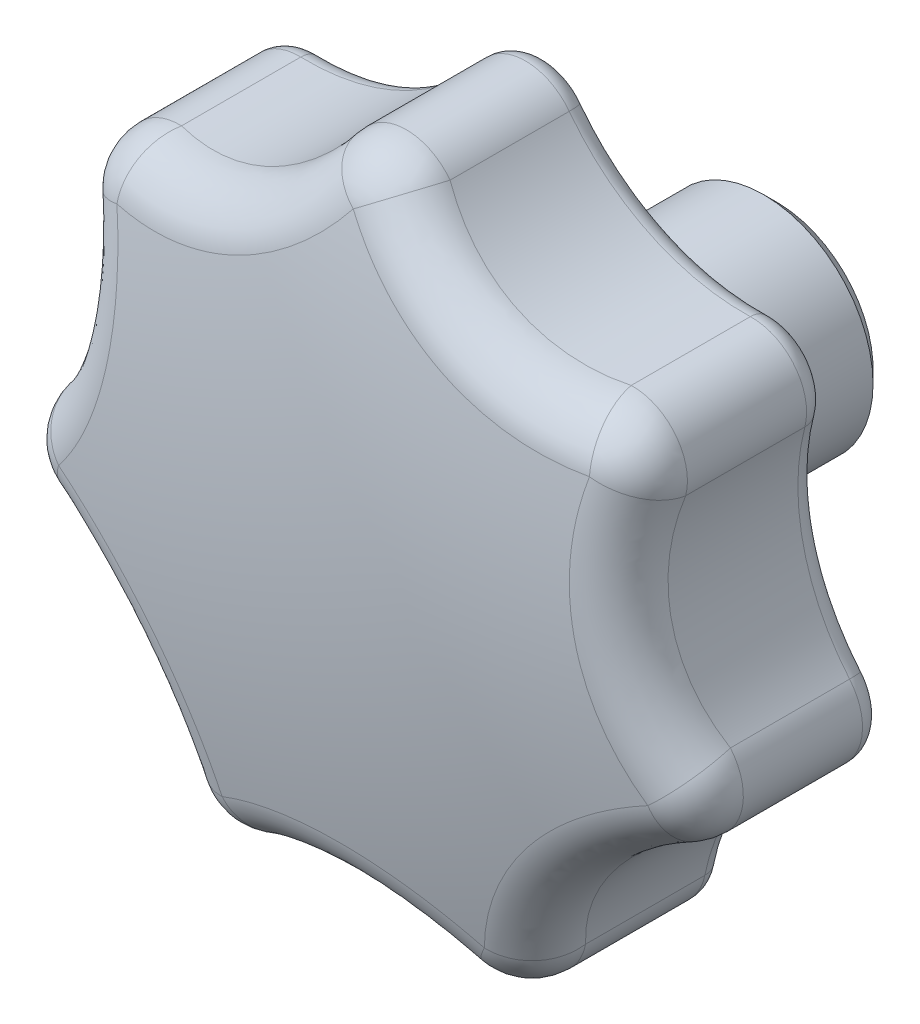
ISO-10303-21;
HEADER;
FILE_DESCRIPTION(('STEP AP214'),'2;1');
FILE_NAME('part.step','',(''),(''),'','','');
FILE_SCHEMA(('AUTOMOTIVE_DESIGN { 1 0 10303 214 1 1 1 1 }'));
ENDSEC;
DATA;
#1=APPLICATION_CONTEXT('core data for automotive mechanical design processes');
#2=APPLICATION_PROTOCOL_DEFINITION('international standard','automotive_design',2000,#1);
#3=PRODUCT_CONTEXT('',#1,'mechanical');
#4=PRODUCT('Part','Part','',(#3));
#5=PRODUCT_RELATED_PRODUCT_CATEGORY('part','',(#4));
#6=PRODUCT_DEFINITION_FORMATION('','',#4);
#7=PRODUCT_DEFINITION_CONTEXT('part definition',#1,'design');
#8=PRODUCT_DEFINITION('design','',#6,#7);
#9=PRODUCT_DEFINITION_SHAPE('','',#8);
#10=(LENGTH_UNIT() NAMED_UNIT(*) SI_UNIT(.MILLI.,.METRE.));
#11=(NAMED_UNIT(*) PLANE_ANGLE_UNIT() SI_UNIT($,.RADIAN.));
#12=(NAMED_UNIT(*) SI_UNIT($,.STERADIAN.) SOLID_ANGLE_UNIT());
#13=UNCERTAINTY_MEASURE_WITH_UNIT(LENGTH_MEASURE(1.E-05),#10,'distance_accuracy_value','');
#14=(GEOMETRIC_REPRESENTATION_CONTEXT(3) GLOBAL_UNCERTAINTY_ASSIGNED_CONTEXT((#13)) GLOBAL_UNIT_ASSIGNED_CONTEXT((#10,
#11,#12)) REPRESENTATION_CONTEXT('',''));
#15=CARTESIAN_POINT('',(0.,0.,0.));
#16=DIRECTION('',(0.,0.,1.));
#17=DIRECTION('',(1.,0.,0.));
#18=AXIS2_PLACEMENT_3D('',#15,#16,#17);
#19=CARTESIAN_POINT('',(-9.99553715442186,34.0059467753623,21.));
#20=DIRECTION('',(0.,0.,1.));
#21=DIRECTION('',(1.,0.,0.));
#22=AXIS2_PLACEMENT_3D('',#19,#20,#21);
#23=PLANE('',#22);
#24=CARTESIAN_POINT('',(-20.7185342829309,16.5224797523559,21.));
#25=DIRECTION('',(0.,0.,1.));
#26=DIRECTION('',(1.,0.,0.));
#27=AXIS2_PLACEMENT_3D('',#24,#25,#26);
#28=CIRCLE('',#27,2.99999999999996);
#29=CARTESIAN_POINT('',(-23.622654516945,15.7700931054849,21.));
#30=VERTEX_POINT('',#29);
#31=CARTESIAN_POINT('',(-20.6312390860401,19.5212094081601,21.));
#32=VERTEX_POINT('',#31);
#33=EDGE_CURVE('E515',#30,#32,#28,.F.);
#34=ORIENTED_EDGE('',*,*,#33,.T.);
#35=CARTESIAN_POINT('',(-19.9910743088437,41.5118935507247,21.));
#36=DIRECTION('',(0.,0.,1.));
#37=DIRECTION('',(1.,0.,0.));
#38=AXIS2_PLACEMENT_3D('',#35,#36,#37);
#39=CIRCLE('',#38,22.);
#40=CARTESIAN_POINT('',(-2.39892891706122,28.3014272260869,21.));
#41=VERTEX_POINT('',#40);
#42=EDGE_CURVE('E517',#32,#41,#39,.T.);
#43=ORIENTED_EDGE('',*,*,#42,.T.);
#44=CARTESIAN_POINT('',(0.,26.5,21.));
#45=DIRECTION('',(0.,0.,1.));
#46=DIRECTION('',(1.,0.,0.));
#47=AXIS2_PLACEMENT_3D('',#44,#45,#46);
#48=CIRCLE('',#47,2.99999999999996);
#49=CARTESIAN_POINT('',(2.39892891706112,28.301427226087,21.));
#50=VERTEX_POINT('',#49);
#51=EDGE_CURVE('E757',#41,#50,#48,.F.);
#52=ORIENTED_EDGE('',*,*,#51,.T.);
#53=CARTESIAN_POINT('',(19.9910743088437,41.5118935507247,21.));
#54=DIRECTION('',(0.,0.,1.));
#55=DIRECTION('',(1.,0.,0.));
#56=AXIS2_PLACEMENT_3D('',#53,#54,#55);
#57=CIRCLE('',#56,22.);
#58=CARTESIAN_POINT('',(20.6312390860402,19.5212094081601,21.));
#59=VERTEX_POINT('',#58);
#60=EDGE_CURVE('E761',#50,#59,#57,.T.);
#61=ORIENTED_EDGE('',*,*,#60,.T.);
#62=CARTESIAN_POINT('',(20.7185342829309,16.5224797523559,21.));
#63=DIRECTION('',(0.,0.,1.));
#64=DIRECTION('',(1.,0.,0.));
#65=AXIS2_PLACEMENT_3D('',#62,#63,#64);
#66=CIRCLE('',#65,2.99999999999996);
#67=CARTESIAN_POINT('',(23.622654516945,15.7700931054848,21.));
#68=VERTEX_POINT('',#67);
#69=EDGE_CURVE('E763',#59,#68,#66,.F.);
#70=ORIENTED_EDGE('',*,*,#69,.T.);
#71=CARTESIAN_POINT('',(44.9195362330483,10.2525910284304,21.));
#72=DIRECTION('',(0.,0.,1.));
#73=DIRECTION('',(1.,0.,0.));
#74=AXIS2_PLACEMENT_3D('',#71,#72,#73);
#75=CIRCLE('',#74,22.);
#76=CARTESIAN_POINT('',(28.1256632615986,-3.95887724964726,21.));
#77=VERTEX_POINT('',#76);
#78=EDGE_CURVE('E765',#68,#77,#75,.T.);
#79=ORIENTED_EDGE('',*,*,#78,.T.);
#80=CARTESIAN_POINT('',(25.8355896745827,-5.89680474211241,21.));
#81=DIRECTION('',(0.,0.,1.));
#82=DIRECTION('',(1.,0.,0.));
#83=AXIS2_PLACEMENT_3D('',#80,#81,#82);
#84=CIRCLE('',#83,3.);
#85=CARTESIAN_POINT('',(27.0580394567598,-8.6364427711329,21.));
#86=VERTEX_POINT('',#85);
#87=EDGE_CURVE('E767',#77,#86,#84,.F.);
#88=ORIENTED_EDGE('',*,*,#87,.T.);
#89=CARTESIAN_POINT('',(36.0226711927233,-28.7271216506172,21.));
#90=DIRECTION('',(0.,0.,1.));
#91=DIRECTION('',(1.,0.,0.));
#92=AXIS2_PLACEMENT_3D('',#89,#90,#91);
#93=CIRCLE('',#92,22.);
#94=CARTESIAN_POINT('',(14.4408893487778,-24.4578485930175,21.));
#95=VERTEX_POINT('',#94);
#96=EDGE_CURVE('E506',#86,#95,#93,.T.);
#97=ORIENTED_EDGE('',*,*,#96,.T.);
#98=CARTESIAN_POINT('',(11.4979190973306,-23.8756749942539,21.));
#99=DIRECTION('',(0.,0.,1.));
#100=DIRECTION('',(1.,0.,0.));
#101=AXIS2_PLACEMENT_3D('',#98,#99,#100);
#102=CIRCLE('',#101,3.00000000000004);
#103=CARTESIAN_POINT('',(10.118168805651,-26.5395610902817,21.));
#104=VERTEX_POINT('',#103);
#105=EDGE_CURVE('E490',#95,#104,#102,.F.);
#106=ORIENTED_EDGE('',*,*,#105,.T.);
#107=CARTESIAN_POINT('',(0.,-46.074725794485,21.));
#108=DIRECTION('',(0.,0.,1.));
#109=DIRECTION('',(1.,0.,0.));
#110=AXIS2_PLACEMENT_3D('',#107,#108,#109);
#111=CIRCLE('',#110,22.);
#112=CARTESIAN_POINT('',(-10.1181688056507,-26.5395610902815,21.));
#113=VERTEX_POINT('',#112);
#114=EDGE_CURVE('E498',#104,#113,#111,.T.);
#115=ORIENTED_EDGE('',*,*,#114,.T.);
#116=CARTESIAN_POINT('',(-11.4979190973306,-23.8756749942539,21.));
#117=DIRECTION('',(0.,0.,1.));
#118=DIRECTION('',(1.,0.,0.));
#119=AXIS2_PLACEMENT_3D('',#116,#117,#118);
#120=CIRCLE('',#119,3.00000000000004);
#121=CARTESIAN_POINT('',(-14.4408893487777,-24.4578485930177,21.));
#122=VERTEX_POINT('',#121);
#123=EDGE_CURVE('E502',#113,#122,#120,.F.);
#124=ORIENTED_EDGE('',*,*,#123,.T.);
#125=CARTESIAN_POINT('',(-36.0226711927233,-28.7271216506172,21.));
#126=DIRECTION('',(0.,0.,1.));
#127=DIRECTION('',(1.,0.,0.));
#128=AXIS2_PLACEMENT_3D('',#125,#126,#127);
#129=CIRCLE('',#128,22.);
#130=CARTESIAN_POINT('',(-27.0580394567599,-8.63644277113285,21.));
#131=VERTEX_POINT('',#130);
#132=EDGE_CURVE('E504',#122,#131,#129,.T.);
#133=ORIENTED_EDGE('',*,*,#132,.T.);
#134=CARTESIAN_POINT('',(-25.8355896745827,-5.89680474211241,21.));
#135=DIRECTION('',(0.,0.,1.));
#136=DIRECTION('',(1.,0.,0.));
#137=AXIS2_PLACEMENT_3D('',#134,#135,#136);
#138=CIRCLE('',#137,3.);
#139=CARTESIAN_POINT('',(-28.1256632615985,-3.95887724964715,21.));
#140=VERTEX_POINT('',#139);
#141=EDGE_CURVE('E511',#131,#140,#138,.F.);
#142=ORIENTED_EDGE('',*,*,#141,.T.);
#143=CARTESIAN_POINT('',(-44.9195362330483,10.2525910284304,21.));
#144=DIRECTION('',(0.,0.,1.));
#145=DIRECTION('',(1.,0.,0.));
#146=AXIS2_PLACEMENT_3D('',#143,#144,#145);
#147=CIRCLE('',#146,22.);
#148=EDGE_CURVE('E513',#140,#30,#147,.T.);
#149=ORIENTED_EDGE('',*,*,#148,.T.);
#150=EDGE_LOOP('',(#34,#43,#52,#61,#70,#79,#88,#97,#106,#115,#124,#133,#142,#149));
#151=FACE_BOUND('',#150,.T.);
#152=CARTESIAN_POINT('',(0.,0.,21.));
#153=DIRECTION('',(0.,0.,1.));
#154=DIRECTION('',(1.,0.,0.));
#155=AXIS2_PLACEMENT_3D('',#152,#153,#154);
#156=CIRCLE('',#155,11.);
#157=CARTESIAN_POINT('',(11.,0.,21.));
#158=VERTEX_POINT('',#157);
#159=EDGE_CURVE('E751',#158,#158,#156,.T.);
#160=ORIENTED_EDGE('',*,*,#159,.T.);
#161=EDGE_LOOP('',(#160));
#162=FACE_BOUND('',#161,.T.);
#163=ADVANCED_FACE('F14',(#151,#162),#23,.F.);
#164=CARTESIAN_POINT('',(0.,26.5,42.));
#165=DIRECTION('',(0.,0.,-1.));
#166=DIRECTION('',(-1.,0.,0.));
#167=AXIS2_PLACEMENT_3D('',#164,#165,#166);
#168=CYLINDRICAL_SURFACE('',#167,5.);
#169=DIRECTION('',(0.,0.,-1.));
#170=VECTOR('',#169,1.);
#171=CARTESIAN_POINT('',(3.99821486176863,29.5023787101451,42.));
#172=LINE('',#171,#170);
#173=CARTESIAN_POINT('',(3.99821486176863,29.5023787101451,33.9050937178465));
#174=VERTEX_POINT('',#173);
#175=CARTESIAN_POINT('',(3.99821486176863,29.5023787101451,23.));
#176=VERTEX_POINT('',#175);
#177=EDGE_CURVE('E850',#174,#176,#172,.T.);
#178=ORIENTED_EDGE('',*,*,#177,.T.);
#179=CARTESIAN_POINT('',(0.,26.5,23.));
#180=DIRECTION('',(0.,0.,1.));
#181=DIRECTION('',(1.,0.,0.));
#182=AXIS2_PLACEMENT_3D('',#179,#180,#181);
#183=CIRCLE('',#182,5.);
#184=CARTESIAN_POINT('',(-3.99821486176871,29.5023787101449,23.));
#185=VERTEX_POINT('',#184);
#186=EDGE_CURVE('E541',#176,#185,#183,.T.);
#187=ORIENTED_EDGE('',*,*,#186,.T.);
#188=DIRECTION('',(0.,0.,-1.));
#189=VECTOR('',#188,1.);
#190=CARTESIAN_POINT('',(-3.99821486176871,29.5023787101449,42.));
#191=LINE('',#190,#189);
#192=CARTESIAN_POINT('',(-3.99821486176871,29.5023787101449,33.9050937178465));
#193=VERTEX_POINT('',#192);
#194=EDGE_CURVE('E595',#193,#185,#191,.T.);
#195=ORIENTED_EDGE('',*,*,#194,.F.);
#196=CARTESIAN_POINT('',(0.,26.5,33.9050937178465));
#197=DIRECTION('',(0.,0.,-1.));
#198=DIRECTION('',(-1.,0.,0.));
#199=AXIS2_PLACEMENT_3D('',#196,#197,#198);
#200=CIRCLE('',#199,5.);
#201=EDGE_CURVE('E675',#193,#174,#200,.T.);
#202=ORIENTED_EDGE('',*,*,#201,.T.);
#203=EDGE_LOOP('',(#178,#187,#195,#202));
#204=FACE_BOUND('',#203,.T.);
#205=ADVANCED_FACE('F201',(#204),#168,.T.);
#206=CARTESIAN_POINT('',(-19.9910743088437,41.5118935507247,42.));
#207=DIRECTION('',(0.,0.,-1.));
#208=DIRECTION('',(-1.,0.,0.));
#209=AXIS2_PLACEMENT_3D('',#206,#207,#208);
#210=CYLINDRICAL_SURFACE('',#209,20.);
#211=ORIENTED_EDGE('',*,*,#194,.T.);
#212=CARTESIAN_POINT('',(-19.9910743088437,41.5118935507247,23.));
#213=DIRECTION('',(0.,0.,1.));
#214=DIRECTION('',(1.,0.,0.));
#215=AXIS2_PLACEMENT_3D('',#212,#213,#214);
#216=CIRCLE('',#215,20.);
#217=CARTESIAN_POINT('',(-20.5730422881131,21.5203625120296,23.));
#218=VERTEX_POINT('',#217);
#219=EDGE_CURVE('E754',#185,#218,#216,.F.);
#220=ORIENTED_EDGE('',*,*,#219,.T.);
#221=DIRECTION('',(0.,0.,-1.));
#222=VECTOR('',#221,1.);
#223=CARTESIAN_POINT('',(-20.5730422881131,21.5203625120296,42.));
#224=LINE('',#223,#222);
#225=CARTESIAN_POINT('',(-20.5730422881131,21.5203625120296,33.9050937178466));
#226=VERTEX_POINT('',#225);
#227=EDGE_CURVE('E601',#226,#218,#224,.T.);
#228=ORIENTED_EDGE('',*,*,#227,.F.);
#229=CARTESIAN_POINT('',(-30.1819992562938,18.9521464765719,36.5856145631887));
#230=CARTESIAN_POINT('',(-28.4241615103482,23.3245315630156,36.3254507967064));
#231=CARTESIAN_POINT('',(-27.1377476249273,22.8323576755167,31.8112139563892));
#232=CARTESIAN_POINT('',(-29.5090858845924,18.6946042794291,36.8054777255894));
#233=CARTESIAN_POINT('',(-27.8806923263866,23.0758759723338,36.5097638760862));
#234=CARTESIAN_POINT('',(-26.6218473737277,22.6349086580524,32.0219161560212));
#235=CARTESIAN_POINT('',(-28.8229318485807,18.4641352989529,37.0168817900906));
#236=CARTESIAN_POINT('',(-27.3216759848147,22.84965625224,36.6882566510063));
#237=CARTESIAN_POINT('',(-26.0957959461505,22.458215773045,32.224511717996));
#238=CARTESIAN_POINT('',(-27.4285556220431,18.0598248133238,37.4213322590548));
#239=CARTESIAN_POINT('',(-26.1816539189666,22.4474335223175,37.0302787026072));
#240=CARTESIAN_POINT('',(-25.0267741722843,22.1482444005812,32.6121100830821));
#241=CARTESIAN_POINT('',(-26.7203243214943,17.8860070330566,37.6143709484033));
#242=CARTESIAN_POINT('',(-25.6004107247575,22.2709740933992,37.1940178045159));
#243=CARTESIAN_POINT('',(-24.4837968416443,22.0149841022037,32.7971054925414));
#244=CARTESIAN_POINT('',(-25.2863334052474,17.5976104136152,37.9805781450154));
#245=CARTESIAN_POINT('',(-24.4202349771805,21.9709356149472,37.5050134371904));
#246=CARTESIAN_POINT('',(-23.3844038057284,21.7938800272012,33.148054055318));
#247=CARTESIAN_POINT('',(-24.5605632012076,17.4830683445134,38.1537342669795));
#248=CARTESIAN_POINT('',(-23.8209854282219,21.8469606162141,37.652469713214));
#249=CARTESIAN_POINT('',(-22.827979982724,21.7060644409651,33.313995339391));
#250=CARTESIAN_POINT('',(-23.0973251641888,17.3154734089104,38.4785660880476));
#251=CARTESIAN_POINT('',(-22.6103499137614,21.6541363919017,37.9293260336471));
#252=CARTESIAN_POINT('',(-21.7061641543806,21.5775749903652,33.6252925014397));
#253=CARTESIAN_POINT('',(-22.359859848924,17.2624074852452,38.6302463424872));
#254=CARTESIAN_POINT('',(-21.9985926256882,21.5849105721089,38.0589268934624));
#255=CARTESIAN_POINT('',(-21.1407740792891,21.5368911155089,33.7706527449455));
#256=CARTESIAN_POINT('',(-20.9416600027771,17.2211188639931,38.8989142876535));
#257=CARTESIAN_POINT('',(-20.8202832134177,21.5065592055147,38.2886530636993));
#258=CARTESIAN_POINT('',(-20.0534875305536,21.5052365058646,34.028126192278));
#259=CARTESIAN_POINT('',(-20.2614218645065,17.2277757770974,39.0177536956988));
#260=CARTESIAN_POINT('',(-20.2541612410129,21.4926125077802,38.3904496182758));
#261=CARTESIAN_POINT('',(-19.5319716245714,21.5103401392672,34.1420139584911));
#262=CARTESIAN_POINT('',(-18.9003884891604,17.2946071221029,39.2354377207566));
#263=CARTESIAN_POINT('',(-19.1205862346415,21.5128724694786,38.5769710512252));
#264=CARTESIAN_POINT('',(-18.4885127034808,21.5615775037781,34.3506278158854));
#265=CARTESIAN_POINT('',(-18.2195932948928,17.3547777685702,39.3342837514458));
#266=CARTESIAN_POINT('',(-18.5527665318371,21.5469126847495,38.661818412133));
#267=CARTESIAN_POINT('',(-17.966569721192,21.6077083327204,34.4453552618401));
#268=CARTESIAN_POINT('',(-16.8627609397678,17.5288388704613,39.5111158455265));
#269=CARTESIAN_POINT('',(-17.4207943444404,21.6633716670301,38.8136164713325));
#270=CARTESIAN_POINT('',(-16.926331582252,21.7411551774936,34.6148193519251));
#271=CARTESIAN_POINT('',(-16.1867202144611,17.642683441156,39.5891196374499));
#272=CARTESIAN_POINT('',(-16.8562504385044,21.7456506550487,38.8806839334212));
#273=CARTESIAN_POINT('',(-16.4080336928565,21.8284360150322,34.6895729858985));
#274=CARTESIAN_POINT('',(-14.8436686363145,17.9238318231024,39.7237316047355));
#275=CARTESIAN_POINT('',(-15.7349590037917,21.9583162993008,38.9964035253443));
#276=CARTESIAN_POINT('',(-15.3783608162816,22.0439831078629,34.8185761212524));
#277=CARTESIAN_POINT('',(-14.1766578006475,18.0911357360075,39.7803397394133));
#278=CARTESIAN_POINT('',(-15.1778088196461,22.0886725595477,39.0451351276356));
#279=CARTESIAN_POINT('',(-14.8669858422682,22.1722494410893,34.8728255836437));
#280=CARTESIAN_POINT('',(-12.8555647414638,18.4787055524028,39.8717462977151));
#281=CARTESIAN_POINT('',(-14.0751084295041,22.3969532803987,39.1237928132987));
#282=CARTESIAN_POINT('',(-13.8541478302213,22.4693863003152,34.960423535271));
#283=CARTESIAN_POINT('',(-12.2015035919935,18.6990511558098,39.9065116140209));
#284=CARTESIAN_POINT('',(-13.5291707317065,22.57498864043,39.1537456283));
#285=CARTESIAN_POINT('',(-13.3527009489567,22.6383179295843,34.9937402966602));
#286=CARTESIAN_POINT('',(-10.9122113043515,19.1912135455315,39.9537945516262));
#287=CARTESIAN_POINT('',(-12.454349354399,22.9772147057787,39.1944589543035));
#288=CARTESIAN_POINT('',(-12.364243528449,23.0156424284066,35.0390531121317));
#289=CARTESIAN_POINT('',(-10.2769800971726,19.4630301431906,39.9663122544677));
#290=CARTESIAN_POINT('',(-11.925071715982,23.2015130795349,39.2052484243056));
#291=CARTESIAN_POINT('',(-11.8772329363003,23.2240351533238,35.0510492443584));
#292=CARTESIAN_POINT('',(-9.03001824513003,20.0562425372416,39.9689901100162));
#293=CARTESIAN_POINT('',(-10.8879598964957,23.6944221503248,39.2075547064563));
#294=CARTESIAN_POINT('',(-10.9212288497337,23.6788313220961,35.0536155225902));
#295=CARTESIAN_POINT('',(-8.41828869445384,20.3776406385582,39.9591492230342));
#296=CARTESIAN_POINT('',(-10.3797565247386,23.9632085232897,39.1990722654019));
#297=CARTESIAN_POINT('',(-10.4522361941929,23.9252365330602,35.0441846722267));
#298=CARTESIAN_POINT('',(-7.22281518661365,21.0675797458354,39.9171946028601));
#299=CARTESIAN_POINT('',(-9.3889818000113,24.542729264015,39.1629452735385));
#300=CARTESIAN_POINT('',(-9.5357065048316,24.4541898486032,35.0039781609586));
#301=CARTESIAN_POINT('',(-6.63907175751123,21.4361216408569,39.8850804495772));
#302=CARTESIAN_POINT('',(-8.90607603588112,24.8536984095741,39.1352747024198));
#303=CARTESIAN_POINT('',(-9.08816987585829,24.7367386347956,34.9732020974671));
#304=CARTESIAN_POINT('',(-5.48765587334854,22.2284990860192,39.7976379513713));
#305=CARTESIAN_POINT('',(-7.95648551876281,25.5241377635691,39.0600193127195));
#306=CARTESIAN_POINT('',(-8.20541769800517,25.344228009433,34.8894030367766));
#307=CARTESIAN_POINT('',(-4.9209036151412,22.6536027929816,39.7416792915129));
#308=CARTESIAN_POINT('',(-7.49035353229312,25.8850247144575,39.0118393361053));
#309=CARTESIAN_POINT('',(-7.77090763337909,25.6701408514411,34.835775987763));
#310=CARTESIAN_POINT('',(-3.82542024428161,23.5469979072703,39.6070116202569));
#311=CARTESIAN_POINT('',(-6.59300881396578,26.6446945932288,38.8960594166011));
#312=CARTESIAN_POINT('',(-6.93103704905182,26.3550771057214,34.7067194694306));
#313=CARTESIAN_POINT('',(-3.29669015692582,24.0152904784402,39.5283019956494));
#314=CARTESIAN_POINT('',(-6.16154312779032,27.0438394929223,38.8283744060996));
#315=CARTESIAN_POINT('',(-6.52567731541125,26.7141014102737,34.6312894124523));
#316=CARTESIAN_POINT('',(-2.28032838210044,24.9915638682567,39.3487405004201));
#317=CARTESIAN_POINT('',(-5.33639203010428,27.8765884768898,38.6742182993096));
#318=CARTESIAN_POINT('',(-5.74646662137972,27.4625776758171,34.459209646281));
#319=CARTESIAN_POINT('',(-1.79273679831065,25.499582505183,39.2478673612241));
#320=CARTESIAN_POINT('',(-4.94255834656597,28.3106234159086,38.5876193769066));
#321=CARTESIAN_POINT('',(-5.37264640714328,27.8520586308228,34.3625395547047));
#322=CARTESIAN_POINT('',(-0.862232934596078,26.55068245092,39.0248819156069));
#323=CARTESIAN_POINT('',(-4.19586182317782,29.208725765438,38.3965436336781));
#324=CARTESIAN_POINT('',(-4.65926011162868,28.6579019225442,34.1488451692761));
#325=CARTESIAN_POINT('',(-0.419323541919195,27.0937660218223,38.9027682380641));
#326=CARTESIAN_POINT('',(-3.84288880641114,29.6732191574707,38.2919336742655));
#327=CARTESIAN_POINT('',(-4.31969624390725,29.0742659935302,34.0318195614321));
#328=CARTESIAN_POINT('',(0.444938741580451,28.2446932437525,38.630219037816));
#329=CARTESIAN_POINT('',(-3.15979439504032,30.6572634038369,38.0589034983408));
#330=CARTESIAN_POINT('',(-3.65709515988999,29.9566435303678,33.7706265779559));
#331=CARTESIAN_POINT('',(0.863322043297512,28.8544663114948,38.4785091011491));
#332=CARTESIAN_POINT('',(-2.83243923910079,31.1788131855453,37.9292772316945));
#333=CARTESIAN_POINT('',(-3.33633462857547,30.4241362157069,33.6252378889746));
#334=CARTESIAN_POINT('',(1.64471711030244,30.1031898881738,38.1536136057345));
#335=CARTESIAN_POINT('',(-2.22829295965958,32.2457413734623,37.6523668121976));
#336=CARTESIAN_POINT('',(-2.73726507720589,31.3814909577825,33.3138797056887));
#337=CARTESIAN_POINT('',(2.00771861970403,30.7421457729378,37.9804240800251));
#338=CARTESIAN_POINT('',(-1.95156333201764,32.7916446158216,37.5048821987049));
#339=CARTESIAN_POINT('',(-2.45896391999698,31.8713571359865,33.1479064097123));
#340=CARTESIAN_POINT('',(2.67627221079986,32.0430973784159,37.6142077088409));
#341=CARTESIAN_POINT('',(-1.45035778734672,33.9014121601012,37.1938795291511));
#342=CARTESIAN_POINT('',(-1.94640616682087,32.8687533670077,32.7969490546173));
#343=CARTESIAN_POINT('',(2.98187933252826,32.7050702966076,37.4212001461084));
#344=CARTESIAN_POINT('',(-1.22597531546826,34.4657657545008,37.0301670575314));
#345=CARTESIAN_POINT('',(-1.71210737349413,33.3762659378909,32.6119834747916));
#346=CARTESIAN_POINT('',(3.53504111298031,34.0470938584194,37.0168139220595));
#347=CARTESIAN_POINT('',(-0.829739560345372,35.6076589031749,36.6881995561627));
#348=CARTESIAN_POINT('',(-1.2880166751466,34.4051506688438,32.2244466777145));
#349=CARTESIAN_POINT('',(3.78261853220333,34.7271372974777,36.8054425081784));
#350=CARTESIAN_POINT('',(-0.658096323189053,36.18566869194,36.5097344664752));
#351=CARTESIAN_POINT('',(-1.09820732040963,34.9265173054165,32.0218824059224));
#352=CARTESIAN_POINT('',(4.00078396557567,35.4137072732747,36.5856145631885));
#353=CARTESIAN_POINT('',(-0.513678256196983,36.765511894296,36.3254507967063));
#354=CARTESIAN_POINT('',(-0.930947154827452,35.4528876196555,31.8112139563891));
#355=(BOUNDED_SURFACE() B_SPLINE_SURFACE(3,2,((#229,#230,#231),(#232,#233,#234),(#235,#236,
#237),(#238,#239,#240),(#241,#242,#243),(#244,#245,#246),(#247,#248,#249),(#250,#251,#252),
(#253,#254,#255),(#256,#257,#258),(#259,#260,#261),(#262,#263,#264),(#265,#266,#267),(#268,#269,
#270),(#271,#272,#273),(#274,#275,#276),(#277,#278,#279),(#280,#281,#282),(#283,#284,#285),
(#286,#287,#288),(#289,#290,#291),(#292,#293,#294),(#295,#296,#297),(#298,#299,#300),(#301,#302,
#303),(#304,#305,#306),(#307,#308,#309),(#310,#311,#312),(#313,#314,#315),(#316,#317,#318),
(#319,#320,#321),(#322,#323,#324),(#325,#326,#327),(#328,#329,#330),(#331,#332,#333),(#334,#335,
#336),(#337,#338,#339),(#340,#341,#342),(#343,#344,#345),(#346,#347,#348),(#349,#350,#351),
(#352,#353,#354)),.UNSPECIFIED.,.F.,.F.,.F.) B_SPLINE_SURFACE_WITH_KNOTS((4,2,2,2,2,2,2,2,2,2,2,
2,2,2,2,2,2,2,2,2,4),(3,3),(0.,2.16530698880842,4.33151962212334,6.49907440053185,
8.66616871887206,10.6493660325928,12.6324230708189,14.6137878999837,16.5951564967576,
18.5795210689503,20.5638783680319,22.5483279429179,24.5328149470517,26.5733769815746,
28.6139940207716,30.6565778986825,32.6992936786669,34.8667927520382,37.034692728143,
39.2005029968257,41.3654623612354),(0.,1.),
.UNSPECIFIED.) GEOMETRIC_REPRESENTATION_ITEM() RATIONAL_B_SPLINE_SURFACE(((1.,0.727197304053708,
1.),(1.,0.729963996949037,1.),(1.,0.732616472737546,1.),(1.,0.737678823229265,1.),(1.,
0.740088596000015,1.),(1.,0.744650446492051,1.),(1.,0.746802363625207,1.),(1.,0.750831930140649,
1.),(1.,0.752709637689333,1.),(1.,0.756030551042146,1.),(1.,0.757497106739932,1.),(1.,
0.760180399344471,1.),(1.,0.761397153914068,1.),(1.,0.763571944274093,1.),(1.,0.764530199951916,
1.),(1.,0.766182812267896,1.),(1.,0.766877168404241,1.),(1.,0.767997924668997,1.),(1.,
0.768423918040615,1.),(1.,0.769003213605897,1.),(1.,0.769156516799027,1.),(1.,0.769189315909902,
1.),(1.,0.769068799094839,1.),(1.,0.768554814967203,1.),(1.,0.768161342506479,1.),(1.,
0.767089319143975,1.),(1.,0.766403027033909,1.),(1.,0.764749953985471,1.),(1.,0.763783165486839,
1.),(1.,0.761575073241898,1.),(1.,0.760333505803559,1.),(1.,0.757585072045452,1.),(1.,
0.756078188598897,1.),(1.,0.752709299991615,1.),(1.,0.750831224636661,1.),(1.,0.746800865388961,
1.),(1.,0.744648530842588,1.),(1.,0.740086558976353,1.),(1.,0.737677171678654,1.),(1.,
0.732615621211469,1.),(1.,0.729963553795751,1.),(1.,0.727197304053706,1.))) REPRESENTATION_ITEM('') SURFACE());
#356=CARTESIAN_POINT('',(-27.1377476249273,22.8323576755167,31.8112139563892));
#357=CARTESIAN_POINT('',(-26.6218473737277,22.6349086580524,32.0219161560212));
#358=CARTESIAN_POINT('',(-26.0957959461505,22.458215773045,32.224511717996));
#359=CARTESIAN_POINT('',(-25.0267741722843,22.1482444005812,32.6121100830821));
#360=CARTESIAN_POINT('',(-24.4837968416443,22.0149841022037,32.7971054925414));
#361=CARTESIAN_POINT('',(-23.3844038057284,21.7938800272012,33.148054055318));
#362=CARTESIAN_POINT('',(-22.827979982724,21.7060644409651,33.313995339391));
#363=CARTESIAN_POINT('',(-21.7061641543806,21.5775749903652,33.6252925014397));
#364=CARTESIAN_POINT('',(-21.1407740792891,21.5368911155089,33.7706527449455));
#365=CARTESIAN_POINT('',(-20.0534875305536,21.5052365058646,34.028126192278));
#366=CARTESIAN_POINT('',(-19.5319716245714,21.5103401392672,34.1420139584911));
#367=CARTESIAN_POINT('',(-18.4885127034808,21.5615775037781,34.3506278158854));
#368=CARTESIAN_POINT('',(-17.966569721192,21.6077083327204,34.4453552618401));
#369=CARTESIAN_POINT('',(-16.926331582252,21.7411551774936,34.6148193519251));
#370=CARTESIAN_POINT('',(-16.4080336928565,21.8284360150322,34.6895729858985));
#371=CARTESIAN_POINT('',(-15.3783608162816,22.0439831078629,34.8185761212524));
#372=CARTESIAN_POINT('',(-14.8669858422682,22.1722494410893,34.8728255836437));
#373=CARTESIAN_POINT('',(-13.8541478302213,22.4693863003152,34.960423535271));
#374=CARTESIAN_POINT('',(-13.3527009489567,22.6383179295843,34.9937402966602));
#375=CARTESIAN_POINT('',(-12.364243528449,23.0156424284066,35.0390531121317));
#376=CARTESIAN_POINT('',(-11.8772329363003,23.2240351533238,35.0510492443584));
#377=CARTESIAN_POINT('',(-10.9212288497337,23.6788313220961,35.0536155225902));
#378=CARTESIAN_POINT('',(-10.4522361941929,23.9252365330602,35.0441846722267));
#379=CARTESIAN_POINT('',(-9.5357065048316,24.4541898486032,35.0039781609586));
#380=CARTESIAN_POINT('',(-9.08816987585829,24.7367386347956,34.9732020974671));
#381=CARTESIAN_POINT('',(-8.20541769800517,25.344228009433,34.8894030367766));
#382=CARTESIAN_POINT('',(-7.77090763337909,25.6701408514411,34.835775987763));
#383=CARTESIAN_POINT('',(-6.93103704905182,26.3550771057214,34.7067194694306));
#384=CARTESIAN_POINT('',(-6.52567731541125,26.7141014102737,34.6312894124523));
#385=CARTESIAN_POINT('',(-5.74646662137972,27.4625776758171,34.459209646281));
#386=CARTESIAN_POINT('',(-5.37264640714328,27.8520586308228,34.3625395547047));
#387=CARTESIAN_POINT('',(-4.65926011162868,28.6579019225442,34.1488451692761));
#388=CARTESIAN_POINT('',(-4.31969624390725,29.0742659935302,34.0318195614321));
#389=CARTESIAN_POINT('',(-3.65709515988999,29.9566435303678,33.7706265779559));
#390=CARTESIAN_POINT('',(-3.33633462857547,30.4241362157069,33.6252378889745));
#391=CARTESIAN_POINT('',(-2.73726507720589,31.3814909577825,33.3138797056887));
#392=CARTESIAN_POINT('',(-2.45896391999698,31.8713571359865,33.1479064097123));
#393=CARTESIAN_POINT('',(-1.94640616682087,32.8687533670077,32.7969490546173));
#394=CARTESIAN_POINT('',(-1.71210737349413,33.3762659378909,32.6119834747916));
#395=CARTESIAN_POINT('',(-1.2880166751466,34.4051506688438,32.2244466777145));
#396=CARTESIAN_POINT('',(-1.09820732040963,34.9265173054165,32.0218824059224));
#397=CARTESIAN_POINT('',(-0.930947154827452,35.4528876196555,31.8112139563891));
#398=B_SPLINE_CURVE_WITH_KNOTS('',3,(#356,#357,#358,#359,#360,#361,#362,#363,#364,#365,#366,
#367,#368,#369,#370,#371,#372,#373,#374,#375,#376,#377,#378,#379,#380,#381,#382,#383,#384,#385,
#386,#387,#388,#389,#390,#391,#392,#393,#394,#395,#396,#397),.UNSPECIFIED.,.F.,.F.,(4,2,2,2,2,2,
2,2,2,2,2,2,2,2,2,2,2,2,2,2,4),(0.,2.16530698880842,4.33151962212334,6.49907440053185,
8.66616871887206,10.6493660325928,12.6324230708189,14.6137878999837,16.5951564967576,
18.5795210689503,20.5638783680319,22.5483279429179,24.5328149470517,26.5733769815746,
28.6139940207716,30.6565778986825,32.6992936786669,34.8667927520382,37.034692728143,
39.2005029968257,41.3654623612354),.UNSPECIFIED.);
#399=EDGE_CURVE('E743',#226,#193,#398,.T.);
#400=ORIENTED_EDGE('',*,*,#399,.T.);
#401=EDGE_LOOP('',(#211,#220,#228,#400));
#402=FACE_BOUND('',#401,.T.);
#403=ADVANCED_FACE('F206',(#402),#210,.F.);
#404=CARTESIAN_POINT('',(-20.7185342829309,16.5224797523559,42.));
#405=DIRECTION('',(0.,0.,-1.));
#406=DIRECTION('',(-1.,0.,0.));
#407=AXIS2_PLACEMENT_3D('',#404,#405,#406);
#408=CYLINDRICAL_SURFACE('',#407,5.);
#409=ORIENTED_EDGE('',*,*,#227,.T.);
#410=CARTESIAN_POINT('',(-20.7185342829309,16.5224797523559,23.));
#411=DIRECTION('',(0.,0.,1.));
#412=DIRECTION('',(1.,0.,0.));
#413=AXIS2_PLACEMENT_3D('',#410,#411,#412);
#414=CIRCLE('',#413,5.);
#415=CARTESIAN_POINT('',(-25.5587346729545,15.268502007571,23.));
#416=VERTEX_POINT('',#415);
#417=EDGE_CURVE('E520',#218,#416,#414,.T.);
#418=ORIENTED_EDGE('',*,*,#417,.T.);
#419=DIRECTION('',(0.,0.,-1.));
#420=VECTOR('',#419,1.);
#421=CARTESIAN_POINT('',(-25.5587346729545,15.268502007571,42.));
#422=LINE('',#421,#420);
#423=CARTESIAN_POINT('',(-25.5587346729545,15.268502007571,33.9050937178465));
#424=VERTEX_POINT('',#423);
#425=EDGE_CURVE('E806',#424,#416,#422,.T.);
#426=ORIENTED_EDGE('',*,*,#425,.F.);
#427=CARTESIAN_POINT('',(-20.7185342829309,16.5224797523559,33.9050937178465));
#428=DIRECTION('',(0.,0.,-1.));
#429=DIRECTION('',(-1.,0.,0.));
#430=AXIS2_PLACEMENT_3D('',#427,#428,#429);
#431=CIRCLE('',#430,5.);
#432=EDGE_CURVE('E687',#424,#226,#431,.T.);
#433=ORIENTED_EDGE('',*,*,#432,.T.);
#434=EDGE_LOOP('',(#409,#418,#426,#433));
#435=FACE_BOUND('',#434,.T.);
#436=ADVANCED_FACE('F811',(#435),#408,.T.);
#437=CARTESIAN_POINT('',(-44.9195362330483,10.2525910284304,42.));
#438=DIRECTION('',(0.,0.,-1.));
#439=DIRECTION('',(-1.,0.,0.));
#440=AXIS2_PLACEMENT_3D('',#437,#438,#439);
#441=CYLINDRICAL_SURFACE('',#440,20.);
#442=ORIENTED_EDGE('',*,*,#425,.T.);
#443=CARTESIAN_POINT('',(-44.9195362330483,10.2525910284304,23.));
#444=DIRECTION('',(0.,0.,1.));
#445=DIRECTION('',(1.,0.,0.));
#446=AXIS2_PLACEMENT_3D('',#443,#444,#445);
#447=CIRCLE('',#446,20.);
#448=CARTESIAN_POINT('',(-29.6523789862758,-2.66692558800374,23.));
#449=VERTEX_POINT('',#448);
#450=EDGE_CURVE('E522',#416,#449,#447,.F.);
#451=ORIENTED_EDGE('',*,*,#450,.T.);
#452=DIRECTION('',(0.,0.,-1.));
#453=VECTOR('',#452,1.);
#454=CARTESIAN_POINT('',(-29.6523789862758,-2.66692558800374,42.));
#455=LINE('',#454,#453);
#456=CARTESIAN_POINT('',(-29.6523789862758,-2.66692558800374,33.9050937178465));
#457=VERTEX_POINT('',#456);
#458=EDGE_CURVE('E803',#457,#449,#455,.T.);
#459=ORIENTED_EDGE('',*,*,#458,.F.);
#460=CARTESIAN_POINT('',(-33.6355535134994,-11.7807671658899,36.5856145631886));
#461=CARTESIAN_POINT('',(-35.9580279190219,-7.68029676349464,36.3254507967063));
#462=CARTESIAN_POINT('',(-34.7711649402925,-6.98140328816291,31.8112139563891));
#463=CARTESIAN_POINT('',(-33.0146442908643,-11.4152372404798,36.8054777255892));
#464=CARTESIAN_POINT('',(-35.4247736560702,-7.41042967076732,36.509763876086));
#465=CARTESIAN_POINT('',(-34.2951345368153,-6.70116367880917,32.021916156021));
#466=CARTESIAN_POINT('',(-32.4066463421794,-11.0224754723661,37.0168817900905));
#467=CARTESIAN_POINT('',(-34.8993669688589,-7.11441878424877,36.6882566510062));
#468=CARTESIAN_POINT('',(-33.8290027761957,-6.4000463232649,32.2245117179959));
#469=CARTESIAN_POINT('',(-31.2211643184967,-10.1843917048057,37.4213322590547));
#470=CARTESIAN_POINT('',(-33.8741044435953,-6.47389541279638,37.0302787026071));
#471=CARTESIAN_POINT('',(-32.920133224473,-5.7575154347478,32.612110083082));
#472=CARTESIAN_POINT('',(-30.6436931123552,-9.73904779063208,37.6143709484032));
#473=CARTESIAN_POINT('',(-33.3737437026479,-6.12948183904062,37.1940178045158));
#474=CARTESIAN_POINT('',(-32.4774052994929,-5.41608510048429,32.7971054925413));
#475=CARTESIAN_POINT('',(-29.5241368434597,-8.79772089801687,37.9805781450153));
#476=CARTESIAN_POINT('',(-32.403336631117,-5.39385421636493,37.5050134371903));
#477=CARTESIAN_POINT('',(-31.6190788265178,-4.69440114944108,33.1480540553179));
#478=CARTESIAN_POINT('',(-28.9820739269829,-8.30170671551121,38.1537342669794));
#479=CARTESIAN_POINT('',(-31.9327830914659,-5.00263920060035,37.6524697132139));
#480=CARTESIAN_POINT('',(-31.2034972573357,-4.31412360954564,33.3139953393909));
#481=CARTESIAN_POINT('',(-27.9387289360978,-7.26219488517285,38.4785660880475));
#482=CARTESIAN_POINT('',(-31.0272081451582,-4.17635017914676,37.929326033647));
#483=CARTESIAN_POINT('',(-30.4035994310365,-3.51716453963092,33.6252925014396));
#484=CARTESIAN_POINT('',(-27.4374382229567,-6.71870734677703,38.6302463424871));
#485=CARTESIAN_POINT('',(-30.5916607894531,-3.74122066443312,38.0589268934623));
#486=CARTESIAN_POINT('',(-30.0192765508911,-3.10049076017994,33.7706527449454));
#487=CARTESIAN_POINT('',(-26.5209243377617,-5.6356570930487,38.8989142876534));
#488=CARTESIAN_POINT('',(-29.7957393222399,-2.86883254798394,38.2886530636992));
#489=CARTESIAN_POINT('',(-29.3166159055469,-2.27015223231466,34.0281261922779));
#490=CARTESIAN_POINT('',(-26.1020073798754,-5.09967498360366,39.0177536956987));
#491=CARTESIAN_POINT('',(-29.4318640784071,-2.4349161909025,38.3904496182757));
#492=CARTESIAN_POINT('',(-28.9954462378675,-1.85923261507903,34.1420139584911));
#493=CARTESIAN_POINT('',(-25.3056677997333,-3.99390758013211,39.2354377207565));
#494=CARTESIAN_POINT('',(-28.7409314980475,-1.53601968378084,38.5769710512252));
#495=CARTESIAN_POINT('',(-28.3849192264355,-1.01147760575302,34.3506278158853));
#496=CARTESIAN_POINT('',(-24.9282422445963,-3.42412467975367,39.3342837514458));
#497=CARTESIAN_POINT('',(-28.4135154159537,-1.07085663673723,38.661818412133));
#498=CARTESIAN_POINT('',(-28.0955596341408,-0.574644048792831,34.44535526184));
#499=CARTESIAN_POINT('',(-24.2183575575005,-2.2547851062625,39.5111158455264));
#500=CARTESIAN_POINT('',(-27.798793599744,-0.11323415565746,38.8136164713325));
#501=CARTESIAN_POINT('',(-27.5513147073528,0.321849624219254,34.6148193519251));
#502=CARTESIAN_POINT('',(-23.8858603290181,-1.65525425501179,39.5891196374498));
#503=CARTESIAN_POINT('',(-27.5111345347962,0.379444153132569,38.8806839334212));
#504=CARTESIAN_POINT('',(-27.2964001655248,0.781489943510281,34.6895729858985));
#505=CARTESIAN_POINT('',(-23.2682920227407,-0.429921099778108,39.7237316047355));
#506=CARTESIAN_POINT('',(-26.978289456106,1.3886999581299,38.9964035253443));
#507=CARTESIAN_POINT('',(-26.8229311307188,1.72091202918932,34.8185761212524));
#508=CARTESIAN_POINT('',(-22.9832210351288,0.195881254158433,39.7803397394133));
#509=CARTESIAN_POINT('',(-26.7328286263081,1.90557331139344,39.0451351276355));
#510=CARTESIAN_POINT('',(-26.604376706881,2.20069383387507,34.8728255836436));
#511=CARTESIAN_POINT('',(-22.4625472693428,1.47039922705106,39.8717462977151));
#512=CARTESIAN_POINT('',(-26.2863297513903,2.95990907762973,39.1237928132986));
#513=CARTESIAN_POINT('',(-26.2051934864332,3.17782427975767,34.9604235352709));
#514=CARTESIAN_POINT('',(-22.227019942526,2.11914806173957,39.9065116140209));
#515=CARTESIAN_POINT('',(-26.0851368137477,3.49774358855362,39.1537456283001));
#516=CARTESIAN_POINT('',(-26.0246225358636,3.67519838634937,34.9937402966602));
#517=CARTESIAN_POINT('',(-21.8079474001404,3.43401559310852,39.9537945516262));
#518=CARTESIAN_POINT('',(-25.7294696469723,4.58885662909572,39.1944589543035));
#519=CARTESIAN_POINT('',(-25.7033335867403,4.68326349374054,35.0390531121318));
#520=CARTESIAN_POINT('',(-21.6244019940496,4.10013422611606,39.9663122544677));
#521=CARTESIAN_POINT('',(-25.5748339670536,5.14251029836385,39.2052484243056));
#522=CARTESIAN_POINT('',(-25.5626154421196,5.19395444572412,35.0510492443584));
#523=CARTESIAN_POINT('',(-21.3107261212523,5.44491013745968,39.9689901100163));
#524=CARTESIAN_POINT('',(-25.313577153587,6.26068074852,39.2075547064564));
#525=CARTESIAN_POINT('',(-25.3221306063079,6.22494931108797,35.0536155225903));
#526=CARTESIAN_POINT('',(-21.1805981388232,6.1235679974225,39.9591492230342));
#527=CARTESIAN_POINT('',(-25.2068631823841,6.82559570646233,39.199072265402));
#528=CARTESIAN_POINT('',(-25.2223658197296,6.74525367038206,35.0441846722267));
#529=CARTESIAN_POINT('',(-20.9746487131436,7.48839681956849,39.9171946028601));
#530=CARTESIAN_POINT('',(-25.0422128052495,7.96153985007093,39.1629452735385));
#531=CARTESIAN_POINT('',(-25.0644712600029,7.79162243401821,35.0039781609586));
#532=CARTESIAN_POINT('',(-20.8988282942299,8.1745679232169,39.8850804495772));
#533=CARTESIAN_POINT('',(-24.9842514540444,8.53297687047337,39.1352747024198));
#534=CARTESIAN_POINT('',(-25.0063422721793,8.31768694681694,34.9732020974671));
#535=CARTESIAN_POINT('',(-20.8004378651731,9.56882036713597,39.7976379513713));
#536=CARTESIAN_POINT('',(-24.9163620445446,9.69340873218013,39.0600193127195));
#537=CARTESIAN_POINT('',(-24.9309096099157,9.38661382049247,34.8894030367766));
#538=CARTESIAN_POINT('',(-20.7794330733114,10.2769729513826,39.741679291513));
#539=CARTESIAN_POINT('',(-24.9078862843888,10.2828547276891,39.0118393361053));
#540=CARTESIAN_POINT('',(-24.9148059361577,9.92953080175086,34.835775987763));
#541=CARTESIAN_POINT('',(-20.7948947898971,11.6904790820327,39.6070116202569));
#542=CARTESIAN_POINT('',(-24.9423348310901,11.4580735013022,38.8960594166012));
#543=CARTESIAN_POINT('',(-24.9266599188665,11.0132188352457,34.7067194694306));
#544=CARTESIAN_POINT('',(-20.831362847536,12.3958325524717,39.5283019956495));
#545=CARTESIAN_POINT('',(-24.9853844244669,12.0442697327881,38.8283744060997));
#546=CARTESIAN_POINT('',(-24.9546187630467,11.5539898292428,34.6312894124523));
#547=CARTESIAN_POINT('',(-20.9609529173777,13.7991526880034,39.3487405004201));
#548=CARTESIAN_POINT('',(-25.121980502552,13.2086093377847,38.6742182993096));
#549=CARTESIAN_POINT('',(-25.0539711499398,12.629868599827,34.4592096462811));
#550=CARTESIAN_POINT('',(-21.0541295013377,14.4971115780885,39.2478673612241));
#551=CARTESIAN_POINT('',(-25.2157713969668,13.787137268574,38.5876193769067));
#552=CARTESIAN_POINT('',(-25.1254065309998,13.164970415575,34.3625395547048));
#553=CARTESIAN_POINT('',(-21.2957528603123,15.8799588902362,39.0248819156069));
#554=CARTESIAN_POINT('',(-25.4523784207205,14.9308857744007,38.3965436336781));
#555=CARTESIAN_POINT('',(-25.3106511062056,14.2251533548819,34.1488451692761));
#556=CARTESIAN_POINT('',(-21.444203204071,16.5648464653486,38.9027682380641));
#557=CARTESIAN_POINT('',(-25.5954589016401,15.4964580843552,38.2919336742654));
#558=CARTESIAN_POINT('',(-25.4244630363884,14.7502338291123,34.031819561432));
#559=CARTESIAN_POINT('',(-21.8051756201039,17.9581453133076,38.630219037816));
#560=CARTESIAN_POINT('',(-25.9389132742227,16.6440643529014,38.0589034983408));
#561=CARTESIAN_POINT('',(-25.7012085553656,15.8184296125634,33.7706265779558));
#562=CARTESIAN_POINT('',(-22.0210576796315,18.6654378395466,38.4785091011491));
#563=CARTESIAN_POINT('',(-26.1425747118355,17.2251818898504,37.9292772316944));
#564=CARTESIAN_POINT('',(-25.8667181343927,16.3606872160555,33.6252378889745));
#565=CARTESIAN_POINT('',(-22.510157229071,20.0549235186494,38.1536136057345));
#566=CARTESIAN_POINT('',(-26.6000537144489,18.3627413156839,37.6523668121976));
#567=CARTESIAN_POINT('',(-26.2416944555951,17.4259595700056,33.3138797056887));
#568=CARTESIAN_POINT('',(-22.7833853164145,20.7371120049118,37.980424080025));
#569=CARTESIAN_POINT('',(-26.8543199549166,18.9194623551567,37.5048821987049));
#570=CARTESIAN_POINT('',(-26.4511693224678,17.9489707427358,33.1479064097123));
#571=CARTESIAN_POINT('',(-23.3836738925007,22.0709383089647,37.6142077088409));
#572=CARTESIAN_POINT('',(-27.4094746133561,20.0032493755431,37.1938795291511));
#573=CARTESIAN_POINT('',(-26.9113905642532,18.9715709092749,32.7969490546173));
#574=CARTESIAN_POINT('',(-23.7106822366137,22.7226049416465,37.4212001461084));
#575=CARTESIAN_POINT('',(-27.7108038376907,20.5305473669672,37.0301670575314));
#576=CARTESIAN_POINT('',(-27.1620969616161,19.4711819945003,32.6119834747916));
#577=CARTESIAN_POINT('',(-24.4150277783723,23.9918222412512,37.0168139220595));
#578=CARTESIAN_POINT('',(-28.356522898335,21.5522956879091,36.6881995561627));
#579=CARTESIAN_POINT('',(-27.7020952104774,20.4442485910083,32.2244466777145));
#580=CARTESIAN_POINT('',(-24.7923451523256,24.6093862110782,36.8054425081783));
#581=CARTESIAN_POINT('',(-28.7014113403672,22.0468749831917,36.5097344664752));
#582=CARTESIAN_POINT('',(-27.9913718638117,20.9177143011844,32.0218824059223));
#583=CARTESIAN_POINT('',(-25.1931032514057,25.2080241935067,36.5856145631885));
#584=CARTESIAN_POINT('',(-29.0647078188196,22.5213118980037,36.3254507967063));
#585=CARTESIAN_POINT('',(-28.298619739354,21.3766700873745,31.811213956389));
#586=(BOUNDED_SURFACE() B_SPLINE_SURFACE(3,2,((#460,#461,#462),(#463,#464,#465),(#466,#467,
#468),(#469,#470,#471),(#472,#473,#474),(#475,#476,#477),(#478,#479,#480),(#481,#482,#483),
(#484,#485,#486),(#487,#488,#489),(#490,#491,#492),(#493,#494,#495),(#496,#497,#498),(#499,#500,
#501),(#502,#503,#504),(#505,#506,#507),(#508,#509,#510),(#511,#512,#513),(#514,#515,#516),
(#517,#518,#519),(#520,#521,#522),(#523,#524,#525),(#526,#527,#528),(#529,#530,#531),(#532,#533,
#534),(#535,#536,#537),(#538,#539,#540),(#541,#542,#543),(#544,#545,#546),(#547,#548,#549),
(#550,#551,#552),(#553,#554,#555),(#556,#557,#558),(#559,#560,#561),(#562,#563,#564),(#565,#566,
#567),(#568,#569,#570),(#571,#572,#573),(#574,#575,#576),(#577,#578,#579),(#580,#581,#582),
(#583,#584,#585)),.UNSPECIFIED.,.F.,.F.,.F.) B_SPLINE_SURFACE_WITH_KNOTS((4,2,2,2,2,2,2,2,2,2,2,
2,2,2,2,2,2,2,2,2,4),(3,3),(0.,2.16530698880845,4.33151962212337,6.4990744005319,
8.66616871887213,10.6493660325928,12.632423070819,14.6137878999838,16.5951564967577,
18.5795210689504,20.563878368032,22.548327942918,24.5328149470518,26.5733769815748,
28.6139940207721,30.6565778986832,32.6992936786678,34.8667927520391,37.0346927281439,
39.2005029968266,41.3654623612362),(0.,1.),
.UNSPECIFIED.) GEOMETRIC_REPRESENTATION_ITEM() RATIONAL_B_SPLINE_SURFACE(((1.,0.727197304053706,
1.),(1.,0.729963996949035,1.),(1.,0.732616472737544,1.),(1.,0.737678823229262,1.),(1.,
0.740088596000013,1.),(1.,0.744650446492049,1.),(1.,0.746802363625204,1.),(1.,0.750831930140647,
1.),(1.,0.752709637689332,1.),(1.,0.756030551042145,1.),(1.,0.75749710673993,1.),(1.,
0.760180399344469,1.),(1.,0.761397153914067,1.),(1.,0.763571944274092,1.),(1.,0.764530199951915,
1.),(1.,0.766182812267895,1.),(1.,0.76687716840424,1.),(1.,0.767997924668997,1.),(1.,
0.768423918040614,1.),(1.,0.769003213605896,1.),(1.,0.769156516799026,1.),(1.,0.769189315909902,
1.),(1.,0.769068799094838,1.),(1.,0.768554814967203,1.),(1.,0.76816134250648,1.),(1.,
0.767089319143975,1.),(1.,0.766403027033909,1.),(1.,0.76474995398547,1.),(1.,0.763783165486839,
1.),(1.,0.761575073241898,1.),(1.,0.760333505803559,1.),(1.,0.757585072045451,1.),(1.,
0.756078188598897,1.),(1.,0.752709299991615,1.),(1.,0.75083122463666,1.),(1.,0.74680086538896,
1.),(1.,0.744648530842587,1.),(1.,0.740086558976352,1.),(1.,0.737677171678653,1.),(1.,
0.732615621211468,1.),(1.,0.72996355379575,1.),(1.,0.727197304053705,1.))) REPRESENTATION_ITEM('') SURFACE());
#587=CARTESIAN_POINT('',(-34.7711649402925,-6.98140328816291,31.8112139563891));
#588=CARTESIAN_POINT('',(-34.2951345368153,-6.70116367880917,32.021916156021));
#589=CARTESIAN_POINT('',(-33.8290027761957,-6.40004632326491,32.2245117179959));
#590=CARTESIAN_POINT('',(-32.920133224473,-5.7575154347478,32.612110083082));
#591=CARTESIAN_POINT('',(-32.4774052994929,-5.41608510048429,32.7971054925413));
#592=CARTESIAN_POINT('',(-31.6190788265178,-4.69440114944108,33.1480540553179));
#593=CARTESIAN_POINT('',(-31.2034972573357,-4.31412360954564,33.3139953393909));
#594=CARTESIAN_POINT('',(-30.4035994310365,-3.51716453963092,33.6252925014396));
#595=CARTESIAN_POINT('',(-30.0192765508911,-3.10049076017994,33.7706527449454));
#596=CARTESIAN_POINT('',(-29.3166159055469,-2.27015223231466,34.0281261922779));
#597=CARTESIAN_POINT('',(-28.9954462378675,-1.85923261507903,34.1420139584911));
#598=CARTESIAN_POINT('',(-28.3849192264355,-1.01147760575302,34.3506278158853));
#599=CARTESIAN_POINT('',(-28.0955596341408,-0.57464404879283,34.44535526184));
#600=CARTESIAN_POINT('',(-27.5513147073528,0.321849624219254,34.6148193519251));
#601=CARTESIAN_POINT('',(-27.2964001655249,0.781489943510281,34.6895729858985));
#602=CARTESIAN_POINT('',(-26.8229311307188,1.72091202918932,34.8185761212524));
#603=CARTESIAN_POINT('',(-26.604376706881,2.20069383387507,34.8728255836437));
#604=CARTESIAN_POINT('',(-26.2051934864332,3.17782427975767,34.960423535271));
#605=CARTESIAN_POINT('',(-26.0246225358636,3.67519838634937,34.9937402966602));
#606=CARTESIAN_POINT('',(-25.7033335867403,4.68326349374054,35.0390531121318));
#607=CARTESIAN_POINT('',(-25.5626154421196,5.19395444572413,35.0510492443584));
#608=CARTESIAN_POINT('',(-25.3221306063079,6.22494931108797,35.0536155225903));
#609=CARTESIAN_POINT('',(-25.2223658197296,6.74525367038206,35.0441846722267));
#610=CARTESIAN_POINT('',(-25.0644712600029,7.79162243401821,35.0039781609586));
#611=CARTESIAN_POINT('',(-25.0063422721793,8.31768694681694,34.9732020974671));
#612=CARTESIAN_POINT('',(-24.9309096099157,9.38661382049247,34.8894030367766));
#613=CARTESIAN_POINT('',(-24.9148059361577,9.92953080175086,34.835775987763));
#614=CARTESIAN_POINT('',(-24.9266599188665,11.0132188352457,34.7067194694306));
#615=CARTESIAN_POINT('',(-24.9546187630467,11.5539898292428,34.6312894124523));
#616=CARTESIAN_POINT('',(-25.0539711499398,12.629868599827,34.4592096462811));
#617=CARTESIAN_POINT('',(-25.1254065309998,13.164970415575,34.3625395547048));
#618=CARTESIAN_POINT('',(-25.3106511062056,14.2251533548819,34.1488451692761));
#619=CARTESIAN_POINT('',(-25.4244630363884,14.7502338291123,34.031819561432));
#620=CARTESIAN_POINT('',(-25.7012085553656,15.8184296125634,33.7706265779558));
#621=CARTESIAN_POINT('',(-25.8667181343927,16.3606872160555,33.6252378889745));
#622=CARTESIAN_POINT('',(-26.2416944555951,17.4259595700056,33.3138797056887));
#623=CARTESIAN_POINT('',(-26.4511693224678,17.9489707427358,33.1479064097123));
#624=CARTESIAN_POINT('',(-26.9113905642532,18.9715709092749,32.7969490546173));
#625=CARTESIAN_POINT('',(-27.1620969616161,19.4711819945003,32.6119834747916));
#626=CARTESIAN_POINT('',(-27.7020952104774,20.4442485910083,32.2244466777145));
#627=CARTESIAN_POINT('',(-27.9913718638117,20.9177143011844,32.0218824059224));
#628=CARTESIAN_POINT('',(-28.298619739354,21.3766700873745,31.811213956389));
#629=B_SPLINE_CURVE_WITH_KNOTS('',3,(#587,#588,#589,#590,#591,#592,#593,#594,#595,#596,#597,
#598,#599,#600,#601,#602,#603,#604,#605,#606,#607,#608,#609,#610,#611,#612,#613,#614,#615,#616,
#617,#618,#619,#620,#621,#622,#623,#624,#625,#626,#627,#628),.UNSPECIFIED.,.F.,.F.,(4,2,2,2,2,2,
2,2,2,2,2,2,2,2,2,2,2,2,2,2,4),(0.,2.16530698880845,4.33151962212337,6.4990744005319,
8.66616871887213,10.6493660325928,12.632423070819,14.6137878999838,16.5951564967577,
18.5795210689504,20.563878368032,22.548327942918,24.5328149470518,26.5733769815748,
28.6139940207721,30.6565778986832,32.6992936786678,34.8667927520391,37.0346927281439,
39.2005029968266,41.3654623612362),.UNSPECIFIED.);
#630=EDGE_CURVE('E735',#457,#424,#629,.T.);
#631=ORIENTED_EDGE('',*,*,#630,.T.);
#632=EDGE_LOOP('',(#442,#451,#459,#631));
#633=FACE_BOUND('',#632,.T.);
#634=ADVANCED_FACE('F326',(#633),#441,.F.);
#635=CARTESIAN_POINT('',(-25.8355896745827,-5.89680474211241,42.));
#636=DIRECTION('',(0.,0.,-1.));
#637=DIRECTION('',(-1.,0.,0.));
#638=AXIS2_PLACEMENT_3D('',#635,#636,#637);
#639=CYLINDRICAL_SURFACE('',#638,5.);
#640=ORIENTED_EDGE('',*,*,#458,.T.);
#641=CARTESIAN_POINT('',(-25.8355896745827,-5.89680474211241,23.));
#642=DIRECTION('',(0.,0.,1.));
#643=DIRECTION('',(1.,0.,0.));
#644=AXIS2_PLACEMENT_3D('',#641,#642,#643);
#645=CIRCLE('',#644,5.);
#646=CARTESIAN_POINT('',(-27.8730059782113,-10.4628681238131,23.));
#647=VERTEX_POINT('',#646);
#648=EDGE_CURVE('E524',#449,#647,#645,.T.);
#649=ORIENTED_EDGE('',*,*,#648,.T.);
#650=DIRECTION('',(0.,0.,-1.));
#651=VECTOR('',#650,1.);
#652=CARTESIAN_POINT('',(-27.8730059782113,-10.4628681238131,42.));
#653=LINE('',#652,#651);
#654=CARTESIAN_POINT('',(-27.8730059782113,-10.4628681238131,33.9050937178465));
#655=VERTEX_POINT('',#654);
#656=EDGE_CURVE('E800',#655,#647,#653,.T.);
#657=ORIENTED_EDGE('',*,*,#656,.F.);
#658=CARTESIAN_POINT('',(-25.8355896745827,-5.89680474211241,33.9050937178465));
#659=DIRECTION('',(0.,0.,-1.));
#660=DIRECTION('',(-1.,0.,0.));
#661=AXIS2_PLACEMENT_3D('',#658,#659,#660);
#662=CIRCLE('',#661,5.);
#663=EDGE_CURVE('E733',#655,#457,#662,.T.);
#664=ORIENTED_EDGE('',*,*,#663,.T.);
#665=EDGE_LOOP('',(#640,#649,#657,#664));
#666=FACE_BOUND('',#665,.T.);
#667=ADVANCED_FACE('F829',(#666),#639,.T.);
#668=CARTESIAN_POINT('',(-36.0226711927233,-28.7271216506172,42.));
#669=DIRECTION('',(0.,0.,-1.));
#670=DIRECTION('',(-1.,0.,0.));
#671=AXIS2_PLACEMENT_3D('',#668,#669,#670);
#672=CYLINDRICAL_SURFACE('',#671,20.);
#673=ORIENTED_EDGE('',*,*,#656,.T.);
#674=CARTESIAN_POINT('',(-36.0226711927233,-28.7271216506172,23.));
#675=DIRECTION('',(0.,0.,1.));
#676=DIRECTION('',(1.,0.,0.));
#677=AXIS2_PLACEMENT_3D('',#674,#675,#676);
#678=CIRCLE('',#677,20.);
#679=CARTESIAN_POINT('',(-16.4028695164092,-24.8459643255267,23.));
#680=VERTEX_POINT('',#679);
#681=EDGE_CURVE('E526',#647,#680,#678,.F.);
#682=ORIENTED_EDGE('',*,*,#681,.T.);
#683=DIRECTION('',(0.,0.,-1.));
#684=VECTOR('',#683,1.);
#685=CARTESIAN_POINT('',(-16.4028695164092,-24.8459643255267,42.));
#686=LINE('',#685,#684);
#687=CARTESIAN_POINT('',(-16.4028695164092,-24.8459643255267,33.9050937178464));
#688=VERTEX_POINT('',#687);
#689=EDGE_CURVE('E797',#688,#680,#686,.T.);
#690=ORIENTED_EDGE('',*,*,#689,.F.);
#691=CARTESIAN_POINT('',(-11.760849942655,-33.6425228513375,36.5856145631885));
#692=CARTESIAN_POINT('',(-16.4147659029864,-32.9017049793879,36.3254507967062));
#693=CARTESIAN_POINT('',(-16.2211858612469,-31.5380251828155,31.811213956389));
#694=CARTESIAN_POINT('',(-11.6595021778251,-32.9291722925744,36.8054777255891));
#695=CARTESIAN_POINT('',(-16.2932778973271,-32.3165306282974,36.509763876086));
#696=CARTESIAN_POINT('',(-16.1434859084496,-30.9911230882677,32.0219161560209));
#697=CARTESIAN_POINT('',(-11.5874951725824,-32.2089373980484,37.0168817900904));
#698=CARTESIAN_POINT('',(-16.197122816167,-31.7211913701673,36.6882566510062));
#699=CARTESIAN_POINT('',(-16.0882805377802,-30.4389430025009,32.2245117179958));
#700=CARTESIAN_POINT('',(-11.5035994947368,-30.7595535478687,37.4213322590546));
#701=CARTESIAN_POINT('',(-16.0586634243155,-30.5202490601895,37.030278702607));
#702=CARTESIAN_POINT('',(-16.0239605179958,-29.3277487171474,32.6121100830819));
#703=CARTESIAN_POINT('',(-11.4917359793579,-30.0304009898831,37.6143709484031));
#704=CARTESIAN_POINT('',(-16.0159669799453,-29.9143129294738,37.1940178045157));
#705=CARTESIAN_POINT('',(-16.0148651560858,-28.768731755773,32.7971054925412));
#706=CARTESIAN_POINT('',(-11.5296630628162,-28.5681889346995,37.9805781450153));
#707=CARTESIAN_POINT('',(-15.986064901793,-28.6969618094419,37.5050134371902));
#708=CARTESIAN_POINT('',(-16.0439425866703,-27.6477025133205,33.1480540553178));
#709=CARTESIAN_POINT('',(-11.579491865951,-27.8351272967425,38.1537342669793));
#710=CARTESIAN_POINT('',(-15.9985437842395,-28.0851496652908,37.6524697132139));
#711=CARTESIAN_POINT('',(-16.0821446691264,-27.085688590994,33.3139953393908));
#712=CARTESIAN_POINT('',(-11.7416999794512,-26.3712823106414,38.4785660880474));
#713=CARTESIAN_POINT('',(-16.079945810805,-26.8619598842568,37.929326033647));
#714=CARTESIAN_POINT('',(-16.2065042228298,-25.9634074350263,33.6252925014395));
#715=CARTESIAN_POINT('',(-11.8540659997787,-25.640498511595,38.630246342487));
#716=CARTESIAN_POINT('',(-16.1485844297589,-26.2501364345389,38.0589268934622));
#717=CARTESIAN_POINT('',(-16.292651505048,-25.4031398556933,33.7706527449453));
#718=CARTESIAN_POINT('',(-12.1293917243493,-24.2486683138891,38.8989142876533));
#719=CARTESIAN_POINT('',(-16.3343960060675,-25.0839348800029,38.2886530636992));
#720=CARTESIAN_POINT('',(-16.50373456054,-24.3360700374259,34.0281261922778));
#721=CARTESIAN_POINT('',(-12.2872489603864,-23.5869664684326,39.0177536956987));
#722=CARTESIAN_POINT('',(-16.44677297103,-24.5289033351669,38.3904496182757));
#723=CARTESIAN_POINT('',(-16.6247584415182,-23.8287652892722,34.142013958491));
#724=CARTESIAN_POINT('',(-12.655263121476,-22.2749284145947,39.2354377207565));
#725=CARTESIAN_POINT('',(-16.7187691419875,-23.4282576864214,38.5769710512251));
#726=CARTESIAN_POINT('',(-16.9069026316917,-22.8228694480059,34.3506278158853));
#727=CARTESIAN_POINT('',(-12.8654163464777,-21.6245914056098,39.3342837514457));
#728=CARTESIAN_POINT('',(-16.8783076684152,-22.882249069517,38.6618184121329));
#729=CARTESIAN_POINT('',(-17.0680201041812,-22.3242777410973,34.44535526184));
#730=CARTESIAN_POINT('',(-13.3370369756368,-20.3405099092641,39.5111158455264));
#731=CARTESIAN_POINT('',(-17.2437342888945,-21.8045723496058,38.8136164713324));
#732=CARTESIAN_POINT('',(-17.4295959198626,-21.3398152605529,34.614819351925));
#733=CARTESIAN_POINT('',(-13.5984604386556,-19.7067517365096,39.5891196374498));
#734=CARTESIAN_POINT('',(-17.4495732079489,-21.2724915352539,38.8806839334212));
#735=CARTESIAN_POINT('',(-17.630020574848,-20.8539339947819,34.6895729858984));
#736=CARTESIAN_POINT('',(-14.1714169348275,-18.4599346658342,39.7237316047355));
#737=CARTESIAN_POINT('',(-17.9064176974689,-20.2266357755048,38.9964035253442));
#738=CARTESIAN_POINT('',(-18.0692872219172,-19.8980409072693,34.8185761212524));
#739=CARTESIAN_POINT('',(-14.4829500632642,-17.8468758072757,39.7803397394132));
#740=CARTESIAN_POINT('',(-18.1574832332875,-19.7124615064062,39.0451351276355));
#741=CARTESIAN_POINT('',(-18.3081292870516,-19.4280291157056,34.8728255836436));
#742=CARTESIAN_POINT('',(-15.1547735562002,-16.6451477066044,39.8717462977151));
#743=CARTESIAN_POINT('',(-18.7034086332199,-18.706007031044,39.1237928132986));
#744=CARTESIAN_POINT('',(-18.8231939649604,-18.506704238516,34.960423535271));
#745=CARTESIAN_POINT('',(-15.5151369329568,-16.0565167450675,39.9065116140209));
#746=CARTESIAN_POINT('',(-18.9984628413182,-18.213373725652,39.1537456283));
#747=CARTESIAN_POINT('',(-19.0994725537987,-18.0554205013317,34.9937402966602));
#748=CARTESIAN_POINT('',(-16.281854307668,-14.9090661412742,39.9537945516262));
#749=CARTESIAN_POINT('',(-19.6297745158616,-17.2550040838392,39.1944589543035));
#750=CARTESIAN_POINT('',(-19.6872892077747,-17.1757083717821,35.0390531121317));
#751=CARTESIAN_POINT('',(-16.6882081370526,-14.3502463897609,39.9663122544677));
#752=CARTESIAN_POINT('',(-19.9662246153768,-16.7889076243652,39.2052484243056));
#753=CARTESIAN_POINT('',(-19.9988271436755,-16.7472798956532,35.0510492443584));
#754=CARTESIAN_POINT('',(-17.5440225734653,-13.2665506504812,39.9689901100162));
#755=CARTESIAN_POINT('',(-20.677554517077,-15.8874809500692,39.2075547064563));
#756=CARTESIAN_POINT('',(-20.6549515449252,-15.9164464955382,35.0536155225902));
#757=CARTESIAN_POINT('',(-17.9934851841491,-12.7416762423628,39.9591492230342));
#758=CARTESIAN_POINT('',(-21.0526877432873,-15.451829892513,39.1990722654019));
#759=CARTESIAN_POINT('',(-20.9995395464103,-15.5140427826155,35.0441846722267));
#760=CARTESIAN_POINT('',(-18.9321439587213,-11.7297016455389,39.9171946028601));
#761=CARTESIAN_POINT('',(-21.8381468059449,-14.6148514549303,39.1629452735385));
#762=CARTESIAN_POINT('',(-21.7191779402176,-14.7381955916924,35.0039781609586));
#763=CARTESIAN_POINT('',(-19.4213408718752,-11.2426021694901,39.8850804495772));
#764=CARTESIAN_POINT('',(-22.2487759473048,-14.2132502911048,39.1352747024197));
#765=CARTESIAN_POINT('',(-22.0942289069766,-14.3647526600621,34.9732020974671));
#766=CARTESIAN_POINT('',(-20.4500658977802,-10.2963752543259,39.7976379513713));
#767=CARTESIAN_POINT('',(-23.1137097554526,-13.4366547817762,39.0600193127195));
#768=CARTESIAN_POINT('',(-22.8829180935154,-13.6393120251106,34.8894030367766));
#769=CARTESIAN_POINT('',(-20.9906256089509,-9.8384271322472,39.7416792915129));
#770=CARTESIAN_POINT('',(-23.5692726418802,-13.0625145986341,39.0118393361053));
#771=CARTESIAN_POINT('',(-23.2973472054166,-13.2882184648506,34.835775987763));
#772=CARTESIAN_POINT('',(-22.1053894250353,-8.96920893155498,39.6070116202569));
#773=CARTESIAN_POINT('',(-24.50957399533,-12.356710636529,38.8960594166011));
#774=CARTESIAN_POINT('',(-24.1519994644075,-12.6218178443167,34.7067194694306));
#775=CARTESIAN_POINT('',(-22.6795944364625,-8.55794011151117,39.5283019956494));
#776=CARTESIAN_POINT('',(-24.9947216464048,-12.0248807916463,38.8283744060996));
#777=CARTESIAN_POINT('',(-24.5922233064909,-12.3065117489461,34.6312894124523));
#778=CARTESIAN_POINT('',(-23.8575523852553,-7.78430191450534,39.34874050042));
#779=CARTESIAN_POINT('',(-25.9902052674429,-11.4057220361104,38.6742182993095));
#780=CARTESIAN_POINT('',(-25.4953244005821,-11.7133891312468,34.459209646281));
#781=CARTESIAN_POINT('',(-24.4613332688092,-7.42198005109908,39.247867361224));
#782=CARTESIAN_POINT('',(-26.500994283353,-11.1183444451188,38.5876193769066));
#783=CARTESIAN_POINT('',(-25.958223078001,-11.4356090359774,34.3625395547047));
#784=CARTESIAN_POINT('',(-25.6931365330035,-6.7486976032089,39.0248819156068));
#785=CARTESIAN_POINT('',(-27.5427349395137,-10.5902157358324,38.396543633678));
#786=CARTESIAN_POINT('',(-26.9026055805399,-10.9194258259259,34.148845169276));
#787=CARTESIAN_POINT('',(-26.321160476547,-6.43774033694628,38.9027682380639));
#788=CARTESIAN_POINT('',(-28.0741263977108,-10.3494519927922,38.2919336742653));
#789=CARTESIAN_POINT('',(-27.3840906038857,-10.6810252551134,34.031819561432));
#790=CARTESIAN_POINT('',(-27.6355480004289,-5.85125231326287,38.6302190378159));
#791=CARTESIAN_POINT('',(-29.18550140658,-9.90245462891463,38.0589034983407));
#792=CARTESIAN_POINT('',(-28.3917877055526,-10.2313844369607,33.7706265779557));
#793=CARTESIAN_POINT('',(-28.323131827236,-5.5790460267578,38.4785091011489));
#794=CARTESIAN_POINT('',(-29.7668182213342,-9.69936269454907,37.9292772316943));
#795=CARTESIAN_POINT('',(-28.9189353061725,-10.0226929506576,33.6252378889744));
#796=CARTESIAN_POINT('',(-29.7144240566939,-5.09510930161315,38.1536136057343));
#797=CARTESIAN_POINT('',(-30.9414314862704,-9.34777748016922,37.6523668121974));
#798=CARTESIAN_POINT('',(-29.9855926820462,-9.65167479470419,33.3138797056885));
#799=CARTESIAN_POINT('',(-30.4181354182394,-4.88339005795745,37.9804240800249));
#800=CARTESIAN_POINT('',(-31.5352259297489,-9.19946094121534,37.5048821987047));
#801=CARTESIAN_POINT('',(-30.5251047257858,-9.48935670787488,33.1479064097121));
#802=CARTESIAN_POINT('',(-31.8352366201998,-4.52108746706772,37.6142077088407));
#803=CARTESIAN_POINT('',(-32.7286980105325,-8.95776817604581,37.1938795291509));
#804=CARTESIAN_POINT('',(-31.6115489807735,-9.21159138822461,32.7969490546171));
#805=CARTESIAN_POINT('',(-32.5486164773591,-4.37044538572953,37.4212001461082));
#806=CARTESIAN_POINT('',(-33.3288318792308,-8.86459192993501,37.0301670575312));
#807=CARTESIAN_POINT('',(-32.158473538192,-9.0960991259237,32.6119834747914));
#808=CARTESIAN_POINT('',(-33.9800827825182,-4.12978086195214,37.0168139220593));
#809=CARTESIAN_POINT('',(-34.5302661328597,-8.73238576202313,36.6881995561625));
#810=CARTESIAN_POINT('',(-33.255931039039,-8.91158965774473,32.2244466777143));
#811=CARTESIAN_POINT('',(-34.6981672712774,-4.03973462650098,36.8054425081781));
#812=CARTESIAN_POINT('',(-35.1319782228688,-8.69366525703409,36.509734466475));
#813=CARTESIAN_POINT('',(-33.8064624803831,-8.84255421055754,32.0218824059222));
#814=CARTESIAN_POINT('',(-35.4160698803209,-3.97981524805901,36.5856145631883));
#815=CARTESIAN_POINT('',(-35.7294195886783,-8.68189530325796,36.3254507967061));
#816=CARTESIAN_POINT('',(-34.356854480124,-8.79661602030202,31.8112139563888));
#817=(BOUNDED_SURFACE() B_SPLINE_SURFACE(3,2,((#691,#692,#693),(#694,#695,#696),(#697,#698,
#699),(#700,#701,#702),(#703,#704,#705),(#706,#707,#708),(#709,#710,#711),(#712,#713,#714),
(#715,#716,#717),(#718,#719,#720),(#721,#722,#723),(#724,#725,#726),(#727,#728,#729),(#730,#731,
#732),(#733,#734,#735),(#736,#737,#738),(#739,#740,#741),(#742,#743,#744),(#745,#746,#747),
(#748,#749,#750),(#751,#752,#753),(#754,#755,#756),(#757,#758,#759),(#760,#761,#762),(#763,#764,
#765),(#766,#767,#768),(#769,#770,#771),(#772,#773,#774),(#775,#776,#777),(#778,#779,#780),
(#781,#782,#783),(#784,#785,#786),(#787,#788,#789),(#790,#791,#792),(#793,#794,#795),(#796,#797,
#798),(#799,#800,#801),(#802,#803,#804),(#805,#806,#807),(#808,#809,#810),(#811,#812,#813),
(#814,#815,#816)),.UNSPECIFIED.,.F.,.F.,.F.) B_SPLINE_SURFACE_WITH_KNOTS((4,2,2,2,2,2,2,2,2,2,2,
2,2,2,2,2,2,2,2,2,4),(3,3),(0.,2.16530698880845,4.33151962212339,6.49907440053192,
8.66616871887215,10.6493660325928,12.632423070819,14.6137878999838,16.5951564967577,
18.5795210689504,20.563878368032,22.548327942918,24.5328149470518,26.573376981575,
28.6139940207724,30.6565778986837,32.6992936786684,34.8667927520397,37.0346927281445,
39.2005029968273,41.3654623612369),(0.,1.),
.UNSPECIFIED.) GEOMETRIC_REPRESENTATION_ITEM() RATIONAL_B_SPLINE_SURFACE(((1.,0.727197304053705,
1.),(1.,0.729963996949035,1.),(1.,0.732616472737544,1.),(1.,0.737678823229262,1.),(1.,
0.740088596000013,1.),(1.,0.744650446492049,1.),(1.,0.746802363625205,1.),(1.,0.750831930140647,
1.),(1.,0.752709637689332,1.),(1.,0.756030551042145,1.),(1.,0.75749710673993,1.),(1.,
0.76018039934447,1.),(1.,0.761397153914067,1.),(1.,0.763571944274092,1.),(1.,0.764530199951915,
1.),(1.,0.766182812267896,1.),(1.,0.76687716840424,1.),(1.,0.767997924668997,1.),(1.,
0.768423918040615,1.),(1.,0.769003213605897,1.),(1.,0.769156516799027,1.),(1.,0.769189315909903,
1.),(1.,0.769068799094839,1.),(1.,0.768554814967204,1.),(1.,0.76816134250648,1.),(1.,
0.767089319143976,1.),(1.,0.766403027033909,1.),(1.,0.764749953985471,1.),(1.,0.76378316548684,
1.),(1.,0.761575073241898,1.),(1.,0.760333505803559,1.),(1.,0.757585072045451,1.),(1.,
0.756078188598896,1.),(1.,0.752709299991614,1.),(1.,0.750831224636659,1.),(1.,0.746800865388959,
1.),(1.,0.744648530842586,1.),(1.,0.740086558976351,1.),(1.,0.737677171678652,1.),(1.,
0.732615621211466,1.),(1.,0.729963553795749,1.),(1.,0.727197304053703,1.))) REPRESENTATION_ITEM('') SURFACE());
#818=CARTESIAN_POINT('',(-16.2211858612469,-31.5380251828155,31.811213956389));
#819=CARTESIAN_POINT('',(-16.1434859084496,-30.9911230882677,32.0219161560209));
#820=CARTESIAN_POINT('',(-16.0882805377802,-30.4389430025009,32.2245117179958));
#821=CARTESIAN_POINT('',(-16.0239605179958,-29.3277487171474,32.6121100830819));
#822=CARTESIAN_POINT('',(-16.0148651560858,-28.768731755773,32.7971054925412));
#823=CARTESIAN_POINT('',(-16.0439425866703,-27.6477025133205,33.1480540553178));
#824=CARTESIAN_POINT('',(-16.0821446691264,-27.085688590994,33.3139953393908));
#825=CARTESIAN_POINT('',(-16.2065042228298,-25.9634074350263,33.6252925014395));
#826=CARTESIAN_POINT('',(-16.292651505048,-25.4031398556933,33.7706527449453));
#827=CARTESIAN_POINT('',(-16.50373456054,-24.3360700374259,34.0281261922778));
#828=CARTESIAN_POINT('',(-16.6247584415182,-23.8287652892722,34.142013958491));
#829=CARTESIAN_POINT('',(-16.9069026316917,-22.8228694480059,34.3506278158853));
#830=CARTESIAN_POINT('',(-17.0680201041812,-22.3242777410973,34.4453552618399));
#831=CARTESIAN_POINT('',(-17.4295959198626,-21.3398152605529,34.614819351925));
#832=CARTESIAN_POINT('',(-17.630020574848,-20.8539339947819,34.6895729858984));
#833=CARTESIAN_POINT('',(-18.0692872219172,-19.8980409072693,34.8185761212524));
#834=CARTESIAN_POINT('',(-18.3081292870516,-19.4280291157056,34.8728255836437));
#835=CARTESIAN_POINT('',(-18.8231939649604,-18.506704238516,34.960423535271));
#836=CARTESIAN_POINT('',(-19.0994725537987,-18.0554205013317,34.9937402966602));
#837=CARTESIAN_POINT('',(-19.6872892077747,-17.1757083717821,35.0390531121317));
#838=CARTESIAN_POINT('',(-19.9988271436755,-16.7472798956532,35.0510492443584));
#839=CARTESIAN_POINT('',(-20.6549515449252,-15.9164464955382,35.0536155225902));
#840=CARTESIAN_POINT('',(-20.9995395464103,-15.5140427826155,35.0441846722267));
#841=CARTESIAN_POINT('',(-21.7191779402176,-14.7381955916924,35.0039781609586));
#842=CARTESIAN_POINT('',(-22.0942289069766,-14.3647526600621,34.9732020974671));
#843=CARTESIAN_POINT('',(-22.8829180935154,-13.6393120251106,34.8894030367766));
#844=CARTESIAN_POINT('',(-23.2973472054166,-13.2882184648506,34.835775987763));
#845=CARTESIAN_POINT('',(-24.1519994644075,-12.6218178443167,34.7067194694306));
#846=CARTESIAN_POINT('',(-24.5922233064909,-12.3065117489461,34.6312894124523));
#847=CARTESIAN_POINT('',(-25.4953244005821,-11.7133891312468,34.459209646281));
#848=CARTESIAN_POINT('',(-25.958223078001,-11.4356090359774,34.3625395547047));
#849=CARTESIAN_POINT('',(-26.9026055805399,-10.9194258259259,34.148845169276));
#850=CARTESIAN_POINT('',(-27.3840906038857,-10.6810252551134,34.031819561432));
#851=CARTESIAN_POINT('',(-28.3917877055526,-10.2313844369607,33.7706265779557));
#852=CARTESIAN_POINT('',(-28.9189353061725,-10.0226929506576,33.6252378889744));
#853=CARTESIAN_POINT('',(-29.9855926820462,-9.65167479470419,33.3138797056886));
#854=CARTESIAN_POINT('',(-30.5251047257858,-9.48935670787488,33.1479064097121));
#855=CARTESIAN_POINT('',(-31.6115489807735,-9.21159138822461,32.7969490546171));
#856=CARTESIAN_POINT('',(-32.158473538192,-9.0960991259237,32.6119834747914));
#857=CARTESIAN_POINT('',(-33.255931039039,-8.91158965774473,32.2244466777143));
#858=CARTESIAN_POINT('',(-33.8064624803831,-8.84255421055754,32.0218824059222));
#859=CARTESIAN_POINT('',(-34.356854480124,-8.79661602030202,31.8112139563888));
#860=B_SPLINE_CURVE_WITH_KNOTS('',3,(#818,#819,#820,#821,#822,#823,#824,#825,#826,#827,#828,
#829,#830,#831,#832,#833,#834,#835,#836,#837,#838,#839,#840,#841,#842,#843,#844,#845,#846,#847,
#848,#849,#850,#851,#852,#853,#854,#855,#856,#857,#858,#859),.UNSPECIFIED.,.F.,.F.,(4,2,2,2,2,2,
2,2,2,2,2,2,2,2,2,2,2,2,2,2,4),(0.,2.16530698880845,4.33151962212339,6.49907440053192,
8.66616871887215,10.6493660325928,12.632423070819,14.6137878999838,16.5951564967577,
18.5795210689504,20.563878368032,22.548327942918,24.5328149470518,26.573376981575,
28.6139940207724,30.6565778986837,32.6992936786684,34.8667927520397,37.0346927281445,
39.2005029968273,41.3654623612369),.UNSPECIFIED.);
#861=EDGE_CURVE('E727',#688,#655,#860,.T.);
#862=ORIENTED_EDGE('',*,*,#861,.T.);
#863=EDGE_LOOP('',(#673,#682,#690,#862));
#864=FACE_BOUND('',#863,.T.);
#865=ADVANCED_FACE('F383',(#864),#672,.F.);
#866=CARTESIAN_POINT('',(-11.4979190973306,-23.8756749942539,42.));
#867=DIRECTION('',(0.,0.,-1.));
#868=DIRECTION('',(-1.,0.,0.));
#869=AXIS2_PLACEMENT_3D('',#866,#867,#868);
#870=CYLINDRICAL_SURFACE('',#869,5.);
#871=ORIENTED_EDGE('',*,*,#689,.T.);
#872=CARTESIAN_POINT('',(-11.4979190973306,-23.8756749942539,23.));
#873=DIRECTION('',(0.,0.,1.));
#874=DIRECTION('',(1.,0.,0.));
#875=AXIS2_PLACEMENT_3D('',#872,#873,#874);
#876=CIRCLE('',#875,5.);
#877=CARTESIAN_POINT('',(-9.19833527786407,-28.3154851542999,23.));
#878=VERTEX_POINT('',#877);
#879=EDGE_CURVE('E528',#680,#878,#876,.T.);
#880=ORIENTED_EDGE('',*,*,#879,.T.);
#881=DIRECTION('',(0.,0.,-1.));
#882=VECTOR('',#881,1.);
#883=CARTESIAN_POINT('',(-9.19833527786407,-28.3154851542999,42.));
#884=LINE('',#883,#882);
#885=CARTESIAN_POINT('',(-9.19833527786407,-28.3154851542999,33.9050937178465));
#886=VERTEX_POINT('',#885);
#887=EDGE_CURVE('E794',#886,#878,#884,.T.);
#888=ORIENTED_EDGE('',*,*,#887,.F.);
#889=CARTESIAN_POINT('',(-11.4979190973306,-23.8756749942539,33.9050937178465));
#890=DIRECTION('',(0.,0.,-1.));
#891=DIRECTION('',(-1.,0.,0.));
#892=AXIS2_PLACEMENT_3D('',#889,#890,#891);
#893=CIRCLE('',#892,5.);
#894=EDGE_CURVE('E725',#886,#688,#893,.T.);
#895=ORIENTED_EDGE('',*,*,#894,.T.);
#896=EDGE_LOOP('',(#871,#880,#888,#895));
#897=FACE_BOUND('',#896,.T.);
#898=ADVANCED_FACE('F842',(#897),#870,.T.);
#899=CARTESIAN_POINT('',(0.,-46.074725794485,42.));
#900=DIRECTION('',(0.,0.,-1.));
#901=DIRECTION('',(-1.,0.,0.));
#902=AXIS2_PLACEMENT_3D('',#899,#900,#901);
#903=CYLINDRICAL_SURFACE('',#902,20.);
#904=ORIENTED_EDGE('',*,*,#887,.T.);
#905=CARTESIAN_POINT('',(0.,-46.074725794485,23.));
#906=DIRECTION('',(0.,0.,1.));
#907=DIRECTION('',(1.,0.,0.));
#908=AXIS2_PLACEMENT_3D('',#905,#906,#907);
#909=CIRCLE('',#908,20.);
#910=CARTESIAN_POINT('',(9.19833527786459,-28.3154851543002,23.));
#911=VERTEX_POINT('',#910);
#912=EDGE_CURVE('E530',#878,#911,#909,.F.);
#913=ORIENTED_EDGE('',*,*,#912,.T.);
#914=DIRECTION('',(0.,0.,-1.));
#915=VECTOR('',#914,1.);
#916=CARTESIAN_POINT('',(9.19833527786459,-28.3154851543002,42.));
#917=LINE('',#916,#915);
#918=CARTESIAN_POINT('',(9.19833527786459,-28.3154851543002,33.9050937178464));
#919=VERTEX_POINT('',#918);
#920=EDGE_CURVE('E791',#919,#911,#917,.T.);
#921=ORIENTED_EDGE('',*,*,#920,.F.);
#922=CARTESIAN_POINT('',(18.970013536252,-30.1707726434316,36.5856145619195));
#923=CARTESIAN_POINT('',(15.489149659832,-33.3474582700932,36.3254507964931));
#924=CARTESIAN_POINT('',(14.5436770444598,-32.3458708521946,31.8112139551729));
#925=CARTESIAN_POINT('',(18.475482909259,-29.6467689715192,36.8054777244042));
#926=CARTESIAN_POINT('',(15.1073884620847,-32.8876248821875,36.5097638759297));
#927=CARTESIAN_POINT('',(14.1645368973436,-31.9441347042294,32.0219161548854));
#928=CARTESIAN_POINT('',(17.9572762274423,-29.1414125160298,37.0168817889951));
#929=CARTESIAN_POINT('',(14.7018851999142,-32.4412598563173,36.6882566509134));
#930=CARTESIAN_POINT('',(13.7672451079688,-31.5566947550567,32.2245117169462));
#931=CARTESIAN_POINT('',(16.8764104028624,-28.1721441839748,37.4213322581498));
#932=CARTESIAN_POINT('',(13.8492787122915,-31.5842326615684,37.030278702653));
#933=CARTESIAN_POINT('',(12.9385813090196,-30.8135890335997,32.6121100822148));
#934=CARTESIAN_POINT('',(16.3137327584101,-27.7082497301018,37.614370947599));
#935=CARTESIAN_POINT('',(13.4021595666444,-31.1730562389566,37.1940178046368));
#936=CARTESIAN_POINT('',(12.5071951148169,-30.457936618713,32.7971054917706));
#937=CARTESIAN_POINT('',(15.1468821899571,-26.8262280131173,37.9805781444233));
#938=CARTESIAN_POINT('',(12.4690397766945,-30.3906718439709,37.5050134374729));
#939=CARTESIAN_POINT('',(11.6126096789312,-29.7817199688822,33.1480540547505));
#940=CARTESIAN_POINT('',(14.5426837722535,-26.4081292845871,38.1537342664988));
#941=CARTESIAN_POINT('',(11.9829253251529,-30.0189695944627,37.652469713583));
#942=CARTESIAN_POINT('',(11.149390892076,-29.4611776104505,33.3139953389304));
#943=CARTESIAN_POINT('',(13.2970685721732,-25.6222562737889,38.4785660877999));
#944=CARTESIAN_POINT('',(10.9758437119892,-29.3199659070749,37.9293260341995));
#945=CARTESIAN_POINT('',(10.1944192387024,-28.8586749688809,33.6252925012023));
#946=CARTESIAN_POINT('',(12.6556597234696,-25.2544713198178,38.6302463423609));
#947=CARTESIAN_POINT('',(10.4547053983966,-28.9921640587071,38.0589268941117));
#948=CARTESIAN_POINT('',(9.70267245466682,-28.5767065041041,33.7706527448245));
#949=CARTESIAN_POINT('',(11.3958202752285,-24.6019377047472,38.8989142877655));
#950=CARTESIAN_POINT('',(9.42708068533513,-28.4103226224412,38.288653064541));
#951=CARTESIAN_POINT('',(8.73679554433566,-28.0764307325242,34.0281261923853));
#952=CARTESIAN_POINT('',(10.7800585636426,-24.312791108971,39.0177536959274));
#953=CARTESIAN_POINT('',(8.9230736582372,-28.1521259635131,38.3904496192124));
#954=CARTESIAN_POINT('',(8.26471156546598,-27.8547516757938,34.1420139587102));
#955=CARTESIAN_POINT('',(9.52481283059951,-23.782473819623,39.2354377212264));
#956=CARTESIAN_POINT('',(7.89296740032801,-27.678539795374,38.5769710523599));
#957=CARTESIAN_POINT('',(7.30235650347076,-27.4481750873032,34.3506278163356));
#958=CARTESIAN_POINT('',(8.88533049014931,-23.5412997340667,39.3342837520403));
#959=CARTESIAN_POINT('',(7.36661002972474,-27.4628412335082,38.6618184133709));
#960=CARTESIAN_POINT('',(6.81208670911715,-27.2632749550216,34.4453552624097));
#961=CARTESIAN_POINT('',(7.5873444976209,-23.1094158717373,39.5111158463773));
#962=CARTESIAN_POINT('',(6.29620867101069,-27.0766228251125,38.8136164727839));
#963=CARTESIAN_POINT('',(5.81696411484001,-26.9321639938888,34.6148193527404));
#964=CARTESIAN_POINT('',(6.92885754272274,-22.9186632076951,39.5891196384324));
#965=CARTESIAN_POINT('',(5.75187267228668,-26.9058072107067,38.8806839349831));
#966=CARTESIAN_POINT('',(5.31212411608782,-26.7859202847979,34.68957298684));
#967=CARTESIAN_POINT('',(5.59682417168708,-22.5892409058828,39.7237316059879));
#968=CARTESIAN_POINT('',(4.64935183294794,-26.6109022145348,38.9964035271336));
#969=CARTESIAN_POINT('',(4.29089853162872,-26.5333631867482,34.8185761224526));
#970=CARTESIAN_POINT('',(4.92327772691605,-22.4505713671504,39.7803397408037));
#971=CARTESIAN_POINT('',(4.09081740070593,-26.4866107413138,39.0451351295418));
#972=CARTESIAN_POINT('',(3.77451292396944,-26.4270498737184,34.8728255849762));
#973=CARTESIAN_POINT('',(3.56485376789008,-22.2265589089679,39.8717462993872));
#974=CARTESIAN_POINT('',(2.96356068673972,-26.2859183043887,39.1237928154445));
#975=CARTESIAN_POINT('',(2.73305455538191,-26.2553069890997,34.9604235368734));
#976=CARTESIAN_POINT('',(2.87996066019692,-22.1412969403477,39.9065116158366));
#977=CARTESIAN_POINT('',(2.39444116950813,-26.2094491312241,39.1537456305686));
#978=CARTESIAN_POINT('',(2.20796983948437,-26.1899394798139,34.9937402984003));
#979=CARTESIAN_POINT('',(1.50480718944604,-22.025316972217,39.9537945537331));
#980=CARTESIAN_POINT('',(1.25154122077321,-26.1054947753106,39.1944589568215));
#981=CARTESIAN_POINT('',(1.15368551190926,-26.1010215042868,35.039053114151));
#982=CARTESIAN_POINT('',(0.814546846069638,-21.9945987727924,39.9663122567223));
#983=CARTESIAN_POINT('',(0.67735912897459,-26.0779356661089,39.2052484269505));
#984=CARTESIAN_POINT('',(0.624485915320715,-26.0774708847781,35.0510492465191));
#985=CARTESIAN_POINT('',(-0.566312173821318,-21.9880282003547,39.9689901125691));
#986=CARTESIAN_POINT('',(-0.470911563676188,-26.0720454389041,39.2075547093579));
#987=CARTESIAN_POINT('',(-0.434172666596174,-26.0724334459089,35.0536155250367));
#988=CARTESIAN_POINT('',(-1.25691086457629,-22.0121783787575,39.9591492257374));
#989=CARTESIAN_POINT('',(-1.04540901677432,-26.0937124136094,39.1990722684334));
#990=CARTESIAN_POINT('',(-0.963631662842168,-26.0909485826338,35.0441846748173));
#991=CARTESIAN_POINT('',(-2.63334863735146,-22.1150955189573,39.9171946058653));
#992=CARTESIAN_POINT('',(-2.18951082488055,-26.1859615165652,39.1629452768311));
#993=CARTESIAN_POINT('',(-2.01890062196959,-26.1698517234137,35.0039781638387));
#994=CARTESIAN_POINT('',(-3.31918762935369,-22.1938635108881,39.8850804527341));
#995=CARTESIAN_POINT('',(-2.75951834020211,-26.2566100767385,39.1352747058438));
#996=CARTESIAN_POINT('',(-2.54471051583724,-26.2302405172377,34.9732021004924));
#997=CARTESIAN_POINT('',(-4.70037718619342,-22.4081902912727,39.7976379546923));
#998=CARTESIAN_POINT('',(-3.90596256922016,-26.4486431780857,39.0600193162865));
#999=CARTESIAN_POINT('',(-3.60362250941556,-26.3945577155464,34.8894030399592));
#1000=CARTESIAN_POINT('',(-5.39544891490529,-22.5452909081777,39.7416792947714));
#1001=CARTESIAN_POINT('',(-4.4825159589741,-26.5715439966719,39.0118393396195));
#1002=CARTESIAN_POINT('',(-4.13651083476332,-26.4996681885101,34.8357759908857));
#1003=CARTESIAN_POINT('',(-6.77007494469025,-22.8748996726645,39.6070116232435));
#1004=CARTESIAN_POINT('',(-5.62060402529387,-26.8666396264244,38.8960594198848));
#1005=CARTESIAN_POINT('',(-5.19039079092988,-26.7523682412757,34.7067194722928));
#1006=CARTESIAN_POINT('',(-7.44962882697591,-23.0674093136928,39.5283019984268));
#1007=CARTESIAN_POINT('',(-6.18252365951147,-27.0390508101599,38.8283744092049));
#1008=CARTESIAN_POINT('',(-5.71138210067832,-26.8999589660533,34.6312894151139));
#1009=CARTESIAN_POINT('',(-8.7889282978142,-23.5060183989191,39.3487405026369));
#1010=CARTESIAN_POINT('',(-7.28727535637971,-27.4313120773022,38.6742183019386));
#1011=CARTESIAN_POINT('',(-6.73817836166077,-27.2362259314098,34.4592096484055));
#1012=CARTESIAN_POINT('',(-9.44865416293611,-23.7521693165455,39.2478673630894));
#1013=CARTESIAN_POINT('',(-7.83042794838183,-27.6514860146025,38.5876193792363));
#1014=CARTESIAN_POINT('',(-7.24396819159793,-27.4249416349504,34.3625395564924));
#1015=CARTESIAN_POINT('',(-10.7430643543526,-24.2954471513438,39.0248819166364));
#1016=CARTESIAN_POINT('',(-8.89285027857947,-28.1366687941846,38.3965436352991));
#1017=CARTESIAN_POINT('',(-8.23634933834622,-27.8414546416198,34.1488451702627));
#1018=CARTESIAN_POINT('',(-11.3777470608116,-24.5925773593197,38.9027682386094));
#1019=CARTESIAN_POINT('',(-9.41240410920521,-28.4020136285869,38.2919336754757));
#1020=CARTESIAN_POINT('',(-8.72293941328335,-28.0692544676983,34.0318195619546));
#1021=CARTESIAN_POINT('',(-12.6557890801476,-25.2545376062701,38.630219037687));
#1022=CARTESIAN_POINT('',(-10.4548117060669,-28.9922233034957,38.0589034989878));
#1023=CARTESIAN_POINT('',(-9.70277162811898,-28.5767573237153,33.7706265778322));
#1024=CARTESIAN_POINT('',(-13.2973100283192,-25.6223944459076,38.4785091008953));
#1025=CARTESIAN_POINT('',(-10.9760404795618,-29.3200893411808,37.9292772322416));
#1026=CARTESIAN_POINT('',(-10.1946043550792,-28.8587809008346,33.6252378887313));
#1027=CARTESIAN_POINT('',(-14.5431235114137,-26.4084209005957,38.1536136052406));
#1028=CARTESIAN_POINT('',(-11.9832802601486,-30.0192291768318,37.6523668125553));
#1029=CARTESIAN_POINT('',(-11.1497280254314,-29.4614011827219,33.3138797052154));
#1030=CARTESIAN_POINT('',(-15.1474091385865,-26.8265998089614,37.980424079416));
#1031=CARTESIAN_POINT('',(-12.4694635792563,-30.3910025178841,37.504882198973));
#1032=CARTESIAN_POINT('',(-11.6130136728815,-29.7820050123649,33.1479064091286));
#1033=CARTESIAN_POINT('',(-16.3142168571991,-27.708642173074,37.6142077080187));
#1034=CARTESIAN_POINT('',(-13.4025442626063,-31.1734035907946,37.1938795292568));
#1035=CARTESIAN_POINT('',(-12.5075662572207,-30.4582374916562,32.7969490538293));
#1036=CARTESIAN_POINT('',(-16.8767786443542,-28.1724612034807,37.4212001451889));
#1037=CARTESIAN_POINT('',(-13.8495697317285,-31.5845127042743,37.0301670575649));
#1038=CARTESIAN_POINT('',(-12.9388636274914,-30.8138320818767,32.6119834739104));
#1039=CARTESIAN_POINT('',(-17.9574423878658,-29.1415747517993,37.0168139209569));
#1040=CARTESIAN_POINT('',(-14.702014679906,-32.4414026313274,36.6881995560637));
#1041=CARTESIAN_POINT('',(-13.7673724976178,-31.556819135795,32.2244466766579));
#1042=CARTESIAN_POINT('',(-18.4755617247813,-29.646852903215,36.8054425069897));
#1043=CARTESIAN_POINT('',(-15.1074489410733,-32.8876982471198,36.5097344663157));
#1044=CARTESIAN_POINT('',(-14.164597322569,-31.9441990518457,32.0218824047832));
#1045=CARTESIAN_POINT('',(-18.9700135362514,-30.170772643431,36.5856145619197));
#1046=CARTESIAN_POINT('',(-15.4891496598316,-33.3474582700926,36.3254507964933));
#1047=CARTESIAN_POINT('',(-14.5436770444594,-32.3458708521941,31.8112139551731));
#1048=(BOUNDED_SURFACE() B_SPLINE_SURFACE(3,2,((#922,#923,#924),(#925,#926,#927),(#928,#929,
#930),(#931,#932,#933),(#934,#935,#936),(#937,#938,#939),(#940,#941,#942),(#943,#944,#945),
(#946,#947,#948),(#949,#950,#951),(#952,#953,#954),(#955,#956,#957),(#958,#959,#960),(#961,#962,
#963),(#964,#965,#966),(#967,#968,#969),(#970,#971,#972),(#973,#974,#975),(#976,#977,#978),
(#979,#980,#981),(#982,#983,#984),(#985,#986,#987),(#988,#989,#990),(#991,#992,#993),(#994,#995,
#996),(#997,#998,#999),(#1000,#1001,#1002),(#1003,#1004,#1005),(#1006,#1007,#1008),(#1009,#1010,
#1011),(#1012,#1013,#1014),(#1015,#1016,#1017),(#1018,#1019,#1020),(#1021,#1022,#1023),(#1024,
#1025,#1026),(#1027,#1028,#1029),(#1030,#1031,#1032),(#1033,#1034,#1035),(#1036,#1037,#1038),
(#1039,#1040,#1041),(#1042,#1043,#1044),(#1045,#1046,#1047)),.UNSPECIFIED.,.F.,.F.,
.F.) B_SPLINE_SURFACE_WITH_KNOTS((4,2,2,2,2,2,2,2,2,2,2,2,2,2,2,2,2,2,2,2,4),(3,3),(0.,
2.16530698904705,4.33151962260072,6.49907440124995,8.66616871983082,10.6493660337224,
12.6324230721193,14.6137879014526,16.5951564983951,18.5795210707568,20.5638783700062,
22.5483279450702,24.5328149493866,26.5733769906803,28.6139940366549,30.6565779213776,
32.6992937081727,34.8667927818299,37.0346927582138,39.2005030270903,41.3654623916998),(0.,1.),
.UNSPECIFIED.) GEOMETRIC_REPRESENTATION_ITEM() RATIONAL_B_SPLINE_SURFACE(((1.,0.727197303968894,
1.),(1.,0.729963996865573,1.),(1.,0.732616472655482,1.),(1.,0.737678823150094,1.),(1.,
0.740088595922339,1.),(1.,0.744650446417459,1.),(1.,0.746802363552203,1.),(1.,0.750831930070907,
1.),(1.,0.752709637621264,1.),(1.,0.756030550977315,1.),(1.,0.757497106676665,1.),(1.,
0.760180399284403,1.),(1.,0.761397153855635,1.),(1.,0.763571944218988,1.),(1.,0.764530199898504,
1.),(1.,0.766182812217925,1.),(1.,0.766877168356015,1.),(1.,0.767997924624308,1.),(1.,
0.768423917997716,1.),(1.,0.769003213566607,1.),(1.,0.769156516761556,1.),(1.,0.769189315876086,
1.),(1.,0.769068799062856,1.),(1.,0.768554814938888,1.),(1.,0.768161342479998,1.),(1.,
0.767089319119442,1.),(1.,0.766403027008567,1.),(1.,0.764749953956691,1.),(1.,0.763783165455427,
1.),(1.,0.761575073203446,1.),(1.,0.760333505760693,1.),(1.,0.757585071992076,1.),(1.,
0.756078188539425,1.),(1.,0.752709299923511,1.),(1.,0.750831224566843,1.),(1.,0.746800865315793,
1.),(1.,0.744648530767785,1.),(1.,0.740086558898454,1.),(1.,0.737677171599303,1.),(1.,
0.732615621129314,1.),(1.,0.729963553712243,1.),(1.,0.727197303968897,1.))) REPRESENTATION_ITEM('') SURFACE());
#1049=CARTESIAN_POINT('',(14.5436770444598,-32.3458708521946,31.8112139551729));
#1050=CARTESIAN_POINT('',(14.1645368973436,-31.9441347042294,32.0219161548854));
#1051=CARTESIAN_POINT('',(13.7672451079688,-31.5566947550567,32.2245117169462));
#1052=CARTESIAN_POINT('',(12.9385813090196,-30.8135890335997,32.6121100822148));
#1053=CARTESIAN_POINT('',(12.5071951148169,-30.457936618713,32.7971054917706));
#1054=CARTESIAN_POINT('',(11.6126096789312,-29.7817199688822,33.1480540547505));
#1055=CARTESIAN_POINT('',(11.149390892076,-29.4611776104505,33.3139953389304));
#1056=CARTESIAN_POINT('',(10.1944192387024,-28.8586749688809,33.6252925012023));
#1057=CARTESIAN_POINT('',(9.70267245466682,-28.5767065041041,33.7706527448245));
#1058=CARTESIAN_POINT('',(8.73679554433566,-28.0764307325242,34.0281261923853));
#1059=CARTESIAN_POINT('',(8.26471156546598,-27.8547516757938,34.1420139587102));
#1060=CARTESIAN_POINT('',(7.30235650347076,-27.4481750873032,34.3506278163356));
#1061=CARTESIAN_POINT('',(6.81208670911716,-27.2632749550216,34.4453552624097));
#1062=CARTESIAN_POINT('',(5.81696411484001,-26.9321639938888,34.6148193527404));
#1063=CARTESIAN_POINT('',(5.31212411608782,-26.7859202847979,34.68957298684));
#1064=CARTESIAN_POINT('',(4.29089853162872,-26.5333631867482,34.8185761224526));
#1065=CARTESIAN_POINT('',(3.77451292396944,-26.4270498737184,34.8728255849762));
#1066=CARTESIAN_POINT('',(2.73305455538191,-26.2553069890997,34.9604235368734));
#1067=CARTESIAN_POINT('',(2.20796983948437,-26.1899394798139,34.9937402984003));
#1068=CARTESIAN_POINT('',(1.15368551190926,-26.1010215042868,35.039053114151));
#1069=CARTESIAN_POINT('',(0.624485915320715,-26.0774708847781,35.0510492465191));
#1070=CARTESIAN_POINT('',(-0.434172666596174,-26.0724334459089,35.0536155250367));
#1071=CARTESIAN_POINT('',(-0.963631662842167,-26.0909485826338,35.0441846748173));
#1072=CARTESIAN_POINT('',(-2.01890062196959,-26.1698517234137,35.0039781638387));
#1073=CARTESIAN_POINT('',(-2.54471051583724,-26.2302405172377,34.9732021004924));
#1074=CARTESIAN_POINT('',(-3.60362250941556,-26.3945577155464,34.8894030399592));
#1075=CARTESIAN_POINT('',(-4.13651083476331,-26.4996681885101,34.8357759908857));
#1076=CARTESIAN_POINT('',(-5.19039079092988,-26.7523682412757,34.7067194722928));
#1077=CARTESIAN_POINT('',(-5.71138210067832,-26.8999589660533,34.6312894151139));
#1078=CARTESIAN_POINT('',(-6.73817836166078,-27.2362259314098,34.4592096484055));
#1079=CARTESIAN_POINT('',(-7.24396819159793,-27.4249416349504,34.3625395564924));
#1080=CARTESIAN_POINT('',(-8.23634933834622,-27.8414546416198,34.1488451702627));
#1081=CARTESIAN_POINT('',(-8.72293941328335,-28.0692544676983,34.0318195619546));
#1082=CARTESIAN_POINT('',(-9.70277162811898,-28.5767573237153,33.7706265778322));
#1083=CARTESIAN_POINT('',(-10.1946043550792,-28.8587809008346,33.6252378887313));
#1084=CARTESIAN_POINT('',(-11.1497280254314,-29.4614011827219,33.3138797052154));
#1085=CARTESIAN_POINT('',(-11.6130136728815,-29.7820050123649,33.1479064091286));
#1086=CARTESIAN_POINT('',(-12.5075662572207,-30.4582374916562,32.7969490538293));
#1087=CARTESIAN_POINT('',(-12.9388636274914,-30.8138320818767,32.6119834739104));
#1088=CARTESIAN_POINT('',(-13.7673724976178,-31.556819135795,32.2244466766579));
#1089=CARTESIAN_POINT('',(-14.164597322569,-31.9441990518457,32.0218824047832));
#1090=CARTESIAN_POINT('',(-14.5436770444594,-32.3458708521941,31.8112139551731));
#1091=B_SPLINE_CURVE_WITH_KNOTS('',3,(#1049,#1050,#1051,#1052,#1053,#1054,#1055,#1056,#1057,
#1058,#1059,#1060,#1061,#1062,#1063,#1064,#1065,#1066,#1067,#1068,#1069,#1070,#1071,#1072,#1073,
#1074,#1075,#1076,#1077,#1078,#1079,#1080,#1081,#1082,#1083,#1084,#1085,#1086,#1087,#1088,#1089,
#1090),.UNSPECIFIED.,.F.,.F.,(4,2,2,2,2,2,2,2,2,2,2,2,2,2,2,2,2,2,2,2,4),(0.,2.16530698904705,
4.33151962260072,6.49907440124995,8.66616871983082,10.6493660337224,12.6324230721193,
14.6137879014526,16.5951564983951,18.5795210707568,20.5638783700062,22.5483279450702,
24.5328149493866,26.5733769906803,28.6139940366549,30.6565779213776,32.6992937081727,
34.8667927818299,37.0346927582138,39.2005030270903,41.3654623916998),.UNSPECIFIED.);
#1092=EDGE_CURVE('E719',#919,#886,#1091,.T.);
#1093=ORIENTED_EDGE('',*,*,#1092,.T.);
#1094=EDGE_LOOP('',(#904,#913,#921,#1093));
#1095=FACE_BOUND('',#1094,.T.);
#1096=ADVANCED_FACE('F408',(#1095),#903,.F.);
#1097=CARTESIAN_POINT('',(11.4979190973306,-23.8756749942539,42.));
#1098=DIRECTION('',(0.,0.,-1.));
#1099=DIRECTION('',(-1.,0.,0.));
#1100=AXIS2_PLACEMENT_3D('',#1097,#1098,#1099);
#1101=CYLINDRICAL_SURFACE('',#1100,5.);
#1102=ORIENTED_EDGE('',*,*,#920,.T.);
#1103=CARTESIAN_POINT('',(11.4979190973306,-23.8756749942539,23.));
#1104=DIRECTION('',(0.,0.,1.));
#1105=DIRECTION('',(1.,0.,0.));
#1106=AXIS2_PLACEMENT_3D('',#1103,#1104,#1105);
#1107=CIRCLE('',#1106,5.);
#1108=CARTESIAN_POINT('',(16.4028695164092,-24.8459643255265,23.));
#1109=VERTEX_POINT('',#1108);
#1110=EDGE_CURVE('E492',#911,#1109,#1107,.T.);
#1111=ORIENTED_EDGE('',*,*,#1110,.T.);
#1112=DIRECTION('',(0.,0.,-1.));
#1113=VECTOR('',#1112,1.);
#1114=CARTESIAN_POINT('',(16.4028695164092,-24.8459643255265,42.));
#1115=LINE('',#1114,#1113);
#1116=CARTESIAN_POINT('',(16.4028695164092,-24.8459643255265,33.9050937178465));
#1117=VERTEX_POINT('',#1116);
#1118=EDGE_CURVE('E783',#1117,#1109,#1115,.T.);
#1119=ORIENTED_EDGE('',*,*,#1118,.F.);
#1120=CARTESIAN_POINT('',(11.4979190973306,-23.8756749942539,33.9050937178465));
#1121=DIRECTION('',(0.,0.,-1.));
#1122=DIRECTION('',(-1.,0.,0.));
#1123=AXIS2_PLACEMENT_3D('',#1120,#1121,#1122);
#1124=CIRCLE('',#1123,5.);
#1125=EDGE_CURVE('E699',#1117,#919,#1124,.T.);
#1126=ORIENTED_EDGE('',*,*,#1125,.T.);
#1127=EDGE_LOOP('',(#1102,#1111,#1119,#1126));
#1128=FACE_BOUND('',#1127,.T.);
#1129=ADVANCED_FACE('F875',(#1128),#1101,.T.);
#1130=CARTESIAN_POINT('',(36.0226711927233,-28.7271216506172,42.));
#1131=DIRECTION('',(0.,0.,-1.));
#1132=DIRECTION('',(-1.,0.,0.));
#1133=AXIS2_PLACEMENT_3D('',#1130,#1131,#1132);
#1134=CYLINDRICAL_SURFACE('',#1133,20.);
#1135=ORIENTED_EDGE('',*,*,#1118,.T.);
#1136=CARTESIAN_POINT('',(36.0226711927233,-28.7271216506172,23.));
#1137=DIRECTION('',(0.,0.,1.));
#1138=DIRECTION('',(1.,0.,0.));
#1139=AXIS2_PLACEMENT_3D('',#1136,#1137,#1138);
#1140=CIRCLE('',#1139,20.);
#1141=CARTESIAN_POINT('',(27.873005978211,-10.4628681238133,23.));
#1142=VERTEX_POINT('',#1141);
#1143=EDGE_CURVE('E533',#1109,#1142,#1140,.F.);
#1144=ORIENTED_EDGE('',*,*,#1143,.T.);
#1145=DIRECTION('',(0.,0.,-1.));
#1146=VECTOR('',#1145,1.);
#1147=CARTESIAN_POINT('',(27.873005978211,-10.4628681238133,42.));
#1148=LINE('',#1147,#1146);
#1149=CARTESIAN_POINT('',(27.873005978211,-10.4628681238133,33.9050937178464));
#1150=VERTEX_POINT('',#1149);
#1151=EDGE_CURVE('E778',#1150,#1142,#1148,.T.);
#1152=ORIENTED_EDGE('',*,*,#1151,.F.);
#1153=CARTESIAN_POINT('',(35.4160698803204,-3.97981524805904,36.5856145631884));
#1154=CARTESIAN_POINT('',(35.7294195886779,-8.68189530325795,36.3254507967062));
#1155=CARTESIAN_POINT('',(34.3568544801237,-8.79661602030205,31.811213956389));
#1156=CARTESIAN_POINT('',(34.6980525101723,-4.03974391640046,36.8054777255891));
#1157=CARTESIAN_POINT('',(35.1318831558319,-8.69366679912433,36.5097638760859));
#1158=CARTESIAN_POINT('',(33.8063744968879,-8.84256133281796,32.0219161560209));
#1159=CARTESIAN_POINT('',(33.9798523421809,-4.12980961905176,37.0168817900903));
#1160=CARTESIAN_POINT('',(34.5300737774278,-8.73239797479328,36.6882566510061));
#1161=CARTESIAN_POINT('',(33.2557543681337,-8.91161170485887,32.2245117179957));
#1162=CARTESIAN_POINT('',(32.5481390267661,-4.3705356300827,37.4213322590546));
#1163=CARTESIAN_POINT('',(33.3284314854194,-8.86464485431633,37.030278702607));
#1164=CARTESIAN_POINT('',(32.1581074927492,-9.09616831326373,32.6121100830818));
#1165=CARTESIAN_POINT('',(31.8346279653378,-4.5212212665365,37.6143709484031));
#1166=CARTESIAN_POINT('',(32.7281865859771,-8.95785237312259,37.1940178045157));
#1167=CARTESIAN_POINT('',(31.6110823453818,-9.21169396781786,32.7971054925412));
#1168=CARTESIAN_POINT('',(30.417516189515,-4.88357023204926,37.9805781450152));
#1169=CARTESIAN_POINT('',(31.5347031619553,-9.19958611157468,37.5050134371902));
#1170=CARTESIAN_POINT('',(30.5246299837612,-9.48949484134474,33.1480540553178));
#1171=CARTESIAN_POINT('',(29.7139218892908,-5.09527128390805,38.1537342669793));
#1172=CARTESIAN_POINT('',(30.9410072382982,-9.34789313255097,37.6524697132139));
#1173=CARTESIAN_POINT('',(29.985207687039,-9.65179898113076,33.3139953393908));
#1174=CARTESIAN_POINT('',(28.3228732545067,-5.57914865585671,38.4785660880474));
#1175=CARTESIAN_POINT('',(29.7665990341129,-9.69943957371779,37.9293260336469));
#1176=CARTESIAN_POINT('',(28.9187370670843,-10.0227716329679,33.6252925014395));
#1177=CARTESIAN_POINT('',(27.6354155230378,-5.851312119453,38.630246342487));
#1178=CARTESIAN_POINT('',(29.1853888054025,-9.9025008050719,38.0589268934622));
#1179=CARTESIAN_POINT('',(28.3916861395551,-10.2314302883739,33.7706527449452));
#1180=CARTESIAN_POINT('',(26.339747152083,-6.42944620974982,38.8989142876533));
#1181=CARTESIAN_POINT('',(28.0897733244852,-10.3431579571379,38.2886530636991));
#1182=CARTESIAN_POINT('',(27.3983403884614,-10.6746664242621,34.0281261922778));
#1183=CARTESIAN_POINT('',(25.7297620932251,-6.73058814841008,39.0177536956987));
#1184=CARTESIAN_POINT('',(27.5736638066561,-10.5762235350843,38.3904496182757));
#1185=CARTESIAN_POINT('',(26.930685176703,-10.9055419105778,34.142013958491));
#1186=CARTESIAN_POINT('',(24.5325104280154,-7.38133136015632,39.2354377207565));
#1187=CARTESIAN_POINT('',(26.5611384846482,-11.0863168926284,38.5769710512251));
#1188=CARTESIAN_POINT('',(26.0127922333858,-11.4044450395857,34.3506278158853));
#1189=CARTESIAN_POINT('',(23.945242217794,-7.73092920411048,39.3342837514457));
#1190=CARTESIAN_POINT('',(26.0643201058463,-11.3633538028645,38.6618184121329));
#1191=CARTESIAN_POINT('',(25.5625532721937,-11.672470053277,34.4453552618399));
#1192=CARTESIAN_POINT('',(22.7983007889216,-8.47646033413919,39.5111158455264));
#1193=CARTESIAN_POINT('',(25.0949780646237,-11.9594240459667,38.8136164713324));
#1194=CARTESIAN_POINT('',(24.6832315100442,-12.244043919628,34.614819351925));
#1195=CARTESIAN_POINT('',(22.238604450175,-8.87235382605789,39.5891196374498));
#1196=CARTESIAN_POINT('',(24.6220410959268,-12.2785012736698,38.8806839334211));
#1197=CARTESIAN_POINT('',(24.2541309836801,-12.547562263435,34.6895729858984));
#1198=CARTESIAN_POINT('',(21.1505425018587,-9.70838800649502,39.7237316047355));
#1199=CARTESIAN_POINT('',(23.7040645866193,-12.9566165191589,38.9964035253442));
#1200=CARTESIAN_POINT('',(23.4199501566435,-13.1885218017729,34.8185761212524));
#1201=CARTESIAN_POINT('',(20.622176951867,-10.148528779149,39.7803397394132));
#1202=CARTESIAN_POINT('',(23.2586490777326,-13.3158018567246,39.0451351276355));
#1203=CARTESIAN_POINT('',(23.0148699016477,-13.5259630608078,34.8728255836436));
#1204=CARTESIAN_POINT('',(19.6000734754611,-11.0709179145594,39.871746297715));
#1205=CARTESIAN_POINT('',(22.3989083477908,-14.0719969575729,39.1237928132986));
#1206=CARTESIAN_POINT('',(22.2312572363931,-14.2331280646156,34.960423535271));
#1207=CARTESIAN_POINT('',(19.1063891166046,-11.5532289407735,39.9065116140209));
#1208=CARTESIAN_POINT('',(21.9842821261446,-14.4692747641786,39.1537456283));
#1209=CARTESIAN_POINT('',(21.8527658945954,-14.6028998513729,34.9937402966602));
#1210=CARTESIAN_POINT('',(18.158318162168,-12.5560548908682,39.9537945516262));
#1211=CARTESIAN_POINT('',(21.1904208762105,-15.2980154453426,39.1944589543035));
#1212=CARTESIAN_POINT('',(21.1259114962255,-15.3717330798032,35.0390531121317));
#1213=CARTESIAN_POINT('',(17.7039314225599,-13.0765696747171,39.9663122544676));
#1214=CARTESIAN_POINT('',(20.8108776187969,-15.7297462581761,39.2052484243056));
#1215=CARTESIAN_POINT('',(20.7775483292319,-15.7707944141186,35.0510492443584));
#1216=CARTESIAN_POINT('',(16.837842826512,-14.1520720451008,39.9689901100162));
#1217=CARTESIAN_POINT('',(20.0903373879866,-16.6238279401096,39.2075547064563));
#1218=CARTESIAN_POINT('',(20.1135470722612,-16.5953462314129,35.0536155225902));
#1219=CARTESIAN_POINT('',(16.4261429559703,-14.7070612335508,39.9591492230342));
#1220=CARTESIAN_POINT('',(19.749084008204,-17.0864972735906,39.1990722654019));
#1221=CARTESIAN_POINT('',(19.7979105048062,-17.0208379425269,35.0441846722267));
#1222=CARTESIAN_POINT('',(15.6484119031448,-15.8473714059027,39.9171946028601));
#1223=CARTESIAN_POINT('',(19.1078714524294,-18.0385084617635,39.1629452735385));
#1224=CARTESIAN_POINT('',(19.2016500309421,-17.8950757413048,35.0039781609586));
#1225=CARTESIAN_POINT('',(15.2823815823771,-16.4326929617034,39.8850804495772));
#1226=CARTESIAN_POINT('',(18.8077128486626,-18.5282069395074,39.1352747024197));
#1227=CARTESIAN_POINT('',(18.9210267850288,-18.3438222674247,34.9732020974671));
#1228=CARTESIAN_POINT('',(14.5887914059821,-17.6461810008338,39.7976379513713));
#1229=CARTESIAN_POINT('',(18.2430540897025,-19.5442638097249,39.0600193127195));
#1230=CARTESIAN_POINT('',(18.3892743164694,-19.2741630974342,34.8894030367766));
#1231=CARTESIAN_POINT('',(14.2626108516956,-18.2750907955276,39.7416792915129));
#1232=CARTESIAN_POINT('',(17.9796666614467,-20.0716588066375,39.0118393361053));
#1233=CARTESIAN_POINT('',(18.1392025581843,-19.7563272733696,34.835775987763));
#1234=CARTESIAN_POINT('',(13.6632440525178,-19.5553244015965,39.6070116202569));
#1235=CARTESIAN_POINT('',(17.5007954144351,-21.1454409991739,38.8960594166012));
#1236=CARTESIAN_POINT('',(17.6796880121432,-20.7378397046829,34.7067194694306));
#1237=CARTESIAN_POINT('',(13.3900592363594,-20.2066488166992,39.5283019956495));
#1238=CARTESIAN_POINT('',(17.285240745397,-21.6922640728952,38.8283744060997));
#1239=CARTESIAN_POINT('',(17.4702463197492,-21.2371884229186,34.6312894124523));
#1240=CARTESIAN_POINT('',(12.8979380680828,-21.5272235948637,39.3487405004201));
#1241=CARTESIAN_POINT('',(16.9031215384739,-22.8005646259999,38.6742182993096));
#1242=CARTESIAN_POINT('',(17.0929534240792,-22.2496290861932,34.4592096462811));
#1243=CARTESIAN_POINT('',(12.6790542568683,-22.1964906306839,39.2478673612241));
#1244=CARTESIAN_POINT('',(16.7366103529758,-23.3624946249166,38.5876193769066));
#1245=CARTESIAN_POINT('',(16.9251425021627,-22.7627338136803,34.3625395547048));
#1246=CARTESIAN_POINT('',(12.2967544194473,-23.5472294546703,39.0248819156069));
#1247=CARTESIAN_POINT('',(16.4535320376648,-24.4956363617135,38.3965436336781));
#1248=CARTESIAN_POINT('',(16.6320459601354,-23.798300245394,34.1488451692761));
#1249=CARTESIAN_POINT('',(12.1333419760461,-24.2287020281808,38.9027682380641));
#1250=CARTESIAN_POINT('',(16.3370504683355,-25.067279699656,38.2919336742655));
#1251=CARTESIAN_POINT('',(16.5067630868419,-24.3207625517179,34.0318195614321));
#1252=CARTESIAN_POINT('',(11.8540371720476,-25.6406409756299,38.630219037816));
#1253=CARTESIAN_POINT('',(16.1485644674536,-26.250256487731,38.0589034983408));
#1254=CARTESIAN_POINT('',(16.2926294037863,-25.4032490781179,33.7706265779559));
#1255=CARTESIAN_POINT('',(11.7416574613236,-26.3715572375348,38.4785091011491));
#1256=CARTESIAN_POINT('',(16.079919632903,-26.8621906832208,37.9292772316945));
#1257=CARTESIAN_POINT('',(16.2064716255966,-25.9636182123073,33.6252378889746));
#1258=CARTESIAN_POINT('',(11.5794456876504,-27.8356529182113,38.1536136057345));
#1259=CARTESIAN_POINT('',(15.9985254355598,-28.085589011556,37.6523668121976));
#1260=CARTESIAN_POINT('',(16.0821092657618,-27.0860915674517,33.3138797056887));
#1261=CARTESIAN_POINT('',(11.5296251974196,-28.5688327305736,37.9804240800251));
#1262=CARTESIAN_POINT('',(15.986059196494,-28.6974993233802,37.5048821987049));
#1263=CARTESIAN_POINT('',(16.043913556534,-27.6481960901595,33.1479064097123));
#1264=CARTESIAN_POINT('',(11.4917409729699,-30.0310241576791,37.614207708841));
#1265=CARTESIAN_POINT('',(16.0159986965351,-29.9148302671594,37.1938795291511));
#1266=CARTESIAN_POINT('',(16.0148689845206,-28.7692095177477,32.7969490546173));
#1267=CARTESIAN_POINT('',(11.5036177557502,-30.7600391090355,37.4212001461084));
#1268=CARTESIAN_POINT('',(16.0587009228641,-30.5206511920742,37.0301670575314));
#1269=CARTESIAN_POINT('',(16.0239745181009,-29.3281209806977,32.6119834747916));
#1270=CARTESIAN_POINT('',(11.5875184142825,-32.2091684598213,37.0168139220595));
#1271=CARTESIAN_POINT('',(16.1971537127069,-31.7213816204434,36.6881995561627));
#1272=CARTESIAN_POINT('',(16.0882983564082,-30.4391201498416,32.2244466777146));
#1273=CARTESIAN_POINT('',(11.6595186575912,-32.9292862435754,36.8054425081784));
#1274=CARTESIAN_POINT('',(16.2932975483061,-32.316623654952,36.5097344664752));
#1275=CARTESIAN_POINT('',(16.1434985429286,-30.9912104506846,32.0218824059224));
#1276=CARTESIAN_POINT('',(11.760849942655,-33.6425228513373,36.5856145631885));
#1277=CARTESIAN_POINT('',(16.4147659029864,-32.9017049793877,36.3254507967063));
#1278=CARTESIAN_POINT('',(16.2211858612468,-31.5380251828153,31.811213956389));
#1279=(BOUNDED_SURFACE() B_SPLINE_SURFACE(3,2,((#1153,#1154,#1155),(#1156,#1157,#1158),(#1159,
#1160,#1161),(#1162,#1163,#1164),(#1165,#1166,#1167),(#1168,#1169,#1170),(#1171,#1172,#1173),
(#1174,#1175,#1176),(#1177,#1178,#1179),(#1180,#1181,#1182),(#1183,#1184,#1185),(#1186,#1187,
#1188),(#1189,#1190,#1191),(#1192,#1193,#1194),(#1195,#1196,#1197),(#1198,#1199,#1200),(#1201,
#1202,#1203),(#1204,#1205,#1206),(#1207,#1208,#1209),(#1210,#1211,#1212),(#1213,#1214,#1215),
(#1216,#1217,#1218),(#1219,#1220,#1221),(#1222,#1223,#1224),(#1225,#1226,#1227),(#1228,#1229,
#1230),(#1231,#1232,#1233),(#1234,#1235,#1236),(#1237,#1238,#1239),(#1240,#1241,#1242),(#1243,
#1244,#1245),(#1246,#1247,#1248),(#1249,#1250,#1251),(#1252,#1253,#1254),(#1255,#1256,#1257),
(#1258,#1259,#1260),(#1261,#1262,#1263),(#1264,#1265,#1266),(#1267,#1268,#1269),(#1270,#1271,
#1272),(#1273,#1274,#1275),(#1276,#1277,#1278)),.UNSPECIFIED.,.F.,.F.,
.F.) B_SPLINE_SURFACE_WITH_KNOTS((4,2,2,2,2,2,2,2,2,2,2,2,2,2,2,2,2,2,2,2,4),(3,3),(0.,
2.16530698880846,4.33151962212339,6.49907440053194,8.66616871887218,10.6493660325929,
12.632423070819,14.6137878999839,16.5951564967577,18.5795210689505,20.563878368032,
22.5483279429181,24.5328149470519,26.5733769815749,28.6139940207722,30.6565778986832,
32.6992936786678,34.8667927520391,37.0346927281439,39.2005029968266,41.3654623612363),(0.,1.),
.UNSPECIFIED.) GEOMETRIC_REPRESENTATION_ITEM() RATIONAL_B_SPLINE_SURFACE(((1.,0.727197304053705,
1.),(1.,0.729963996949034,1.),(1.,0.732616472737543,1.),(1.,0.737678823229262,1.),(1.,
0.740088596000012,1.),(1.,0.744650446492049,1.),(1.,0.746802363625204,1.),(1.,0.750831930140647,
1.),(1.,0.752709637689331,1.),(1.,0.756030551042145,1.),(1.,0.75749710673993,1.),(1.,
0.76018039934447,1.),(1.,0.761397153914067,1.),(1.,0.763571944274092,1.),(1.,0.764530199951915,
1.),(1.,0.766182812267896,1.),(1.,0.76687716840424,1.),(1.,0.767997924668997,1.),(1.,
0.768423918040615,1.),(1.,0.769003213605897,1.),(1.,0.769156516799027,1.),(1.,0.769189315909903,
1.),(1.,0.769068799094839,1.),(1.,0.768554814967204,1.),(1.,0.76816134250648,1.),(1.,
0.767089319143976,1.),(1.,0.76640302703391,1.),(1.,0.764749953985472,1.),(1.,0.76378316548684,
1.),(1.,0.761575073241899,1.),(1.,0.76033350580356,1.),(1.,0.757585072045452,1.),(1.,
0.756078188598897,1.),(1.,0.752709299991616,1.),(1.,0.750831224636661,1.),(1.,0.746800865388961,
1.),(1.,0.744648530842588,1.),(1.,0.740086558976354,1.),(1.,0.737677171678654,1.),(1.,
0.732615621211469,1.),(1.,0.729963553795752,1.),(1.,0.727197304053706,1.))) REPRESENTATION_ITEM('') SURFACE());
#1280=CARTESIAN_POINT('',(34.3568544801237,-8.79661602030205,31.811213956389));
#1281=CARTESIAN_POINT('',(33.8063744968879,-8.84256133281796,32.0219161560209));
#1282=CARTESIAN_POINT('',(33.2557543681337,-8.91161170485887,32.2245117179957));
#1283=CARTESIAN_POINT('',(32.1581074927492,-9.09616831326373,32.6121100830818));
#1284=CARTESIAN_POINT('',(31.6110823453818,-9.21169396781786,32.7971054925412));
#1285=CARTESIAN_POINT('',(30.5246299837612,-9.48949484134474,33.1480540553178));
#1286=CARTESIAN_POINT('',(29.985207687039,-9.65179898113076,33.3139953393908));
#1287=CARTESIAN_POINT('',(28.9187370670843,-10.0227716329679,33.6252925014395));
#1288=CARTESIAN_POINT('',(28.3916861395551,-10.2314302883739,33.7706527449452));
#1289=CARTESIAN_POINT('',(27.3983403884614,-10.6746664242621,34.0281261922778));
#1290=CARTESIAN_POINT('',(26.930685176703,-10.9055419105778,34.142013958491));
#1291=CARTESIAN_POINT('',(26.0127922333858,-11.4044450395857,34.3506278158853));
#1292=CARTESIAN_POINT('',(25.5625532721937,-11.672470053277,34.4453552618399));
#1293=CARTESIAN_POINT('',(24.6832315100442,-12.244043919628,34.614819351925));
#1294=CARTESIAN_POINT('',(24.2541309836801,-12.547562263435,34.6895729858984));
#1295=CARTESIAN_POINT('',(23.4199501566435,-13.1885218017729,34.8185761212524));
#1296=CARTESIAN_POINT('',(23.0148699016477,-13.5259630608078,34.8728255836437));
#1297=CARTESIAN_POINT('',(22.2312572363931,-14.2331280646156,34.960423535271));
#1298=CARTESIAN_POINT('',(21.8527658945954,-14.6028998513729,34.9937402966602));
#1299=CARTESIAN_POINT('',(21.1259114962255,-15.3717330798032,35.0390531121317));
#1300=CARTESIAN_POINT('',(20.7775483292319,-15.7707944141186,35.0510492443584));
#1301=CARTESIAN_POINT('',(20.1135470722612,-16.5953462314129,35.0536155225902));
#1302=CARTESIAN_POINT('',(19.7979105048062,-17.0208379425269,35.0441846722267));
#1303=CARTESIAN_POINT('',(19.2016500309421,-17.8950757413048,35.0039781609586));
#1304=CARTESIAN_POINT('',(18.9210267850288,-18.3438222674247,34.9732020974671));
#1305=CARTESIAN_POINT('',(18.3892743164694,-19.2741630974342,34.8894030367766));
#1306=CARTESIAN_POINT('',(18.1392025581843,-19.7563272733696,34.835775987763));
#1307=CARTESIAN_POINT('',(17.6796880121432,-20.7378397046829,34.7067194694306));
#1308=CARTESIAN_POINT('',(17.4702463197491,-21.2371884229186,34.6312894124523));
#1309=CARTESIAN_POINT('',(17.0929534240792,-22.2496290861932,34.4592096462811));
#1310=CARTESIAN_POINT('',(16.9251425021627,-22.7627338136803,34.3625395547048));
#1311=CARTESIAN_POINT('',(16.6320459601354,-23.798300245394,34.1488451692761));
#1312=CARTESIAN_POINT('',(16.5067630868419,-24.3207625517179,34.0318195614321));
#1313=CARTESIAN_POINT('',(16.2926294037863,-25.4032490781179,33.7706265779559));
#1314=CARTESIAN_POINT('',(16.2064716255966,-25.9636182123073,33.6252378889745));
#1315=CARTESIAN_POINT('',(16.0821092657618,-27.0860915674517,33.3138797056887));
#1316=CARTESIAN_POINT('',(16.043913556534,-27.6481960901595,33.1479064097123));
#1317=CARTESIAN_POINT('',(16.0148689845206,-28.7692095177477,32.7969490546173));
#1318=CARTESIAN_POINT('',(16.0239745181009,-29.3281209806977,32.6119834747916));
#1319=CARTESIAN_POINT('',(16.0882983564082,-30.4391201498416,32.2244466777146));
#1320=CARTESIAN_POINT('',(16.1434985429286,-30.9912104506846,32.0218824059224));
#1321=CARTESIAN_POINT('',(16.2211858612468,-31.5380251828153,31.811213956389));
#1322=B_SPLINE_CURVE_WITH_KNOTS('',3,(#1280,#1281,#1282,#1283,#1284,#1285,#1286,#1287,#1288,
#1289,#1290,#1291,#1292,#1293,#1294,#1295,#1296,#1297,#1298,#1299,#1300,#1301,#1302,#1303,#1304,
#1305,#1306,#1307,#1308,#1309,#1310,#1311,#1312,#1313,#1314,#1315,#1316,#1317,#1318,#1319,#1320,
#1321),.UNSPECIFIED.,.F.,.F.,(4,2,2,2,2,2,2,2,2,2,2,2,2,2,2,2,2,2,2,2,4),(0.,2.16530698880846,
4.33151962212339,6.49907440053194,8.66616871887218,10.6493660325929,12.632423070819,
14.6137878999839,16.5951564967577,18.5795210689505,20.563878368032,22.5483279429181,
24.5328149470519,26.5733769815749,28.6139940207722,30.6565778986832,32.6992936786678,
34.8667927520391,37.0346927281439,39.2005029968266,41.3654623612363),.UNSPECIFIED.);
#1323=EDGE_CURVE('E697',#1150,#1117,#1322,.T.);
#1324=ORIENTED_EDGE('',*,*,#1323,.T.);
#1325=EDGE_LOOP('',(#1135,#1144,#1152,#1324));
#1326=FACE_BOUND('',#1325,.T.);
#1327=ADVANCED_FACE('F351',(#1326),#1134,.F.);
#1328=CARTESIAN_POINT('',(25.8355896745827,-5.89680474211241,42.));
#1329=DIRECTION('',(0.,0.,-1.));
#1330=DIRECTION('',(-1.,0.,0.));
#1331=AXIS2_PLACEMENT_3D('',#1328,#1329,#1330);
#1332=CYLINDRICAL_SURFACE('',#1331,5.);
#1333=ORIENTED_EDGE('',*,*,#1151,.T.);
#1334=CARTESIAN_POINT('',(25.8355896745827,-5.89680474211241,23.));
#1335=DIRECTION('',(0.,0.,1.));
#1336=DIRECTION('',(1.,0.,0.));
#1337=AXIS2_PLACEMENT_3D('',#1334,#1335,#1336);
#1338=CIRCLE('',#1337,5.);
#1339=CARTESIAN_POINT('',(29.6523789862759,-2.66692558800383,23.));
#1340=VERTEX_POINT('',#1339);
#1341=EDGE_CURVE('E535',#1142,#1340,#1338,.T.);
#1342=ORIENTED_EDGE('',*,*,#1341,.T.);
#1343=DIRECTION('',(0.,0.,-1.));
#1344=VECTOR('',#1343,1.);
#1345=CARTESIAN_POINT('',(29.6523789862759,-2.66692558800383,42.));
#1346=LINE('',#1345,#1344);
#1347=CARTESIAN_POINT('',(29.6523789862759,-2.66692558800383,33.9050937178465));
#1348=VERTEX_POINT('',#1347);
#1349=EDGE_CURVE('E777',#1348,#1340,#1346,.T.);
#1350=ORIENTED_EDGE('',*,*,#1349,.F.);
#1351=CARTESIAN_POINT('',(25.8355896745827,-5.89680474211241,33.9050937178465));
#1352=DIRECTION('',(0.,0.,-1.));
#1353=DIRECTION('',(-1.,0.,0.));
#1354=AXIS2_PLACEMENT_3D('',#1351,#1352,#1353);
#1355=CIRCLE('',#1354,5.);
#1356=EDGE_CURVE('E692',#1348,#1150,#1355,.T.);
#1357=ORIENTED_EDGE('',*,*,#1356,.T.);
#1358=EDGE_LOOP('',(#1333,#1342,#1350,#1357));
#1359=FACE_BOUND('',#1358,.T.);
#1360=ADVANCED_FACE('F776',(#1359),#1332,.T.);
#1361=CARTESIAN_POINT('',(44.9195362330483,10.2525910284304,42.));
#1362=DIRECTION('',(0.,0.,-1.));
#1363=DIRECTION('',(-1.,0.,0.));
#1364=AXIS2_PLACEMENT_3D('',#1361,#1362,#1363);
#1365=CYLINDRICAL_SURFACE('',#1364,20.);
#1366=ORIENTED_EDGE('',*,*,#1349,.T.);
#1367=CARTESIAN_POINT('',(44.9195362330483,10.2525910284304,23.));
#1368=DIRECTION('',(0.,0.,1.));
#1369=DIRECTION('',(1.,0.,0.));
#1370=AXIS2_PLACEMENT_3D('',#1367,#1368,#1369);
#1371=CIRCLE('',#1370,20.);
#1372=CARTESIAN_POINT('',(25.5587346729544,15.2685020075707,23.));
#1373=VERTEX_POINT('',#1372);
#1374=EDGE_CURVE('E537',#1340,#1373,#1371,.F.);
#1375=ORIENTED_EDGE('',*,*,#1374,.T.);
#1376=DIRECTION('',(0.,0.,-1.));
#1377=VECTOR('',#1376,1.);
#1378=CARTESIAN_POINT('',(25.5587346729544,15.2685020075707,42.));
#1379=LINE('',#1378,#1377);
#1380=CARTESIAN_POINT('',(25.5587346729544,15.2685020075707,33.9050937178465));
#1381=VERTEX_POINT('',#1380);
#1382=EDGE_CURVE('E781',#1381,#1373,#1379,.T.);
#1383=ORIENTED_EDGE('',*,*,#1382,.F.);
#1384=CARTESIAN_POINT('',(25.1931032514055,25.2080241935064,36.5856145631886));
#1385=CARTESIAN_POINT('',(29.0647078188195,22.5213118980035,36.3254507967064));
#1386=CARTESIAN_POINT('',(28.2986197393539,21.3766700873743,31.8112139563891));
#1387=CARTESIAN_POINT('',(24.7922808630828,24.6092906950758,36.8054777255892));
#1388=CARTESIAN_POINT('',(28.701353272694,22.0467996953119,36.5097638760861));
#1389=CARTESIAN_POINT('',(27.9913225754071,20.9176410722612,32.0219161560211));
#1390=CARTESIAN_POINT('',(24.414906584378,23.9916241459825,37.0168817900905));
#1391=CARTESIAN_POINT('',(28.3564125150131,21.5521376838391,36.6882566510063));
#1392=CARTESIAN_POINT('',(27.7020022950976,20.4440967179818,32.2245117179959));
#1393=CARTESIAN_POINT('',(23.7104551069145,22.7221753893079,37.4213322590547));
#1394=CARTESIAN_POINT('',(27.7105955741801,20.5302013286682,37.0302787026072));
#1395=CARTESIAN_POINT('',(27.1619228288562,19.4708526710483,32.612110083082));
#1396=CARTESIAN_POINT('',(23.3833990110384,22.0703790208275,37.6143709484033));
#1397=CARTESIAN_POINT('',(27.4092215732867,20.0027970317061,37.1940178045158));
#1398=CARTESIAN_POINT('',(26.9111798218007,18.9711421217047,32.7971054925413));
#1399=CARTESIAN_POINT('',(22.783140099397,20.7365155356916,37.9805781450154));
#1400=CARTESIAN_POINT('',(26.8540918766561,18.9189755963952,37.5050134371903));
#1401=CARTESIAN_POINT('',(26.4509813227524,17.9485134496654,33.148054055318));
#1402=CARTESIAN_POINT('',(22.5099707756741,20.0544299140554,38.1537342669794));
#1403=CARTESIAN_POINT('',(26.5998796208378,18.3623375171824,37.652469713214));
#1404=CARTESIAN_POINT('',(26.2415515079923,17.425581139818,33.3139953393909));
#1405=CARTESIAN_POINT('',(22.0209767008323,18.66517169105,38.4785660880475));
#1406=CARTESIAN_POINT('',(26.1424981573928,17.2249625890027,37.929326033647));
#1407=CARTESIAN_POINT('',(25.8666560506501,16.3604831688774,33.6252925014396));
#1408=CARTESIAN_POINT('',(21.8051397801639,17.958004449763,38.6302463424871));
#1409=CARTESIAN_POINT('',(25.9388791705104,16.6439475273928,38.0589268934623));
#1410=CARTESIAN_POINT('',(25.7011810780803,15.8183216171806,33.7706527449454));
#1411=CARTESIAN_POINT('',(21.4493071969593,16.5845494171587,38.8989142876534));
#1412=CARTESIAN_POINT('',(25.6002937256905,15.5126156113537,38.2886530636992));
#1413=CARTESIAN_POINT('',(25.4283760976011,14.765339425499,34.0281261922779));
#1414=CARTESIAN_POINT('',(21.3044299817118,15.9198849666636,39.0177536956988));
#1415=CARTESIAN_POINT('',(25.4607227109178,14.9637909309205,38.3904496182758));
#1416=CARTESIAN_POINT('',(25.3173035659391,14.2557633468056,34.1420139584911));
#1417=CARTESIAN_POINT('',(21.06672730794,14.5781041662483,39.2354377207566));
#1418=CARTESIAN_POINT('',(25.228230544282,13.8541287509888,38.5769710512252));
#1419=CARTESIAN_POINT('',(25.1350648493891,13.2270647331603,34.3506278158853));
#1420=CARTESIAN_POINT('',(20.9738981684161,13.9009887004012,39.3342837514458));
#1421=CARTESIAN_POINT('',(25.1350655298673,13.292970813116,38.661818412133));
#1422=CARTESIAN_POINT('',(25.0638958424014,12.7079428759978,34.44535526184));
#1423=CARTESIAN_POINT('',(20.8416715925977,12.5394427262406,39.5111158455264));
#1424=CARTESIAN_POINT('',(24.9967171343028,12.1634649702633,38.8136164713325));
#1425=CARTESIAN_POINT('',(24.9625221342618,11.6640909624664,34.6148193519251));
#1426=CARTESIAN_POINT('',(20.8022286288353,11.8550189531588,39.5891196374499));
#1427=CARTESIAN_POINT('',(24.9513103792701,11.5947665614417,38.8806839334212));
#1428=CARTESIAN_POINT('',(24.9322825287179,11.1393660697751,34.6895729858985));
#1429=CARTESIAN_POINT('',(20.7774709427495,10.4830790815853,39.7237316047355));
#1430=CARTESIAN_POINT('',(24.9091332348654,10.4542656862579,38.9964035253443));
#1431=CARTESIAN_POINT('',(24.913301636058,10.0875455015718,34.8185761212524));
#1432=CARTESIAN_POINT('',(20.7921563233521,9.79556297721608,39.7803397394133));
#1433=CARTESIAN_POINT('',(24.9122436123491,9.88207742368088,39.0451351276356));
#1434=CARTESIAN_POINT('',(24.924560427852,9.56044982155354,34.8728255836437));
#1435=CARTESIAN_POINT('',(20.8760380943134,8.42135008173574,39.8717462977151));
#1436=CARTESIAN_POINT('',(24.967421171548,8.73842512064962,39.1237928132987));
#1437=CARTESIAN_POINT('',(24.9888697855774,8.50688660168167,34.960423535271));
#1438=CARTESIAN_POINT('',(20.9453168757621,7.73465610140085,39.9065116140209));
#1439=CARTESIAN_POINT('',(25.019510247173,8.16655862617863,39.1537456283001));
#1440=CARTESIAN_POINT('',(25.0419835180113,7.98042121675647,34.9937402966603));
#1441=CARTESIAN_POINT('',(21.1382452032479,6.36817262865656,39.9537945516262));
#1442=CARTESIAN_POINT('',(25.172481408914,7.02918154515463,39.1944589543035));
#1443=CARTESIAN_POINT('',(25.1898952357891,6.93278388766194,35.0390531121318));
#1444=CARTESIAN_POINT('',(21.2618945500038,5.68838311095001,39.9663122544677));
#1445=CARTESIAN_POINT('',(25.2733807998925,6.46326291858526,39.2052484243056));
#1446=CARTESIAN_POINT('',(25.2846930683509,6.4116119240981,35.0510492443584));
#1447=CARTESIAN_POINT('',(21.5627587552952,4.34068302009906,39.9689901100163));
#1448=CARTESIAN_POINT('',(25.5231525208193,5.34247107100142,39.2075547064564));
#1449=CARTESIAN_POINT('',(25.5153556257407,5.37837518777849,35.0536155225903));
#1450=CARTESIAN_POINT('',(21.7399761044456,3.67277300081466,39.9591492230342));
#1451=CARTESIAN_POINT('',(25.6721139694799,4.78719882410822,39.1990722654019));
#1452=CARTESIAN_POINT('',(25.6512222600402,4.86631083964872,35.0441846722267));
#1453=CARTESIAN_POINT('',(22.146599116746,2.35374661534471,39.9171946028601));
#1454=CARTESIAN_POINT('',(26.0166367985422,3.69230939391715,39.1629452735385));
#1455=CARTESIAN_POINT('',(25.9629665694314,3.85505727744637,35.0039781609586));
#1456=CARTESIAN_POINT('',(22.3760057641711,1.70263056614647,39.8850804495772));
#1457=CARTESIAN_POINT('',(26.2123526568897,3.15231394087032,39.1352747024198));
#1458=CARTESIAN_POINT('',(26.138844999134,3.3558683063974,34.9732020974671));
#1459=CARTESIAN_POINT('',(22.8923025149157,0.403762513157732,39.7976379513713));
#1460=CARTESIAN_POINT('',(26.654678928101,2.07734484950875,39.0600193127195));
#1461=CARTESIAN_POINT('',(26.534672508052,2.36006946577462,34.8894030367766));
#1462=CARTESIAN_POINT('',(23.1806337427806,-0.243374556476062,39.7416792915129));
#1463=CARTESIAN_POINT('',(26.9027935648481,1.54259486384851,39.0118393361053));
#1464=CARTESIAN_POINT('',(26.7557264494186,1.86393104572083,34.835775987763));
#1465=CARTESIAN_POINT('',(23.8078615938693,-1.5101909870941,39.6070116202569));
#1466=CARTESIAN_POINT('',(27.4437389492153,0.498706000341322,38.8960594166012));
#1467=CARTESIAN_POINT('',(27.2366011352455,0.892705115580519,34.7067194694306));
#1468=CARTESIAN_POINT('',(24.1467595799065,-2.12986960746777,39.5283019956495));
#1469=CARTESIAN_POINT('',(27.7368663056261,-0.0107600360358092,38.8283744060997));
#1470=CARTESIAN_POINT('',(27.4964229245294,0.417618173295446,34.6312894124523));
#1471=CARTESIAN_POINT('',(24.8723939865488,-3.33799033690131,39.3487405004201));
#1472=CARTESIAN_POINT('',(28.3651231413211,-1.00052695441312,38.6742182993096));
#1473=CARTESIAN_POINT('',(28.0527426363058,-0.508607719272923,34.4592096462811));
#1474=CARTESIAN_POINT('',(25.2591762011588,-3.92640176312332,39.2478673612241));
#1475=CARTESIAN_POINT('',(28.700639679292,-1.48106826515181,38.5876193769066));
#1476=CARTESIAN_POINT('',(28.3492756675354,-0.959723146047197,34.3625395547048));
#1477=CARTESIAN_POINT('',(26.0768662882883,-5.06746769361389,39.0248819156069));
#1478=CARTESIAN_POINT('',(29.4100691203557,-2.40889012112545,38.3965436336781));
#1479=CARTESIAN_POINT('',(28.9761714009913,-1.83454035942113,34.1488451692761));
#1480=CARTESIAN_POINT('',(26.5077770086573,-5.62011988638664,38.9027682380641));
#1481=CARTESIAN_POINT('',(29.7843728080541,-2.85637287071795,38.2919336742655));
#1482=CARTESIAN_POINT('',(29.3065362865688,-2.258240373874,34.0318195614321));
#1483=CARTESIAN_POINT('',(27.4375316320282,-6.71881871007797,38.630219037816));
#1484=CARTESIAN_POINT('',(30.5917422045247,-3.74131112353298,38.0589034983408));
#1485=CARTESIAN_POINT('',(30.0193481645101,-3.1005761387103,33.7706265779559));
#1486=CARTESIAN_POINT('',(27.9389173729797,-7.26239954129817,38.4785091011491));
#1487=CARTESIAN_POINT('',(31.0273722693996,-4.17651454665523,37.9292772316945));
#1488=CARTESIAN_POINT('',(30.4037438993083,-3.51732144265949,33.6252378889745));
#1489=CARTESIAN_POINT('',(28.9824560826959,-8.30207053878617,38.1536136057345));
#1490=CARTESIAN_POINT('',(31.9331151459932,-5.00292747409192,37.6523668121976));
#1491=CARTESIAN_POINT('',(31.2037902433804,-4.31440254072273,33.3138797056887));
#1492=CARTESIAN_POINT('',(29.524616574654,-8.79815190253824,37.980424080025));
#1493=CARTESIAN_POINT('',(32.4037533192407,-5.39419381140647,37.5048821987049));
#1494=CARTESIAN_POINT('',(31.6194466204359,-4.69473158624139,33.1479064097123));
#1495=CARTESIAN_POINT('',(30.6441834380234,-9.7394324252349,37.6142077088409));
#1496=CARTESIAN_POINT('',(33.3741679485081,-6.12977959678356,37.1938795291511));
#1497=CARTESIAN_POINT('',(32.477781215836,-5.41637998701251,32.7969490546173));
#1498=CARTESIAN_POINT('',(31.2215553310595,-10.1846801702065,37.4212001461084));
#1499=CARTESIAN_POINT('',(33.8744422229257,-6.47411682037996,37.0301670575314));
#1500=CARTESIAN_POINT('',(32.9204330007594,-5.75773659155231,32.6119834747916));
#1501=CARTESIAN_POINT('',(32.4068414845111,-11.0226013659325,37.0168139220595));
#1502=CARTESIAN_POINT('',(34.8995349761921,-7.11451324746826,36.6881995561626));
#1503=CARTESIAN_POINT('',(33.8291523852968,-6.40014284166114,32.2244466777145));
#1504=CARTESIAN_POINT('',(33.0147436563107,-11.4152954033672,36.8054425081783));
#1505=CARTESIAN_POINT('',(35.4248586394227,-7.41047230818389,36.5097344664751));
#1506=CARTESIAN_POINT('',(34.2952107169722,-6.7012082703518,32.0218824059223));
#1507=CARTESIAN_POINT('',(33.6355535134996,-11.78076716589,36.5856145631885));
#1508=CARTESIAN_POINT('',(35.958027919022,-7.68029676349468,36.3254507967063));
#1509=CARTESIAN_POINT('',(34.7711649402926,-6.98140328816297,31.811213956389));
#1510=(BOUNDED_SURFACE() B_SPLINE_SURFACE(3,2,((#1384,#1385,#1386),(#1387,#1388,#1389),(#1390,
#1391,#1392),(#1393,#1394,#1395),(#1396,#1397,#1398),(#1399,#1400,#1401),(#1402,#1403,#1404),
(#1405,#1406,#1407),(#1408,#1409,#1410),(#1411,#1412,#1413),(#1414,#1415,#1416),(#1417,#1418,
#1419),(#1420,#1421,#1422),(#1423,#1424,#1425),(#1426,#1427,#1428),(#1429,#1430,#1431),(#1432,
#1433,#1434),(#1435,#1436,#1437),(#1438,#1439,#1440),(#1441,#1442,#1443),(#1444,#1445,#1446),
(#1447,#1448,#1449),(#1450,#1451,#1452),(#1453,#1454,#1455),(#1456,#1457,#1458),(#1459,#1460,
#1461),(#1462,#1463,#1464),(#1465,#1466,#1467),(#1468,#1469,#1470),(#1471,#1472,#1473),(#1474,
#1475,#1476),(#1477,#1478,#1479),(#1480,#1481,#1482),(#1483,#1484,#1485),(#1486,#1487,#1488),
(#1489,#1490,#1491),(#1492,#1493,#1494),(#1495,#1496,#1497),(#1498,#1499,#1500),(#1501,#1502,
#1503),(#1504,#1505,#1506),(#1507,#1508,#1509)),.UNSPECIFIED.,.F.,.F.,
.F.) B_SPLINE_SURFACE_WITH_KNOTS((4,2,2,2,2,2,2,2,2,2,2,2,2,2,2,2,2,2,2,2,4),(3,3),(0.,
2.16530698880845,4.33151962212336,6.49907440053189,8.66616871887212,10.6493660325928,
12.6324230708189,14.6137878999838,16.5951564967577,18.5795210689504,20.5638783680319,
22.548327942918,24.5328149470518,26.5733769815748,28.613994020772,30.6565778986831,
32.6992936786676,34.8667927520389,37.0346927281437,39.2005029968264,41.3654623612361),(0.,1.),
.UNSPECIFIED.) GEOMETRIC_REPRESENTATION_ITEM() RATIONAL_B_SPLINE_SURFACE(((1.,0.727197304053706,
1.),(1.,0.729963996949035,1.),(1.,0.732616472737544,1.),(1.,0.737678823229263,1.),(1.,
0.740088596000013,1.),(1.,0.744650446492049,1.),(1.,0.746802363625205,1.),(1.,0.750831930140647,
1.),(1.,0.752709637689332,1.),(1.,0.756030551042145,1.),(1.,0.75749710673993,1.),(1.,
0.76018039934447,1.),(1.,0.761397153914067,1.),(1.,0.763571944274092,1.),(1.,0.764530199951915,
1.),(1.,0.766182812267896,1.),(1.,0.76687716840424,1.),(1.,0.767997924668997,1.),(1.,
0.768423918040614,1.),(1.,0.769003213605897,1.),(1.,0.769156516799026,1.),(1.,0.769189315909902,
1.),(1.,0.769068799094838,1.),(1.,0.768554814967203,1.),(1.,0.76816134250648,1.),(1.,
0.767089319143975,1.),(1.,0.766403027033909,1.),(1.,0.76474995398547,1.),(1.,0.763783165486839,
1.),(1.,0.761575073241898,1.),(1.,0.760333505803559,1.),(1.,0.757585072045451,1.),(1.,
0.756078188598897,1.),(1.,0.752709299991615,1.),(1.,0.75083122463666,1.),(1.,0.74680086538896,
1.),(1.,0.744648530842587,1.),(1.,0.740086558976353,1.),(1.,0.737677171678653,1.),(1.,
0.732615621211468,1.),(1.,0.72996355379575,1.),(1.,0.727197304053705,1.))) REPRESENTATION_ITEM('') SURFACE());
#1511=CARTESIAN_POINT('',(28.2986197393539,21.3766700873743,31.8112139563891));
#1512=CARTESIAN_POINT('',(27.9913225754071,20.9176410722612,32.0219161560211));
#1513=CARTESIAN_POINT('',(27.7020022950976,20.4440967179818,32.2245117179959));
#1514=CARTESIAN_POINT('',(27.1619228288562,19.4708526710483,32.612110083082));
#1515=CARTESIAN_POINT('',(26.9111798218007,18.9711421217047,32.7971054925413));
#1516=CARTESIAN_POINT('',(26.4509813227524,17.9485134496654,33.148054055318));
#1517=CARTESIAN_POINT('',(26.2415515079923,17.425581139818,33.3139953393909));
#1518=CARTESIAN_POINT('',(25.8666560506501,16.3604831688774,33.6252925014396));
#1519=CARTESIAN_POINT('',(25.7011810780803,15.8183216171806,33.7706527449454));
#1520=CARTESIAN_POINT('',(25.4283760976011,14.765339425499,34.0281261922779));
#1521=CARTESIAN_POINT('',(25.3173035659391,14.2557633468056,34.1420139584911));
#1522=CARTESIAN_POINT('',(25.1350648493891,13.2270647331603,34.3506278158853));
#1523=CARTESIAN_POINT('',(25.0638958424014,12.7079428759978,34.44535526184));
#1524=CARTESIAN_POINT('',(24.9625221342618,11.6640909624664,34.6148193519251));
#1525=CARTESIAN_POINT('',(24.9322825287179,11.1393660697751,34.6895729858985));
#1526=CARTESIAN_POINT('',(24.913301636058,10.0875455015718,34.8185761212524));
#1527=CARTESIAN_POINT('',(24.924560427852,9.56044982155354,34.8728255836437));
#1528=CARTESIAN_POINT('',(24.9888697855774,8.50688660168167,34.960423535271));
#1529=CARTESIAN_POINT('',(25.0419835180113,7.98042121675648,34.9937402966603));
#1530=CARTESIAN_POINT('',(25.1898952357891,6.93278388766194,35.0390531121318));
#1531=CARTESIAN_POINT('',(25.2846930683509,6.4116119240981,35.0510492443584));
#1532=CARTESIAN_POINT('',(25.5153556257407,5.37837518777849,35.0536155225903));
#1533=CARTESIAN_POINT('',(25.6512222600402,4.86631083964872,35.0441846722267));
#1534=CARTESIAN_POINT('',(25.9629665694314,3.85505727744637,35.0039781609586));
#1535=CARTESIAN_POINT('',(26.138844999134,3.3558683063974,34.9732020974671));
#1536=CARTESIAN_POINT('',(26.534672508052,2.36006946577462,34.8894030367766));
#1537=CARTESIAN_POINT('',(26.7557264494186,1.86393104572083,34.835775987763));
#1538=CARTESIAN_POINT('',(27.2366011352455,0.892705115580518,34.7067194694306));
#1539=CARTESIAN_POINT('',(27.4964229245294,0.417618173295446,34.6312894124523));
#1540=CARTESIAN_POINT('',(28.0527426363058,-0.508607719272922,34.459209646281));
#1541=CARTESIAN_POINT('',(28.3492756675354,-0.959723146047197,34.3625395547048));
#1542=CARTESIAN_POINT('',(28.9761714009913,-1.83454035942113,34.1488451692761));
#1543=CARTESIAN_POINT('',(29.3065362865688,-2.258240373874,34.0318195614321));
#1544=CARTESIAN_POINT('',(30.0193481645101,-3.1005761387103,33.7706265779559));
#1545=CARTESIAN_POINT('',(30.4037438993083,-3.51732144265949,33.6252378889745));
#1546=CARTESIAN_POINT('',(31.2037902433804,-4.31440254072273,33.3138797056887));
#1547=CARTESIAN_POINT('',(31.6194466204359,-4.69473158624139,33.1479064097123));
#1548=CARTESIAN_POINT('',(32.477781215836,-5.41637998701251,32.7969490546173));
#1549=CARTESIAN_POINT('',(32.9204330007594,-5.75773659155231,32.6119834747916));
#1550=CARTESIAN_POINT('',(33.8291523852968,-6.40014284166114,32.2244466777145));
#1551=CARTESIAN_POINT('',(34.2952107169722,-6.7012082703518,32.0218824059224));
#1552=CARTESIAN_POINT('',(34.7711649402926,-6.98140328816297,31.811213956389));
#1553=B_SPLINE_CURVE_WITH_KNOTS('',3,(#1511,#1512,#1513,#1514,#1515,#1516,#1517,#1518,#1519,
#1520,#1521,#1522,#1523,#1524,#1525,#1526,#1527,#1528,#1529,#1530,#1531,#1532,#1533,#1534,#1535,
#1536,#1537,#1538,#1539,#1540,#1541,#1542,#1543,#1544,#1545,#1546,#1547,#1548,#1549,#1550,#1551,
#1552),.UNSPECIFIED.,.F.,.F.,(4,2,2,2,2,2,2,2,2,2,2,2,2,2,2,2,2,2,2,2,4),(0.,2.16530698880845,
4.33151962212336,6.49907440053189,8.66616871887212,10.6493660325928,12.6324230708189,
14.6137878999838,16.5951564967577,18.5795210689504,20.5638783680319,22.548327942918,
24.5328149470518,26.5733769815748,28.613994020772,30.6565778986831,32.6992936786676,
34.8667927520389,37.0346927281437,39.2005029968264,41.3654623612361),.UNSPECIFIED.);
#1554=EDGE_CURVE('E667',#1381,#1348,#1553,.T.);
#1555=ORIENTED_EDGE('',*,*,#1554,.T.);
#1556=EDGE_LOOP('',(#1366,#1375,#1383,#1555));
#1557=FACE_BOUND('',#1556,.T.);
#1558=ADVANCED_FACE('F294',(#1557),#1365,.F.);
#1559=CARTESIAN_POINT('',(20.7185342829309,16.5224797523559,42.));
#1560=DIRECTION('',(0.,0.,-1.));
#1561=DIRECTION('',(-1.,0.,0.));
#1562=AXIS2_PLACEMENT_3D('',#1559,#1560,#1561);
#1563=CYLINDRICAL_SURFACE('',#1562,5.);
#1564=ORIENTED_EDGE('',*,*,#1382,.T.);
#1565=CARTESIAN_POINT('',(20.7185342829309,16.5224797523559,23.));
#1566=DIRECTION('',(0.,0.,1.));
#1567=DIRECTION('',(1.,0.,0.));
#1568=AXIS2_PLACEMENT_3D('',#1565,#1566,#1567);
#1569=CIRCLE('',#1568,5.);
#1570=CARTESIAN_POINT('',(20.5730422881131,21.5203625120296,23.));
#1571=VERTEX_POINT('',#1570);
#1572=EDGE_CURVE('E37',#1373,#1571,#1569,.T.);
#1573=ORIENTED_EDGE('',*,*,#1572,.T.);
#1574=DIRECTION('',(0.,0.,-1.));
#1575=VECTOR('',#1574,1.);
#1576=CARTESIAN_POINT('',(20.5730422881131,21.5203625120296,42.));
#1577=LINE('',#1576,#1575);
#1578=CARTESIAN_POINT('',(20.5730422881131,21.5203625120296,33.9050937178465));
#1579=VERTEX_POINT('',#1578);
#1580=EDGE_CURVE('E785',#1579,#1571,#1577,.T.);
#1581=ORIENTED_EDGE('',*,*,#1580,.F.);
#1582=CARTESIAN_POINT('',(20.7185342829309,16.5224797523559,33.9050937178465));
#1583=DIRECTION('',(0.,0.,-1.));
#1584=DIRECTION('',(-1.,0.,0.));
#1585=AXIS2_PLACEMENT_3D('',#1582,#1583,#1584);
#1586=CIRCLE('',#1585,5.);
#1587=EDGE_CURVE('E657',#1579,#1381,#1586,.T.);
#1588=ORIENTED_EDGE('',*,*,#1587,.T.);
#1589=EDGE_LOOP('',(#1564,#1573,#1581,#1588));
#1590=FACE_BOUND('',#1589,.T.);
#1591=ADVANCED_FACE('F196',(#1590),#1563,.T.);
#1592=CARTESIAN_POINT('',(19.9910743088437,41.5118935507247,42.));
#1593=DIRECTION('',(0.,0.,-1.));
#1594=DIRECTION('',(-1.,0.,0.));
#1595=AXIS2_PLACEMENT_3D('',#1592,#1593,#1594);
#1596=CYLINDRICAL_SURFACE('',#1595,20.);
#1597=ORIENTED_EDGE('',*,*,#1580,.T.);
#1598=CARTESIAN_POINT('',(19.9910743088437,41.5118935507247,23.));
#1599=DIRECTION('',(0.,0.,1.));
#1600=DIRECTION('',(1.,0.,0.));
#1601=AXIS2_PLACEMENT_3D('',#1598,#1599,#1600);
#1602=CIRCLE('',#1601,20.);
#1603=EDGE_CURVE('E29',#1571,#176,#1602,.F.);
#1604=ORIENTED_EDGE('',*,*,#1603,.T.);
#1605=ORIENTED_EDGE('',*,*,#177,.F.);
#1606=CARTESIAN_POINT('',(-4.00078396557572,35.4137072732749,36.5856145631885));
#1607=CARTESIAN_POINT('',(0.51367825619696,36.7655118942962,36.3254507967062));
#1608=CARTESIAN_POINT('',(0.930947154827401,35.4528876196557,31.811213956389));
#1609=CARTESIAN_POINT('',(-3.78258393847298,34.7270274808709,36.8054777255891));
#1610=CARTESIAN_POINT('',(0.65811898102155,36.1855763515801,36.509763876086));
#1611=CARTESIAN_POINT('',(1.09823384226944,34.9264331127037,32.0219161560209));
#1612=CARTESIAN_POINT('',(-3.53496179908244,34.0468755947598,37.0168817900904));
#1613=CARTESIAN_POINT('',(0.82979427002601,35.6074740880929,36.6882566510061));
#1614=CARTESIAN_POINT('',(1.28807748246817,34.4049833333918,32.2245117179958));
#1615=CARTESIAN_POINT('',(-2.98168510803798,32.7046248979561,37.4213322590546));
#1616=CARTESIAN_POINT('',(1.22611600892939,34.4653871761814,37.0302787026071));
#1617=CARTESIAN_POINT('',(1.71225627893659,33.3759244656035,32.6121100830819));
#1618=CARTESIAN_POINT('',(-2.67600632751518,32.0425337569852,37.6143709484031));
#1619=CARTESIAN_POINT('',(1.45055367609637,33.9009322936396,37.1940178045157));
#1620=CARTESIAN_POINT('',(1.94661001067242,32.8683212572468,32.7971054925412));
#1621=CARTESIAN_POINT('',(-2.00740517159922,30.7415821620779,37.9805781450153));
#1622=CARTESIAN_POINT('',(1.95180169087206,32.7911628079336,37.5050134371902));
#1623=CARTESIAN_POINT('',(2.4592042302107,31.8709250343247,33.1480540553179));
#1624=CARTESIAN_POINT('',(-1.64444744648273,30.1027363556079,38.1537342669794));
#1625=CARTESIAN_POINT('',(2.22850011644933,32.2453534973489,37.6524697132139));
#1626=CARTESIAN_POINT('',(2.73747181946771,31.3811432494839,33.3139953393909));
#1627=CARTESIAN_POINT('',(-0.863164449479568,28.854237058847,38.4785660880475));
#1628=CARTESIAN_POINT('',(2.83256296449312,31.17861660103,37.929326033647));
#1629=CARTESIAN_POINT('',(3.33645545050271,30.4239604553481,33.6252925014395));
#1630=CARTESIAN_POINT('',(-0.444850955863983,28.2445773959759,38.6302463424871));
#1631=CARTESIAN_POINT('',(3.15986446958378,30.6571639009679,38.0589268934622));
#1632=CARTESIAN_POINT('',(3.65716246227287,29.9565547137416,33.7706527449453));
#1633=CARTESIAN_POINT('',(0.407101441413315,27.1100410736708,38.8989142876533));
#1634=CARTESIAN_POINT('',(3.83327080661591,29.6870732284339,38.2886530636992));
#1635=CARTESIAN_POINT('',(4.3103259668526,29.0867435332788,34.0281261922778));
#1636=CARTESIAN_POINT('',(0.83642756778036,26.5823599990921,39.0177536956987));
#1637=CARTESIAN_POINT('',(4.17533811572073,29.2357656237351,38.3904496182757));
#1638=CARTESIAN_POINT('',(4.63947599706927,28.6821880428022,34.142013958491));
#1639=CARTESIAN_POINT('',(1.73726884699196,25.559929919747,39.2354377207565));
#1640=CARTESIAN_POINT('',(4.89795044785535,28.3621328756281,38.5769710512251));
#1641=CARTESIAN_POINT('',(5.33012097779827,27.8983249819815,34.3506278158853));
#1642=CARTESIAN_POINT('',(2.20878101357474,25.0651785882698,39.3342837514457));
#1643=CARTESIAN_POINT('',(5.27859395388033,27.9394172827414,38.6618184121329));
#1644=CARTESIAN_POINT('',(5.69161363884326,27.5190156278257,34.44535526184));
#1645=CARTESIAN_POINT('',(3.19083859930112,24.1128896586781,39.5111158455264));
#1646=CARTESIAN_POINT('',(6.07541836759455,27.1270167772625,38.8136164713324));
#1647=CARTESIAN_POINT('',(6.44452445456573,26.7889274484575,34.614819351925));
#1648=CARTESIAN_POINT('',(3.7013503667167,23.6553206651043,39.5891196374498));
#1649=CARTESIAN_POINT('',(6.49173403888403,26.7369386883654,38.8806839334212));
#1650=CARTESIAN_POINT('',(6.83591680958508,26.4381245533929,34.6895729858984));
#1651=CARTESIAN_POINT('',(4.75853998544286,22.7805738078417,39.7237316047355));
#1652=CARTESIAN_POINT('',(7.35711650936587,25.9928726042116,38.9964035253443));
#1653=CARTESIAN_POINT('',(7.64642885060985,25.7674852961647,34.8185761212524));
#1654=CARTESIAN_POINT('',(5.3052179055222,22.3633960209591,39.7803397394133));
#1655=CARTESIAN_POINT('',(7.80641059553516,25.6385508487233,39.0451351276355));
#1656=CARTESIAN_POINT('',(8.06554858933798,25.4476489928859,34.8728255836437));
#1657=CARTESIAN_POINT('',(6.43192023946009,21.5721697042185,39.8717462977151));
#1658=CARTESIAN_POINT('',(8.73495661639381,24.9686348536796,39.1237928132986));
#1659=CARTESIAN_POINT('',(8.92935371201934,24.8410421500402,34.9604235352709));
#1660=CARTESIAN_POINT('',(7.01199382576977,21.1981873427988,39.9065116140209));
#1661=CARTESIAN_POINT('',(9.21453685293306,24.6528068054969,39.1537456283));
#1662=CARTESIAN_POINT('',(9.37407679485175,24.5543223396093,34.9937402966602));
#1663=CARTESIAN_POINT('',(8.2006424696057,20.4970362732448,39.9537945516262));
#1664=CARTESIAN_POINT('',(10.1991500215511,24.0632614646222,39.1944589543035));
#1665=CARTESIAN_POINT('',(10.285374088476,24.0167731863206,35.0390531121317));
#1666=CARTESIAN_POINT('',(8.80921742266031,20.1698673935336,39.9663122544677));
#1667=CARTESIAN_POINT('',(10.7045127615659,23.7893032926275,39.2052484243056));
#1668=CARTESIAN_POINT('',(10.751948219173,23.7659437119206,35.0510492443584));
#1669=CARTESIAN_POINT('',(10.0504775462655,19.5648152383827,39.9689901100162));
#1670=CARTESIAN_POINT('',(11.7365132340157,23.2857804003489,39.2075547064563));
#1671=CARTESIAN_POINT('',(11.703580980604,23.3020703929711,35.0536155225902));
#1672=CARTESIAN_POINT('',(10.6831638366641,19.2869342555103,39.9591492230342));
#1673=CARTESIAN_POINT('',(12.2635185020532,23.0560365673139,39.1990722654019));
#1674=CARTESIAN_POINT('',(12.1886404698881,23.0890283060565,35.0441846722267));
#1675=CARTESIAN_POINT('',(11.9679454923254,18.7824454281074,39.9171946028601));
#1676=CARTESIAN_POINT('',(13.3343439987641,22.6427429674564,39.1629452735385));
#1677=CARTESIAN_POINT('',(13.1736397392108,22.702253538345,35.0039781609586));
#1678=CARTESIAN_POINT('',(12.6200412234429,18.5558385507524,39.8850804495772));
#1679=CARTESIAN_POINT('',(13.8785562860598,22.4590781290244,39.1352747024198));
#1680=CARTESIAN_POINT('',(13.6735797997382,22.5285215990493,34.9732020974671));
#1681=CARTESIAN_POINT('',(13.9574429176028,18.1496646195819,39.7976379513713));
#1682=CARTESIAN_POINT('',(14.9947868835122,22.1346704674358,39.0600193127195));
#1683=CARTESIAN_POINT('',(14.6989210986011,22.2171215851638,34.8894030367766));
#1684=CARTESIAN_POINT('',(14.6431666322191,17.9716076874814,39.7416792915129));
#1685=CARTESIAN_POINT('',(15.5675682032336,21.995243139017,39.0118393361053));
#1686=CARTESIAN_POINT('',(15.2246426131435,22.0806112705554,34.835775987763));
#1687=CARTESIAN_POINT('',(16.0246737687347,17.6721470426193,39.6070116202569));
#1688=CARTESIAN_POINT('',(16.7209873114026,21.7673172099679,38.8960594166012));
#1689=CARTESIAN_POINT('',(16.2837980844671,21.8510247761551,34.7067194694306));
#1690=CARTESIAN_POINT('',(16.7204574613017,17.5507448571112,39.5283019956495));
#1691=CARTESIAN_POINT('',(17.3020658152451,21.6788465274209,38.8283744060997));
#1692=CARTESIAN_POINT('',(16.8172322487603,21.7579497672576,34.6312894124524));
#1693=CARTESIAN_POINT('',(18.1174299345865,17.3648177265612,39.3487405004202));
#1694=CARTESIAN_POINT('',(18.4676084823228,21.5529279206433,38.6742182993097));
#1695=CARTESIAN_POINT('',(17.8882444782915,21.6154056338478,34.4592096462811));
#1696=CARTESIAN_POINT('',(18.8186232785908,17.3003477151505,39.2478673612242));
#1697=CARTESIAN_POINT('',(19.052501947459,21.5156327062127,38.5876193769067));
#1698=CARTESIAN_POINT('',(18.4258260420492,21.5659786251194,34.3625395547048));
#1699=CARTESIAN_POINT('',(20.2205659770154,17.2282005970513,39.024881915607));
#1700=CARTESIAN_POINT('',(20.2202243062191,21.4917995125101,38.3965436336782));
#1701=CARTESIAN_POINT('',(19.5006487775,21.5106658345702,34.1488451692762));
#1702=CARTESIAN_POINT('',(20.9213152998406,17.2205271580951,38.9027682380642));
#1703=CARTESIAN_POINT('',(20.8034549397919,21.5054409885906,38.2919336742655));
#1704=CARTESIAN_POINT('',(20.0378899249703,21.5047828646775,34.0318195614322));
#1705=CARTESIAN_POINT('',(22.360005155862,17.2624110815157,38.6302190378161));
#1706=CARTESIAN_POINT('',(21.9987141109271,21.5849178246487,38.0589034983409));
#1707=CARTESIAN_POINT('',(21.1408854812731,21.5368938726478,33.770626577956));
#1708=CARTESIAN_POINT('',(23.0976026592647,17.3154931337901,38.4785091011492));
#1709=CARTESIAN_POINT('',(22.6105807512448,21.6541622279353,37.9292772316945));
#1710=CARTESIAN_POINT('',(21.706376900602,21.57759011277,33.6252378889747));
#1711=CARTESIAN_POINT('',(24.5610859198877,17.4831402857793,38.1536136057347));
#1712=CARTESIAN_POINT('',(23.8214178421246,21.8470404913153,37.6523668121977));
#1713=CARTESIAN_POINT('',(22.8283807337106,21.7061195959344,33.3138797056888));
#1714=CARTESIAN_POINT('',(25.2869694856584,17.5977167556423,37.9804240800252));
#1715=CARTESIAN_POINT('',(24.4207602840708,21.9710496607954,37.504882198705));
#1716=CARTESIAN_POINT('',(23.3848914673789,21.7939615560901,33.1479064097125));
#1717=CARTESIAN_POINT('',(26.7209307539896,17.8861505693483,37.6142077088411));
#1718=CARTESIAN_POINT('',(25.6009080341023,22.2711201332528,37.1938795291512));
#1719=CARTESIAN_POINT('',(24.4842617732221,22.0150941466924,32.7969490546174));
#1720=CARTESIAN_POINT('',(27.4290249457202,18.0599506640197,37.4212001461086));
#1721=CARTESIAN_POINT('',(26.1820376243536,22.4475595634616,37.0301670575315));
#1722=CARTESIAN_POINT('',(25.0271339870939,22.1483408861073,32.6119834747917));
#1723=CARTESIAN_POINT('',(28.823151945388,18.4642093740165,37.0168139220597));
#1724=CARTESIAN_POINT('',(27.3218545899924,22.8497287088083,36.6881995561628));
#1725=CARTESIAN_POINT('',(26.09596468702,22.4582725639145,32.2244466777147));
#1726=CARTESIAN_POINT('',(29.5091933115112,18.6946457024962,36.8054425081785));
#1727=CARTESIAN_POINT('',(27.8807786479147,23.0759158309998,36.5097344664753));
#1728=CARTESIAN_POINT('',(26.6219297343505,22.6349404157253,32.0218824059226));
#1729=CARTESIAN_POINT('',(30.1819992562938,18.9521464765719,36.5856145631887));
#1730=CARTESIAN_POINT('',(28.4241615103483,23.3245315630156,36.3254507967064));
#1731=CARTESIAN_POINT('',(27.1377476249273,22.8323576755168,31.8112139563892));
#1732=(BOUNDED_SURFACE() B_SPLINE_SURFACE(3,2,((#1606,#1607,#1608),(#1609,#1610,#1611),(#1612,
#1613,#1614),(#1615,#1616,#1617),(#1618,#1619,#1620),(#1621,#1622,#1623),(#1624,#1625,#1626),
(#1627,#1628,#1629),(#1630,#1631,#1632),(#1633,#1634,#1635),(#1636,#1637,#1638),(#1639,#1640,
#1641),(#1642,#1643,#1644),(#1645,#1646,#1647),(#1648,#1649,#1650),(#1651,#1652,#1653),(#1654,
#1655,#1656),(#1657,#1658,#1659),(#1660,#1661,#1662),(#1663,#1664,#1665),(#1666,#1667,#1668),
(#1669,#1670,#1671),(#1672,#1673,#1674),(#1675,#1676,#1677),(#1678,#1679,#1680),(#1681,#1682,
#1683),(#1684,#1685,#1686),(#1687,#1688,#1689),(#1690,#1691,#1692),(#1693,#1694,#1695),(#1696,
#1697,#1698),(#1699,#1700,#1701),(#1702,#1703,#1704),(#1705,#1706,#1707),(#1708,#1709,#1710),
(#1711,#1712,#1713),(#1714,#1715,#1716),(#1717,#1718,#1719),(#1720,#1721,#1722),(#1723,#1724,
#1725),(#1726,#1727,#1728),(#1729,#1730,#1731)),.UNSPECIFIED.,.F.,.F.,
.F.) B_SPLINE_SURFACE_WITH_KNOTS((4,2,2,2,2,2,2,2,2,2,2,2,2,2,2,2,2,2,2,2,4),(3,3),(0.,
2.16530698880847,4.33151962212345,6.49907440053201,8.66616871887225,10.6493660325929,
12.632423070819,14.6137878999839,16.5951564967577,18.5795210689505,20.563878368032,
22.548327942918,24.5328149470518,26.5733769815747,28.6139940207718,30.6565778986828,
32.6992936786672,34.8667927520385,37.0346927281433,39.200502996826,41.3654623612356),(0.,1.),
.UNSPECIFIED.) GEOMETRIC_REPRESENTATION_ITEM() RATIONAL_B_SPLINE_SURFACE(((1.,0.727197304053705,
1.),(1.,0.729963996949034,1.),(1.,0.732616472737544,1.),(1.,0.737678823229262,1.),(1.,
0.740088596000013,1.),(1.,0.744650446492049,1.),(1.,0.746802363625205,1.),(1.,0.750831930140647,
1.),(1.,0.752709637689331,1.),(1.,0.756030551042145,1.),(1.,0.75749710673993,1.),(1.,
0.76018039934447,1.),(1.,0.761397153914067,1.),(1.,0.763571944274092,1.),(1.,0.764530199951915,
1.),(1.,0.766182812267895,1.),(1.,0.76687716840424,1.),(1.,0.767997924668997,1.),(1.,
0.768423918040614,1.),(1.,0.769003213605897,1.),(1.,0.769156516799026,1.),(1.,0.769189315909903,
1.),(1.,0.769068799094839,1.),(1.,0.768554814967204,1.),(1.,0.76816134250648,1.),(1.,
0.767089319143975,1.),(1.,0.766403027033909,1.),(1.,0.764749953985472,1.),(1.,0.76378316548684,
1.),(1.,0.7615750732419,1.),(1.,0.760333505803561,1.),(1.,0.757585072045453,1.),(1.,
0.756078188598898,1.),(1.,0.752709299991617,1.),(1.,0.750831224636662,1.),(1.,0.746800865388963,
1.),(1.,0.74464853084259,1.),(1.,0.740086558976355,1.),(1.,0.737677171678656,1.),(1.,
0.732615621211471,1.),(1.,0.729963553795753,1.),(1.,0.727197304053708,1.))) REPRESENTATION_ITEM('') SURFACE());
#1733=CARTESIAN_POINT('',(0.930947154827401,35.4528876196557,31.811213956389));
#1734=CARTESIAN_POINT('',(1.09823384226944,34.9264331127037,32.0219161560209));
#1735=CARTESIAN_POINT('',(1.28807748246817,34.4049833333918,32.2245117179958));
#1736=CARTESIAN_POINT('',(1.71225627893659,33.3759244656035,32.6121100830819));
#1737=CARTESIAN_POINT('',(1.94661001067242,32.8683212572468,32.7971054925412));
#1738=CARTESIAN_POINT('',(2.4592042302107,31.8709250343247,33.1480540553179));
#1739=CARTESIAN_POINT('',(2.73747181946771,31.3811432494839,33.3139953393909));
#1740=CARTESIAN_POINT('',(3.33645545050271,30.4239604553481,33.6252925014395));
#1741=CARTESIAN_POINT('',(3.65716246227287,29.9565547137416,33.7706527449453));
#1742=CARTESIAN_POINT('',(4.3103259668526,29.0867435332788,34.0281261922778));
#1743=CARTESIAN_POINT('',(4.63947599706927,28.6821880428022,34.142013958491));
#1744=CARTESIAN_POINT('',(5.33012097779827,27.8983249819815,34.3506278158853));
#1745=CARTESIAN_POINT('',(5.69161363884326,27.5190156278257,34.44535526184));
#1746=CARTESIAN_POINT('',(6.44452445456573,26.7889274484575,34.614819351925));
#1747=CARTESIAN_POINT('',(6.83591680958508,26.4381245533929,34.6895729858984));
#1748=CARTESIAN_POINT('',(7.64642885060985,25.7674852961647,34.8185761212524));
#1749=CARTESIAN_POINT('',(8.06554858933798,25.4476489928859,34.8728255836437));
#1750=CARTESIAN_POINT('',(8.92935371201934,24.8410421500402,34.9604235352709));
#1751=CARTESIAN_POINT('',(9.37407679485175,24.5543223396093,34.9937402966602));
#1752=CARTESIAN_POINT('',(10.285374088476,24.0167731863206,35.0390531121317));
#1753=CARTESIAN_POINT('',(10.751948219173,23.7659437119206,35.0510492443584));
#1754=CARTESIAN_POINT('',(11.703580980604,23.3020703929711,35.0536155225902));
#1755=CARTESIAN_POINT('',(12.1886404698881,23.0890283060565,35.0441846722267));
#1756=CARTESIAN_POINT('',(13.1736397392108,22.702253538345,35.0039781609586));
#1757=CARTESIAN_POINT('',(13.6735797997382,22.5285215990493,34.9732020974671));
#1758=CARTESIAN_POINT('',(14.6989210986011,22.2171215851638,34.8894030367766));
#1759=CARTESIAN_POINT('',(15.2246426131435,22.0806112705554,34.835775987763));
#1760=CARTESIAN_POINT('',(16.2837980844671,21.8510247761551,34.7067194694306));
#1761=CARTESIAN_POINT('',(16.8172322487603,21.7579497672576,34.6312894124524));
#1762=CARTESIAN_POINT('',(17.8882444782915,21.6154056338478,34.4592096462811));
#1763=CARTESIAN_POINT('',(18.4258260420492,21.5659786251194,34.3625395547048));
#1764=CARTESIAN_POINT('',(19.5006487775,21.5106658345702,34.1488451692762));
#1765=CARTESIAN_POINT('',(20.0378899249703,21.5047828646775,34.0318195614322));
#1766=CARTESIAN_POINT('',(21.1408854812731,21.5368938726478,33.770626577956));
#1767=CARTESIAN_POINT('',(21.706376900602,21.57759011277,33.6252378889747));
#1768=CARTESIAN_POINT('',(22.8283807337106,21.7061195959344,33.3138797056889));
#1769=CARTESIAN_POINT('',(23.3848914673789,21.7939615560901,33.1479064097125));
#1770=CARTESIAN_POINT('',(24.4842617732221,22.0150941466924,32.7969490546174));
#1771=CARTESIAN_POINT('',(25.0271339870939,22.1483408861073,32.6119834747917));
#1772=CARTESIAN_POINT('',(26.09596468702,22.4582725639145,32.2244466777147));
#1773=CARTESIAN_POINT('',(26.6219297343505,22.6349404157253,32.0218824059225));
#1774=CARTESIAN_POINT('',(27.1377476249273,22.8323576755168,31.8112139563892));
#1775=B_SPLINE_CURVE_WITH_KNOTS('',3,(#1733,#1734,#1735,#1736,#1737,#1738,#1739,#1740,#1741,
#1742,#1743,#1744,#1745,#1746,#1747,#1748,#1749,#1750,#1751,#1752,#1753,#1754,#1755,#1756,#1757,
#1758,#1759,#1760,#1761,#1762,#1763,#1764,#1765,#1766,#1767,#1768,#1769,#1770,#1771,#1772,#1773,
#1774),.UNSPECIFIED.,.F.,.F.,(4,2,2,2,2,2,2,2,2,2,2,2,2,2,2,2,2,2,2,2,4),(0.,2.16530698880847,
4.33151962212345,6.49907440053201,8.66616871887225,10.6493660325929,12.632423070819,
14.6137878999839,16.5951564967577,18.5795210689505,20.563878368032,22.548327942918,
24.5328149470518,26.5733769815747,28.6139940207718,30.6565778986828,32.6992936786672,
34.8667927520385,37.0346927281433,39.200502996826,41.3654623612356),.UNSPECIFIED.);
#1776=EDGE_CURVE('E215',#174,#1579,#1775,.T.);
#1777=ORIENTED_EDGE('',*,*,#1776,.T.);
#1778=EDGE_LOOP('',(#1597,#1604,#1605,#1777));
#1779=FACE_BOUND('',#1778,.T.);
#1780=ADVANCED_FACE('F185',(#1779),#1596,.F.);
#1781=CARTESIAN_POINT('',(0.,0.,-78.));
#1782=DIRECTION('',(0.,0.,1.));
#1783=DIRECTION('',(0.,-1.,0.));
#1784=AXIS2_PLACEMENT_3D('',#1781,#1782,#1783);
#1785=SPHERICAL_SURFACE('',#1784,120.);
#1786=CARTESIAN_POINT('',(33.6355535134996,-11.78076716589,36.5856145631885));
#1787=CARTESIAN_POINT('',(33.0147436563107,-11.4152954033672,36.8054425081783));
#1788=CARTESIAN_POINT('',(32.4068414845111,-11.0226013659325,37.0168139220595));
#1789=CARTESIAN_POINT('',(31.2215553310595,-10.1846801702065,37.4212001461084));
#1790=CARTESIAN_POINT('',(30.6441834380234,-9.7394324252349,37.6142077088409));
#1791=CARTESIAN_POINT('',(29.524616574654,-8.79815190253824,37.980424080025));
#1792=CARTESIAN_POINT('',(28.9824560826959,-8.30207053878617,38.1536136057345));
#1793=CARTESIAN_POINT('',(27.9389173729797,-7.26239954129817,38.4785091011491));
#1794=CARTESIAN_POINT('',(27.4375316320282,-6.71881871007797,38.630219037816));
#1795=CARTESIAN_POINT('',(26.5077770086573,-5.62011988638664,38.9027682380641));
#1796=CARTESIAN_POINT('',(26.0768662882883,-5.06746769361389,39.0248819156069));
#1797=CARTESIAN_POINT('',(25.2591762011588,-3.92640176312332,39.2478673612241));
#1798=CARTESIAN_POINT('',(24.8723939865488,-3.33799033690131,39.3487405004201));
#1799=CARTESIAN_POINT('',(24.1467595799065,-2.12986960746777,39.5283019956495));
#1800=CARTESIAN_POINT('',(23.8078615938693,-1.5101909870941,39.6070116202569));
#1801=CARTESIAN_POINT('',(23.1806337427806,-0.243374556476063,39.7416792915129));
#1802=CARTESIAN_POINT('',(22.8923025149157,0.403762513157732,39.7976379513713));
#1803=CARTESIAN_POINT('',(22.3760057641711,1.70263056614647,39.8850804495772));
#1804=CARTESIAN_POINT('',(22.146599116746,2.35374661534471,39.9171946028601));
#1805=CARTESIAN_POINT('',(21.7399761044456,3.67277300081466,39.9591492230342));
#1806=CARTESIAN_POINT('',(21.5627587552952,4.34068302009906,39.9689901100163));
#1807=CARTESIAN_POINT('',(21.2618945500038,5.68838311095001,39.9663122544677));
#1808=CARTESIAN_POINT('',(21.1382452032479,6.36817262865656,39.9537945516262));
#1809=CARTESIAN_POINT('',(20.9453168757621,7.73465610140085,39.9065116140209));
#1810=CARTESIAN_POINT('',(20.8760380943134,8.42135008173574,39.8717462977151));
#1811=CARTESIAN_POINT('',(20.7921563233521,9.79556297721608,39.7803397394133));
#1812=CARTESIAN_POINT('',(20.7774709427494,10.4830790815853,39.7237316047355));
#1813=CARTESIAN_POINT('',(20.8022286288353,11.8550189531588,39.5891196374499));
#1814=CARTESIAN_POINT('',(20.8416715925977,12.5394427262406,39.5111158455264));
#1815=CARTESIAN_POINT('',(20.9738981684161,13.9009887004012,39.3342837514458));
#1816=CARTESIAN_POINT('',(21.06672730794,14.5781041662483,39.2354377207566));
#1817=CARTESIAN_POINT('',(21.3044299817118,15.9198849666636,39.0177536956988));
#1818=CARTESIAN_POINT('',(21.4493071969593,16.5845494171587,38.8989142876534));
#1819=CARTESIAN_POINT('',(21.8051397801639,17.958004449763,38.6302463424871));
#1820=CARTESIAN_POINT('',(22.0209767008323,18.66517169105,38.4785660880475));
#1821=CARTESIAN_POINT('',(22.5099707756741,20.0544299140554,38.1537342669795));
#1822=CARTESIAN_POINT('',(22.783140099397,20.7365155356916,37.9805781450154));
#1823=CARTESIAN_POINT('',(23.3833990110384,22.0703790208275,37.6143709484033));
#1824=CARTESIAN_POINT('',(23.7104551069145,22.7221753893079,37.4213322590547));
#1825=CARTESIAN_POINT('',(24.414906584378,23.9916241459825,37.0168817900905));
#1826=CARTESIAN_POINT('',(24.7922808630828,24.6092906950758,36.8054777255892));
#1827=CARTESIAN_POINT('',(25.1931032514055,25.2080241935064,36.5856145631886));
#1828=B_SPLINE_CURVE_WITH_KNOTS('',3,(#1786,#1787,#1788,#1789,#1790,#1791,#1792,#1793,#1794,
#1795,#1796,#1797,#1798,#1799,#1800,#1801,#1802,#1803,#1804,#1805,#1806,#1807,#1808,#1809,#1810,
#1811,#1812,#1813,#1814,#1815,#1816,#1817,#1818,#1819,#1820,#1821,#1822,#1823,#1824,#1825,#1826,
#1827),.UNSPECIFIED.,.F.,.F.,(4,2,2,2,2,2,2,2,2,2,2,2,2,2,2,2,2,2,2,2,4),(0.,2.16495936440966,
4.3307696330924,6.49866960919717,8.66616868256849,10.708884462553,12.7514683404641,
14.7920853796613,16.8326474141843,18.8171344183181,20.8015839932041,22.7859412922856,
24.7703058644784,26.7516744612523,28.7330392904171,30.7160963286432,32.6992936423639,
34.8663879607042,37.0339427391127,39.2001553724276,41.3654623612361),.UNSPECIFIED.);
#1829=CARTESIAN_POINT('',(26.9588761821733,-6.15318755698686,38.7705325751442));
#1830=VERTEX_POINT('',#1829);
#1831=CARTESIAN_POINT('',(21.6193401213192,17.240848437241,38.7705325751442));
#1832=VERTEX_POINT('',#1831);
#1833=EDGE_CURVE('E639',#1830,#1832,#1828,.T.);
#1834=ORIENTED_EDGE('',*,*,#1833,.T.);
#1835=CARTESIAN_POINT('',(30.1819992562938,18.9521464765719,36.5856145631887));
#1836=CARTESIAN_POINT('',(29.5091933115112,18.6946457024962,36.8054425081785));
#1837=CARTESIAN_POINT('',(28.823151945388,18.4642093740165,37.0168139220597));
#1838=CARTESIAN_POINT('',(27.4290249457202,18.0599506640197,37.4212001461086));
#1839=CARTESIAN_POINT('',(26.7209307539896,17.8861505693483,37.6142077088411));
#1840=CARTESIAN_POINT('',(25.2869694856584,17.5977167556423,37.9804240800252));
#1841=CARTESIAN_POINT('',(24.5610859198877,17.4831402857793,38.1536136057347));
#1842=CARTESIAN_POINT('',(23.0976026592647,17.3154931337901,38.4785091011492));
#1843=CARTESIAN_POINT('',(22.360005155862,17.2624110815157,38.6302190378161));
#1844=CARTESIAN_POINT('',(20.9213152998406,17.2205271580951,38.9027682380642));
#1845=CARTESIAN_POINT('',(20.2205659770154,17.2282005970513,39.024881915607));
#1846=CARTESIAN_POINT('',(18.8186232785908,17.3003477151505,39.2478673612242));
#1847=CARTESIAN_POINT('',(18.1174299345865,17.3648177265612,39.3487405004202));
#1848=CARTESIAN_POINT('',(16.7204574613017,17.5507448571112,39.5283019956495));
#1849=CARTESIAN_POINT('',(16.0246737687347,17.6721470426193,39.6070116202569));
#1850=CARTESIAN_POINT('',(14.6431666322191,17.9716076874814,39.7416792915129));
#1851=CARTESIAN_POINT('',(13.9574429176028,18.1496646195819,39.7976379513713));
#1852=CARTESIAN_POINT('',(12.6200412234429,18.5558385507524,39.8850804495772));
#1853=CARTESIAN_POINT('',(11.9679454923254,18.7824454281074,39.9171946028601));
#1854=CARTESIAN_POINT('',(10.6831638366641,19.2869342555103,39.9591492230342));
#1855=CARTESIAN_POINT('',(10.0504775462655,19.5648152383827,39.9689901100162));
#1856=CARTESIAN_POINT('',(8.80921742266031,20.1698673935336,39.9663122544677));
#1857=CARTESIAN_POINT('',(8.2006424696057,20.4970362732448,39.9537945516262));
#1858=CARTESIAN_POINT('',(7.01199382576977,21.1981873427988,39.9065116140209));
#1859=CARTESIAN_POINT('',(6.43192023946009,21.5721697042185,39.8717462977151));
#1860=CARTESIAN_POINT('',(5.3052179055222,22.3633960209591,39.7803397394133));
#1861=CARTESIAN_POINT('',(4.75853998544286,22.7805738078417,39.7237316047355));
#1862=CARTESIAN_POINT('',(3.7013503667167,23.6553206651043,39.5891196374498));
#1863=CARTESIAN_POINT('',(3.19083859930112,24.1128896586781,39.5111158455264));
#1864=CARTESIAN_POINT('',(2.20878101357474,25.0651785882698,39.3342837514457));
#1865=CARTESIAN_POINT('',(1.73726884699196,25.559929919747,39.2354377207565));
#1866=CARTESIAN_POINT('',(0.836427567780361,26.5823599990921,39.0177536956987));
#1867=CARTESIAN_POINT('',(0.407101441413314,27.1100410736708,38.8989142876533));
#1868=CARTESIAN_POINT('',(-0.444850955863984,28.2445773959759,38.6302463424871));
#1869=CARTESIAN_POINT('',(-0.863164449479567,28.854237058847,38.4785660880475));
#1870=CARTESIAN_POINT('',(-1.64444744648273,30.1027363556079,38.1537342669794));
#1871=CARTESIAN_POINT('',(-2.00740517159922,30.7415821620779,37.9805781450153));
#1872=CARTESIAN_POINT('',(-2.67600632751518,32.0425337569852,37.6143709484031));
#1873=CARTESIAN_POINT('',(-2.98168510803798,32.7046248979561,37.4213322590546));
#1874=CARTESIAN_POINT('',(-3.53496179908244,34.0468755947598,37.0168817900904));
#1875=CARTESIAN_POINT('',(-3.78258393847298,34.7270274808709,36.8054777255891));
#1876=CARTESIAN_POINT('',(-4.00078396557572,35.4137072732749,36.5856145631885));
#1877=B_SPLINE_CURVE_WITH_KNOTS('',3,(#1835,#1836,#1837,#1838,#1839,#1840,#1841,#1842,#1843,
#1844,#1845,#1846,#1847,#1848,#1849,#1850,#1851,#1852,#1853,#1854,#1855,#1856,#1857,#1858,#1859,
#1860,#1861,#1862,#1863,#1864,#1865,#1866,#1867,#1868,#1869,#1870,#1871,#1872,#1873,#1874,#1875,
#1876),.UNSPECIFIED.,.F.,.F.,(4,2,2,2,2,2,2,2,2,2,2,2,2,2,2,2,2,2,2,2,4),(0.,2.16495936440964,
4.33076963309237,6.49866960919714,8.66616868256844,10.7088844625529,12.7514683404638,
14.7920853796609,16.8326474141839,18.8171344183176,20.8015839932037,22.7859412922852,
24.7703058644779,26.7516744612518,28.7330392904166,30.7160963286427,32.6992936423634,
34.8663879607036,37.0339427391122,39.2001553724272,41.3654623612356),.UNSPECIFIED.);
#1878=CARTESIAN_POINT('',(0.,27.6521739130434,38.7705325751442));
#1879=VERTEX_POINT('',#1878);
#1880=EDGE_CURVE('E649',#1832,#1879,#1877,.T.);
#1881=ORIENTED_EDGE('',*,*,#1880,.T.);
#1882=CARTESIAN_POINT('',(4.00078396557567,35.4137072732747,36.5856145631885));
#1883=CARTESIAN_POINT('',(3.78261853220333,34.7271372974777,36.8054425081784));
#1884=CARTESIAN_POINT('',(3.53504111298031,34.0470938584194,37.0168139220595));
#1885=CARTESIAN_POINT('',(2.98187933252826,32.7050702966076,37.4212001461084));
#1886=CARTESIAN_POINT('',(2.67627221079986,32.0430973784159,37.614207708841));
#1887=CARTESIAN_POINT('',(2.00771861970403,30.7421457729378,37.9804240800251));
#1888=CARTESIAN_POINT('',(1.64471711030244,30.1031898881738,38.1536136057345));
#1889=CARTESIAN_POINT('',(0.863322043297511,28.8544663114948,38.4785091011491));
#1890=CARTESIAN_POINT('',(0.444938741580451,28.2446932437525,38.630219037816));
#1891=CARTESIAN_POINT('',(-0.419323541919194,27.0937660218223,38.9027682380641));
#1892=CARTESIAN_POINT('',(-0.862232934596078,26.55068245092,39.0248819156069));
#1893=CARTESIAN_POINT('',(-1.79273679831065,25.499582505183,39.2478673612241));
#1894=CARTESIAN_POINT('',(-2.28032838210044,24.9915638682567,39.3487405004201));
#1895=CARTESIAN_POINT('',(-3.29669015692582,24.0152904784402,39.5283019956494));
#1896=CARTESIAN_POINT('',(-3.82542024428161,23.5469979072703,39.6070116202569));
#1897=CARTESIAN_POINT('',(-4.9209036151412,22.6536027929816,39.7416792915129));
#1898=CARTESIAN_POINT('',(-5.48765587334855,22.2284990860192,39.7976379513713));
#1899=CARTESIAN_POINT('',(-6.63907175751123,21.4361216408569,39.8850804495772));
#1900=CARTESIAN_POINT('',(-7.22281518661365,21.0675797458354,39.9171946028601));
#1901=CARTESIAN_POINT('',(-8.41828869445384,20.3776406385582,39.9591492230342));
#1902=CARTESIAN_POINT('',(-9.03001824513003,20.0562425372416,39.9689901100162));
#1903=CARTESIAN_POINT('',(-10.2769800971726,19.4630301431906,39.9663122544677));
#1904=CARTESIAN_POINT('',(-10.9122113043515,19.1912135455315,39.9537945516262));
#1905=CARTESIAN_POINT('',(-12.2015035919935,18.6990511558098,39.9065116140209));
#1906=CARTESIAN_POINT('',(-12.8555647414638,18.4787055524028,39.8717462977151));
#1907=CARTESIAN_POINT('',(-14.1766578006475,18.0911357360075,39.7803397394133));
#1908=CARTESIAN_POINT('',(-14.8436686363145,17.9238318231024,39.7237316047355));
#1909=CARTESIAN_POINT('',(-16.1867202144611,17.642683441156,39.5891196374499));
#1910=CARTESIAN_POINT('',(-16.8627609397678,17.5288388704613,39.5111158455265));
#1911=CARTESIAN_POINT('',(-18.2195932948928,17.3547777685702,39.3342837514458));
#1912=CARTESIAN_POINT('',(-18.9003884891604,17.2946071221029,39.2354377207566));
#1913=CARTESIAN_POINT('',(-20.2614218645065,17.2277757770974,39.0177536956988));
#1914=CARTESIAN_POINT('',(-20.9416600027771,17.2211188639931,38.8989142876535));
#1915=CARTESIAN_POINT('',(-22.359859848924,17.2624074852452,38.6302463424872));
#1916=CARTESIAN_POINT('',(-23.0973251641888,17.3154734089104,38.4785660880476));
#1917=CARTESIAN_POINT('',(-24.5605632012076,17.4830683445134,38.1537342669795));
#1918=CARTESIAN_POINT('',(-25.2863334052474,17.5976104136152,37.9805781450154));
#1919=CARTESIAN_POINT('',(-26.7203243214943,17.8860070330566,37.6143709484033));
#1920=CARTESIAN_POINT('',(-27.4285556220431,18.0598248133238,37.4213322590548));
#1921=CARTESIAN_POINT('',(-28.8229318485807,18.4641352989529,37.0168817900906));
#1922=CARTESIAN_POINT('',(-29.5090858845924,18.6946042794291,36.8054777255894));
#1923=CARTESIAN_POINT('',(-30.1819992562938,18.9521464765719,36.5856145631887));
#1924=B_SPLINE_CURVE_WITH_KNOTS('',3,(#1882,#1883,#1884,#1885,#1886,#1887,#1888,#1889,#1890,
#1891,#1892,#1893,#1894,#1895,#1896,#1897,#1898,#1899,#1900,#1901,#1902,#1903,#1904,#1905,#1906,
#1907,#1908,#1909,#1910,#1911,#1912,#1913,#1914,#1915,#1916,#1917,#1918,#1919,#1920,#1921,#1922,
#1923),.UNSPECIFIED.,.F.,.F.,(4,2,2,2,2,2,2,2,2,2,2,2,2,2,2,2,2,2,2,2,4),(0.,2.16495936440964,
4.33076963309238,6.49866960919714,8.66616868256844,10.7088844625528,12.7514683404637,
14.7920853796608,16.8326474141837,18.8171344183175,20.8015839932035,22.785941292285,
24.7703058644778,26.7516744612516,28.7330392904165,30.7160963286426,32.6992936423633,
34.8663879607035,37.033942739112,39.2001553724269,41.3654623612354),.UNSPECIFIED.);
#1925=CARTESIAN_POINT('',(-21.6193401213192,17.2408484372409,38.7705325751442));
#1926=VERTEX_POINT('',#1925);
#1927=EDGE_CURVE('E598',#1879,#1926,#1924,.T.);
#1928=ORIENTED_EDGE('',*,*,#1927,.T.);
#1929=CARTESIAN_POINT('',(-25.1931032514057,25.2080241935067,36.5856145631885));
#1930=CARTESIAN_POINT('',(-24.7923451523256,24.6093862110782,36.8054425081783));
#1931=CARTESIAN_POINT('',(-24.4150277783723,23.9918222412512,37.0168139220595));
#1932=CARTESIAN_POINT('',(-23.7106822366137,22.7226049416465,37.4212001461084));
#1933=CARTESIAN_POINT('',(-23.3836738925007,22.0709383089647,37.6142077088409));
#1934=CARTESIAN_POINT('',(-22.7833853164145,20.7371120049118,37.980424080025));
#1935=CARTESIAN_POINT('',(-22.5101572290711,20.0549235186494,38.1536136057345));
#1936=CARTESIAN_POINT('',(-22.0210576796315,18.6654378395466,38.4785091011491));
#1937=CARTESIAN_POINT('',(-21.8051756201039,17.9581453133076,38.630219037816));
#1938=CARTESIAN_POINT('',(-21.444203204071,16.5648464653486,38.9027682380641));
#1939=CARTESIAN_POINT('',(-21.2957528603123,15.8799588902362,39.0248819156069));
#1940=CARTESIAN_POINT('',(-21.0541295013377,14.4971115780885,39.2478673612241));
#1941=CARTESIAN_POINT('',(-20.9609529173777,13.7991526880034,39.3487405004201));
#1942=CARTESIAN_POINT('',(-20.831362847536,12.3958325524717,39.5283019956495));
#1943=CARTESIAN_POINT('',(-20.7948947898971,11.6904790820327,39.6070116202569));
#1944=CARTESIAN_POINT('',(-20.7794330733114,10.2769729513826,39.741679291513));
#1945=CARTESIAN_POINT('',(-20.8004378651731,9.56882036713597,39.7976379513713));
#1946=CARTESIAN_POINT('',(-20.8988282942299,8.1745679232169,39.8850804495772));
#1947=CARTESIAN_POINT('',(-20.9746487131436,7.48839681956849,39.9171946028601));
#1948=CARTESIAN_POINT('',(-21.1805981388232,6.1235679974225,39.9591492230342));
#1949=CARTESIAN_POINT('',(-21.3107261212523,5.44491013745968,39.9689901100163));
#1950=CARTESIAN_POINT('',(-21.6244019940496,4.10013422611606,39.9663122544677));
#1951=CARTESIAN_POINT('',(-21.8079474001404,3.43401559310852,39.9537945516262));
#1952=CARTESIAN_POINT('',(-22.227019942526,2.11914806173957,39.9065116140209));
#1953=CARTESIAN_POINT('',(-22.4625472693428,1.47039922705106,39.8717462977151));
#1954=CARTESIAN_POINT('',(-22.9832210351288,0.195881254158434,39.7803397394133));
#1955=CARTESIAN_POINT('',(-23.2682920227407,-0.429921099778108,39.7237316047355));
#1956=CARTESIAN_POINT('',(-23.8858603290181,-1.65525425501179,39.5891196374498));
#1957=CARTESIAN_POINT('',(-24.2183575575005,-2.2547851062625,39.5111158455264));
#1958=CARTESIAN_POINT('',(-24.9282422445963,-3.42412467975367,39.3342837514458));
#1959=CARTESIAN_POINT('',(-25.3056677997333,-3.99390758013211,39.2354377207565));
#1960=CARTESIAN_POINT('',(-26.1020073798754,-5.09967498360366,39.0177536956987));
#1961=CARTESIAN_POINT('',(-26.5209243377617,-5.6356570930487,38.8989142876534));
#1962=CARTESIAN_POINT('',(-27.4374382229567,-6.71870734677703,38.6302463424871));
#1963=CARTESIAN_POINT('',(-27.9387289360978,-7.26219488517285,38.4785660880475));
#1964=CARTESIAN_POINT('',(-28.9820739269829,-8.30170671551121,38.1537342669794));
#1965=CARTESIAN_POINT('',(-29.5241368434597,-8.79772089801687,37.9805781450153));
#1966=CARTESIAN_POINT('',(-30.6436931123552,-9.73904779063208,37.6143709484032));
#1967=CARTESIAN_POINT('',(-31.2211643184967,-10.1843917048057,37.4213322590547));
#1968=CARTESIAN_POINT('',(-32.4066463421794,-11.0224754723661,37.0168817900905));
#1969=CARTESIAN_POINT('',(-33.0146442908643,-11.4152372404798,36.8054777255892));
#1970=CARTESIAN_POINT('',(-33.6355535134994,-11.7807671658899,36.5856145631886));
#1971=B_SPLINE_CURVE_WITH_KNOTS('',3,(#1929,#1930,#1931,#1932,#1933,#1934,#1935,#1936,#1937,
#1938,#1939,#1940,#1941,#1942,#1943,#1944,#1945,#1946,#1947,#1948,#1949,#1950,#1951,#1952,#1953,
#1954,#1955,#1956,#1957,#1958,#1959,#1960,#1961,#1962,#1963,#1964,#1965,#1966,#1967,#1968,#1969,
#1970),.UNSPECIFIED.,.F.,.F.,(4,2,2,2,2,2,2,2,2,2,2,2,2,2,2,2,2,2,2,2,4),(0.,2.16495936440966,
4.33076963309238,6.49866960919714,8.66616868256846,10.708884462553,12.7514683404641,
14.7920853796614,16.8326474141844,18.8171344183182,20.8015839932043,22.7859412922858,
24.7703058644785,26.7516744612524,28.7330392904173,30.7160963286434,32.6992936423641,
34.8663879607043,37.0339427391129,39.2001553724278,41.3654623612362),.UNSPECIFIED.);
#1972=CARTESIAN_POINT('',(-26.9588761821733,-6.15318755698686,38.7705325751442));
#1973=VERTEX_POINT('',#1972);
#1974=EDGE_CURVE('E610',#1926,#1973,#1971,.T.);
#1975=ORIENTED_EDGE('',*,*,#1974,.T.);
#1976=CARTESIAN_POINT('',(-35.4160698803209,-3.97981524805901,36.5856145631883));
#1977=CARTESIAN_POINT('',(-34.6981672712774,-4.03973462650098,36.8054425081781));
#1978=CARTESIAN_POINT('',(-33.9800827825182,-4.12978086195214,37.0168139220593));
#1979=CARTESIAN_POINT('',(-32.5486164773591,-4.37044538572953,37.4212001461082));
#1980=CARTESIAN_POINT('',(-31.8352366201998,-4.52108746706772,37.6142077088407));
#1981=CARTESIAN_POINT('',(-30.4181354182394,-4.88339005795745,37.9804240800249));
#1982=CARTESIAN_POINT('',(-29.7144240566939,-5.09510930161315,38.1536136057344));
#1983=CARTESIAN_POINT('',(-28.323131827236,-5.5790460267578,38.4785091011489));
#1984=CARTESIAN_POINT('',(-27.6355480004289,-5.85125231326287,38.6302190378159));
#1985=CARTESIAN_POINT('',(-26.321160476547,-6.43774033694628,38.9027682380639));
#1986=CARTESIAN_POINT('',(-25.6931365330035,-6.7486976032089,39.0248819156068));
#1987=CARTESIAN_POINT('',(-24.4613332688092,-7.42198005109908,39.247867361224));
#1988=CARTESIAN_POINT('',(-23.8575523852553,-7.78430191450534,39.34874050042));
#1989=CARTESIAN_POINT('',(-22.6795944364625,-8.55794011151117,39.5283019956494));
#1990=CARTESIAN_POINT('',(-22.1053894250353,-8.96920893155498,39.6070116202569));
#1991=CARTESIAN_POINT('',(-20.9906256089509,-9.8384271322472,39.7416792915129));
#1992=CARTESIAN_POINT('',(-20.4500658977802,-10.2963752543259,39.7976379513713));
#1993=CARTESIAN_POINT('',(-19.4213408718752,-11.2426021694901,39.8850804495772));
#1994=CARTESIAN_POINT('',(-18.9321439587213,-11.7297016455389,39.9171946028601));
#1995=CARTESIAN_POINT('',(-17.9934851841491,-12.7416762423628,39.9591492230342));
#1996=CARTESIAN_POINT('',(-17.5440225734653,-13.2665506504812,39.9689901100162));
#1997=CARTESIAN_POINT('',(-16.6882081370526,-14.3502463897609,39.9663122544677));
#1998=CARTESIAN_POINT('',(-16.281854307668,-14.9090661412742,39.9537945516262));
#1999=CARTESIAN_POINT('',(-15.5151369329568,-16.0565167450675,39.9065116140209));
#2000=CARTESIAN_POINT('',(-15.1547735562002,-16.6451477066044,39.8717462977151));
#2001=CARTESIAN_POINT('',(-14.4829500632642,-17.8468758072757,39.7803397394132));
#2002=CARTESIAN_POINT('',(-14.1714169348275,-18.4599346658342,39.7237316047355));
#2003=CARTESIAN_POINT('',(-13.5984604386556,-19.7067517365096,39.5891196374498));
#2004=CARTESIAN_POINT('',(-13.3370369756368,-20.3405099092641,39.5111158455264));
#2005=CARTESIAN_POINT('',(-12.8654163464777,-21.6245914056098,39.3342837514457));
#2006=CARTESIAN_POINT('',(-12.655263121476,-22.2749284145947,39.2354377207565));
#2007=CARTESIAN_POINT('',(-12.2872489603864,-23.5869664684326,39.0177536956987));
#2008=CARTESIAN_POINT('',(-12.1293917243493,-24.2486683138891,38.8989142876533));
#2009=CARTESIAN_POINT('',(-11.8540659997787,-25.640498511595,38.630246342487));
#2010=CARTESIAN_POINT('',(-11.7416999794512,-26.3712823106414,38.4785660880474));
#2011=CARTESIAN_POINT('',(-11.579491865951,-27.8351272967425,38.1537342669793));
#2012=CARTESIAN_POINT('',(-11.5296630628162,-28.5681889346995,37.9805781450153));
#2013=CARTESIAN_POINT('',(-11.4917359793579,-30.0304009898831,37.6143709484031));
#2014=CARTESIAN_POINT('',(-11.5035994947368,-30.7595535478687,37.4213322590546));
#2015=CARTESIAN_POINT('',(-11.5874951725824,-32.2089373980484,37.0168817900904));
#2016=CARTESIAN_POINT('',(-11.6595021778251,-32.9291722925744,36.8054777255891));
#2017=CARTESIAN_POINT('',(-11.760849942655,-33.6425228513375,36.5856145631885));
#2018=B_SPLINE_CURVE_WITH_KNOTS('',3,(#1976,#1977,#1978,#1979,#1980,#1981,#1982,#1983,#1984,
#1985,#1986,#1987,#1988,#1989,#1990,#1991,#1992,#1993,#1994,#1995,#1996,#1997,#1998,#1999,#2000,
#2001,#2002,#2003,#2004,#2005,#2006,#2007,#2008,#2009,#2010,#2011,#2012,#2013,#2014,#2015,#2016,
#2017),.UNSPECIFIED.,.F.,.F.,(4,2,2,2,2,2,2,2,2,2,2,2,2,2,2,2,2,2,2,2,4),(0.,2.16495936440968,
4.33076963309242,6.49866960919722,8.66616868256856,10.7088844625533,12.7514683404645,
14.7920853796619,16.8326474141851,18.8171344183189,20.801583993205,22.7859412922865,
24.7703058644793,26.7516744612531,28.733039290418,30.7160963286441,32.6992936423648,
34.866387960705,37.0339427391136,39.2001553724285,41.3654623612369),.UNSPECIFIED.);
#2019=CARTESIAN_POINT('',(-11.9978286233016,-24.913747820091,38.7705325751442));
#2020=VERTEX_POINT('',#2019);
#2021=EDGE_CURVE('E621',#1973,#2020,#2018,.T.);
#2022=ORIENTED_EDGE('',*,*,#2021,.T.);
#2023=CARTESIAN_POINT('',(-18.9700135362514,-30.170772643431,36.5856145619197));
#2024=CARTESIAN_POINT('',(-18.4755617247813,-29.646852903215,36.8054425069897));
#2025=CARTESIAN_POINT('',(-17.9574423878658,-29.1415747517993,37.0168139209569));
#2026=CARTESIAN_POINT('',(-16.8767786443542,-28.1724612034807,37.4212001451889));
#2027=CARTESIAN_POINT('',(-16.3142168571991,-27.708642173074,37.6142077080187));
#2028=CARTESIAN_POINT('',(-15.1474091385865,-26.8265998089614,37.980424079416));
#2029=CARTESIAN_POINT('',(-14.5431235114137,-26.4084209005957,38.1536136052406));
#2030=CARTESIAN_POINT('',(-13.2973100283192,-25.6223944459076,38.4785091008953));
#2031=CARTESIAN_POINT('',(-12.6557890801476,-25.2545376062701,38.630219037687));
#2032=CARTESIAN_POINT('',(-11.3777470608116,-24.5925773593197,38.9027682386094));
#2033=CARTESIAN_POINT('',(-10.7430643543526,-24.2954471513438,39.0248819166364));
#2034=CARTESIAN_POINT('',(-9.44865416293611,-23.7521693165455,39.2478673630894));
#2035=CARTESIAN_POINT('',(-8.7889282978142,-23.5060183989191,39.3487405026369));
#2036=CARTESIAN_POINT('',(-7.44962882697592,-23.0674093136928,39.5283019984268));
#2037=CARTESIAN_POINT('',(-6.77007494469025,-22.8748996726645,39.6070116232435));
#2038=CARTESIAN_POINT('',(-5.39544891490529,-22.5452909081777,39.7416792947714));
#2039=CARTESIAN_POINT('',(-4.70037718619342,-22.4081902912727,39.7976379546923));
#2040=CARTESIAN_POINT('',(-3.31918762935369,-22.1938635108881,39.8850804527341));
#2041=CARTESIAN_POINT('',(-2.63334863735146,-22.1150955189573,39.9171946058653));
#2042=CARTESIAN_POINT('',(-1.25691086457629,-22.0121783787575,39.9591492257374));
#2043=CARTESIAN_POINT('',(-0.566312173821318,-21.9880282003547,39.9689901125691));
#2044=CARTESIAN_POINT('',(0.814546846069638,-21.9945987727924,39.9663122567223));
#2045=CARTESIAN_POINT('',(1.50480718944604,-22.025316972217,39.9537945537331));
#2046=CARTESIAN_POINT('',(2.87996066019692,-22.1412969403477,39.9065116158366));
#2047=CARTESIAN_POINT('',(3.56485376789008,-22.2265589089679,39.8717462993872));
#2048=CARTESIAN_POINT('',(4.92327772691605,-22.4505713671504,39.7803397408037));
#2049=CARTESIAN_POINT('',(5.59682417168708,-22.5892409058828,39.7237316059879));
#2050=CARTESIAN_POINT('',(6.92885754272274,-22.9186632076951,39.5891196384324));
#2051=CARTESIAN_POINT('',(7.5873444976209,-23.1094158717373,39.5111158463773));
#2052=CARTESIAN_POINT('',(8.88533049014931,-23.5412997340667,39.3342837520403));
#2053=CARTESIAN_POINT('',(9.52481283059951,-23.782473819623,39.2354377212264));
#2054=CARTESIAN_POINT('',(10.7800585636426,-24.312791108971,39.0177536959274));
#2055=CARTESIAN_POINT('',(11.3958202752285,-24.6019377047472,38.8989142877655));
#2056=CARTESIAN_POINT('',(12.6556597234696,-25.2544713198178,38.6302463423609));
#2057=CARTESIAN_POINT('',(13.2970685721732,-25.6222562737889,38.4785660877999));
#2058=CARTESIAN_POINT('',(14.5426837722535,-26.4081292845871,38.1537342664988));
#2059=CARTESIAN_POINT('',(15.1468821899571,-26.8262280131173,37.9805781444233));
#2060=CARTESIAN_POINT('',(16.3137327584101,-27.7082497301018,37.614370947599));
#2061=CARTESIAN_POINT('',(16.8764104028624,-28.1721441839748,37.4213322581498));
#2062=CARTESIAN_POINT('',(17.9572762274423,-29.1414125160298,37.0168817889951));
#2063=CARTESIAN_POINT('',(18.475482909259,-29.6467689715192,36.8054777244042));
#2064=CARTESIAN_POINT('',(18.970013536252,-30.1707726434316,36.5856145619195));
#2065=B_SPLINE_CURVE_WITH_KNOTS('',3,(#2023,#2024,#2025,#2026,#2027,#2028,#2029,#2030,#2031,
#2032,#2033,#2034,#2035,#2036,#2037,#2038,#2039,#2040,#2041,#2042,#2043,#2044,#2045,#2046,#2047,
#2048,#2049,#2050,#2051,#2052,#2053,#2054,#2055,#2056,#2057,#2058,#2059,#2060,#2061,#2062,#2063,
#2064),.UNSPECIFIED.,.F.,.F.,(4,2,2,2,2,2,2,2,2,2,2,2,2,2,2,2,2,2,2,2,4),(0.,2.16495936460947,
4.33076963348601,6.49866960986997,8.66616868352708,10.7088844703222,12.7514683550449,
14.7920854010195,16.8326474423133,18.8171344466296,20.8015840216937,22.785941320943,
24.7703058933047,26.7516744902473,28.7330393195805,30.7160963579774,32.699293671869,
34.8663879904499,37.0339427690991,39.2001554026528,41.3654623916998),.UNSPECIFIED.);
#2066=CARTESIAN_POINT('',(11.9978286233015,-24.913747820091,38.7705325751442));
#2067=VERTEX_POINT('',#2066);
#2068=EDGE_CURVE('E627',#2020,#2067,#2065,.T.);
#2069=ORIENTED_EDGE('',*,*,#2068,.T.);
#2070=CARTESIAN_POINT('',(11.760849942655,-33.6425228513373,36.5856145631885));
#2071=CARTESIAN_POINT('',(11.6595186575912,-32.9292862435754,36.8054425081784));
#2072=CARTESIAN_POINT('',(11.5875184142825,-32.2091684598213,37.0168139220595));
#2073=CARTESIAN_POINT('',(11.5036177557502,-30.7600391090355,37.4212001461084));
#2074=CARTESIAN_POINT('',(11.4917409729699,-30.0310241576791,37.614207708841));
#2075=CARTESIAN_POINT('',(11.5296251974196,-28.5688327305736,37.9804240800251));
#2076=CARTESIAN_POINT('',(11.5794456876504,-27.8356529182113,38.1536136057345));
#2077=CARTESIAN_POINT('',(11.7416574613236,-26.3715572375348,38.4785091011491));
#2078=CARTESIAN_POINT('',(11.8540371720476,-25.6406409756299,38.630219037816));
#2079=CARTESIAN_POINT('',(12.1333419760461,-24.2287020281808,38.9027682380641));
#2080=CARTESIAN_POINT('',(12.2967544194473,-23.5472294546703,39.0248819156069));
#2081=CARTESIAN_POINT('',(12.6790542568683,-22.1964906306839,39.2478673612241));
#2082=CARTESIAN_POINT('',(12.8979380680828,-21.5272235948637,39.3487405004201));
#2083=CARTESIAN_POINT('',(13.3900592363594,-20.2066488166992,39.5283019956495));
#2084=CARTESIAN_POINT('',(13.6632440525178,-19.5553244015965,39.6070116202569));
#2085=CARTESIAN_POINT('',(14.2626108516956,-18.2750907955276,39.7416792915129));
#2086=CARTESIAN_POINT('',(14.5887914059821,-17.6461810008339,39.7976379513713));
#2087=CARTESIAN_POINT('',(15.2823815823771,-16.4326929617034,39.8850804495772));
#2088=CARTESIAN_POINT('',(15.6484119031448,-15.8473714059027,39.9171946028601));
#2089=CARTESIAN_POINT('',(16.4261429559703,-14.7070612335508,39.9591492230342));
#2090=CARTESIAN_POINT('',(16.837842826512,-14.1520720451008,39.9689901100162));
#2091=CARTESIAN_POINT('',(17.7039314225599,-13.0765696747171,39.9663122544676));
#2092=CARTESIAN_POINT('',(18.158318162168,-12.5560548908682,39.9537945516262));
#2093=CARTESIAN_POINT('',(19.1063891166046,-11.5532289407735,39.9065116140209));
#2094=CARTESIAN_POINT('',(19.6000734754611,-11.0709179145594,39.8717462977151));
#2095=CARTESIAN_POINT('',(20.622176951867,-10.148528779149,39.7803397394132));
#2096=CARTESIAN_POINT('',(21.1505425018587,-9.70838800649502,39.7237316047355));
#2097=CARTESIAN_POINT('',(22.238604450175,-8.87235382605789,39.5891196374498));
#2098=CARTESIAN_POINT('',(22.7983007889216,-8.47646033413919,39.5111158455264));
#2099=CARTESIAN_POINT('',(23.945242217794,-7.73092920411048,39.3342837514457));
#2100=CARTESIAN_POINT('',(24.5325104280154,-7.38133136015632,39.2354377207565));
#2101=CARTESIAN_POINT('',(25.7297620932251,-6.73058814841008,39.0177536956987));
#2102=CARTESIAN_POINT('',(26.339747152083,-6.42944620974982,38.8989142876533));
#2103=CARTESIAN_POINT('',(27.6354155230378,-5.851312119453,38.630246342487));
#2104=CARTESIAN_POINT('',(28.3228732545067,-5.57914865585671,38.4785660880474));
#2105=CARTESIAN_POINT('',(29.7139218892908,-5.09527128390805,38.1537342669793));
#2106=CARTESIAN_POINT('',(30.417516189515,-4.88357023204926,37.9805781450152));
#2107=CARTESIAN_POINT('',(31.8346279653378,-4.5212212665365,37.6143709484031));
#2108=CARTESIAN_POINT('',(32.5481390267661,-4.3705356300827,37.4213322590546));
#2109=CARTESIAN_POINT('',(33.9798523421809,-4.12980961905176,37.0168817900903));
#2110=CARTESIAN_POINT('',(34.6980525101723,-4.03974391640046,36.8054777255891));
#2111=CARTESIAN_POINT('',(35.4160698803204,-3.97981524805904,36.5856145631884));
#2112=B_SPLINE_CURVE_WITH_KNOTS('',3,(#2070,#2071,#2072,#2073,#2074,#2075,#2076,#2077,#2078,
#2079,#2080,#2081,#2082,#2083,#2084,#2085,#2086,#2087,#2088,#2089,#2090,#2091,#2092,#2093,#2094,
#2095,#2096,#2097,#2098,#2099,#2100,#2101,#2102,#2103,#2104,#2105,#2106,#2107,#2108,#2109,#2110,
#2111),.UNSPECIFIED.,.F.,.F.,(4,2,2,2,2,2,2,2,2,2,2,2,2,2,2,2,2,2,2,2,4),(0.,2.16495936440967,
4.33076963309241,6.49866960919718,8.6661686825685,10.708884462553,12.7514683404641,
14.7920853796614,16.8326474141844,18.8171344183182,20.8015839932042,22.7859412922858,
24.7703058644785,26.7516744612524,28.7330392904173,30.7160963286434,32.6992936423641,
34.8663879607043,37.0339427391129,39.2001553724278,41.3654623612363),.UNSPECIFIED.);
#2113=EDGE_CURVE('E633',#2067,#1830,#2112,.T.);
#2114=ORIENTED_EDGE('',*,*,#2113,.T.);
#2115=EDGE_LOOP('',(#1834,#1881,#1928,#1975,#2022,#2069,#2114));
#2116=FACE_BOUND('',#2115,.T.);
#2117=CARTESIAN_POINT('',(0.,0.,42.));
#2118=VERTEX_POINT('',#2117);
#2119=VERTEX_LOOP('',#2118);
#2120=FACE_BOUND('',#2119,.T.);
#2121=ADVANCED_FACE('F182',(#2116,#2120),#1785,.T.);
#2122=CARTESIAN_POINT('',(0.,0.,0.));
#2123=DIRECTION('',(0.,0.,1.));
#2124=DIRECTION('',(1.,0.,0.));
#2125=AXIS2_PLACEMENT_3D('',#2122,#2123,#2124);
#2126=CYLINDRICAL_SURFACE('',#2125,10.);
#2127=CARTESIAN_POINT('',(0.,0.,20.));
#2128=DIRECTION('',(0.,0.,1.));
#2129=DIRECTION('',(1.,0.,0.));
#2130=AXIS2_PLACEMENT_3D('',#2127,#2128,#2129);
#2131=CIRCLE('',#2130,10.);
#2132=CARTESIAN_POINT('',(10.,0.,20.));
#2133=VERTEX_POINT('',#2132);
#2134=EDGE_CURVE('E416',#2133,#2133,#2131,.F.);
#2135=ORIENTED_EDGE('',*,*,#2134,.T.);
#2136=EDGE_LOOP('',(#2135));
#2137=FACE_BOUND('',#2136,.T.);
#2138=CARTESIAN_POINT('',(0.,0.,1.19999999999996));
#2139=DIRECTION('',(0.,0.,-1.));
#2140=DIRECTION('',(-1.,0.,0.));
#2141=AXIS2_PLACEMENT_3D('',#2138,#2139,#2140);
#2142=CIRCLE('',#2141,10.);
#2143=CARTESIAN_POINT('',(-10.,0.,1.19999999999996));
#2144=VERTEX_POINT('',#2143);
#2145=EDGE_CURVE('E594',#2144,#2144,#2142,.F.);
#2146=ORIENTED_EDGE('',*,*,#2145,.T.);
#2147=EDGE_LOOP('',(#2146));
#2148=FACE_BOUND('',#2147,.T.);
#2149=ADVANCED_FACE('F184',(#2137,#2148),#2126,.T.);
#2150=CARTESIAN_POINT('',(0.,0.,0.));
#2151=DIRECTION('',(0.,0.,-1.));
#2152=DIRECTION('',(-1.,0.,0.));
#2153=AXIS2_PLACEMENT_3D('',#2150,#2151,#2152);
#2154=PLANE('',#2153);
#2155=CARTESIAN_POINT('',(0.,0.,0.));
#2156=DIRECTION('',(0.,0.,-1.));
#2157=DIRECTION('',(-1.,0.,0.));
#2158=AXIS2_PLACEMENT_3D('',#2155,#2156,#2157);
#2159=CIRCLE('',#2158,7.);
#2160=CARTESIAN_POINT('',(-7.,0.,0.));
#2161=VERTEX_POINT('',#2160);
#2162=EDGE_CURVE('E9',#2161,#2161,#2159,.F.);
#2163=ORIENTED_EDGE('',*,*,#2162,.T.);
#2164=EDGE_LOOP('',(#2163));
#2165=FACE_BOUND('',#2164,.T.);
#2166=CARTESIAN_POINT('',(0.,0.,0.));
#2167=DIRECTION('',(0.,0.,-1.));
#2168=DIRECTION('',(-1.,0.,0.));
#2169=AXIS2_PLACEMENT_3D('',#2166,#2167,#2168);
#2170=CIRCLE('',#2169,8.8);
#2171=CARTESIAN_POINT('',(-8.8,0.,0.));
#2172=VERTEX_POINT('',#2171);
#2173=EDGE_CURVE('E592',#2172,#2172,#2170,.T.);
#2174=ORIENTED_EDGE('',*,*,#2173,.T.);
#2175=EDGE_LOOP('',(#2174));
#2176=FACE_BOUND('',#2175,.T.);
#2177=ADVANCED_FACE('F193',(#2165,#2176),#2154,.T.);
#2178=CARTESIAN_POINT('',(0.,0.,22.));
#2179=DIRECTION('',(0.,0.,-1.));
#2180=DIRECTION('',(-1.,0.,0.));
#2181=AXIS2_PLACEMENT_3D('',#2178,#2179,#2180);
#2182=CYLINDRICAL_SURFACE('',#2181,6.);
#2183=CARTESIAN_POINT('',(0.,0.,1.00000000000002));
#2184=DIRECTION('',(0.,0.,-1.));
#2185=DIRECTION('',(-1.,0.,0.));
#2186=AXIS2_PLACEMENT_3D('',#2183,#2184,#2185);
#2187=CIRCLE('',#2186,6.);
#2188=CARTESIAN_POINT('',(-6.,0.,1.00000000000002));
#2189=VERTEX_POINT('',#2188);
#2190=EDGE_CURVE('E22',#2189,#2189,#2187,.T.);
#2191=ORIENTED_EDGE('',*,*,#2190,.T.);
#2192=EDGE_LOOP('',(#2191));
#2193=FACE_BOUND('',#2192,.T.);
#2194=CARTESIAN_POINT('',(0.,0.,22.));
#2195=DIRECTION('',(0.,0.,-1.));
#2196=DIRECTION('',(-1.,0.,0.));
#2197=AXIS2_PLACEMENT_3D('',#2194,#2195,#2196);
#2198=CIRCLE('',#2197,6.);
#2199=CARTESIAN_POINT('',(-6.,0.,22.));
#2200=VERTEX_POINT('',#2199);
#2201=EDGE_CURVE('E851',#2200,#2200,#2198,.T.);
#2202=ORIENTED_EDGE('',*,*,#2201,.F.);
#2203=EDGE_LOOP('',(#2202));
#2204=FACE_BOUND('',#2203,.T.);
#2205=ADVANCED_FACE('F578',(#2193,#2204),#2182,.F.);
#2206=CARTESIAN_POINT('',(0.,0.,22.));
#2207=DIRECTION('',(0.,0.,-1.));
#2208=DIRECTION('',(-1.,0.,0.));
#2209=AXIS2_PLACEMENT_3D('',#2206,#2207,#2208);
#2210=PLANE('',#2209);
#2211=ORIENTED_EDGE('',*,*,#2201,.T.);
#2212=EDGE_LOOP('',(#2211));
#2213=FACE_BOUND('',#2212,.T.);
#2214=ADVANCED_FACE('F950',(#2213),#2210,.T.);
#2215=CARTESIAN_POINT('',(0.,0.,0.));
#2216=DIRECTION('',(0.,0.,1.));
#2217=DIRECTION('',(1.,0.,0.));
#2218=AXIS2_PLACEMENT_3D('',#2215,#2216,#2217);
#2219=CONICAL_SURFACE('',#2218,8.8,0.785398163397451);
#2220=ORIENTED_EDGE('',*,*,#2145,.F.);
#2221=EDGE_LOOP('',(#2220));
#2222=FACE_BOUND('',#2221,.T.);
#2223=ORIENTED_EDGE('',*,*,#2173,.F.);
#2224=EDGE_LOOP('',(#2223));
#2225=FACE_BOUND('',#2224,.T.);
#2226=ADVANCED_FACE('F422',(#2222,#2225),#2219,.T.);
#2227=CARTESIAN_POINT('',(-11.4979190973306,-23.8756749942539,33.9050937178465));
#2228=DIRECTION('',(0.,0.,1.));
#2229=DIRECTION('',(1.,0.,0.));
#2230=AXIS2_PLACEMENT_3D('',#2227,#2228,#2229);
#2231=SPHERICAL_SURFACE('',#2230,5.);
#2232=CARTESIAN_POINT('',(-11.4979190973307,-23.8756749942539,33.9050937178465));
#2233=DIRECTION('',(-0.190669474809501,0.963861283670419,0.186055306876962));
#2234=DIRECTION('',(-0.980990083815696,-0.194057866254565,0.));
#2235=AXIS2_PLACEMENT_3D('',#2232,#2233,#2234);
#2236=CIRCLE('',#2235,5.);
#2237=EDGE_CURVE('E393',#688,#2020,#2236,.T.);
#2238=ORIENTED_EDGE('',*,*,#2237,.F.);
#2239=ORIENTED_EDGE('',*,*,#894,.F.);
#2240=CARTESIAN_POINT('',(-11.4979190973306,-23.8756749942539,33.9050937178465));
#2241=DIRECTION('',(0.872457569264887,0.451886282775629,0.186055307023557));
#2242=DIRECTION('',(-0.459916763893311,0.887962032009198,0.));
#2243=AXIS2_PLACEMENT_3D('',#2240,#2241,#2242);
#2244=CIRCLE('',#2243,5.);
#2245=EDGE_CURVE('E394',#2020,#886,#2244,.T.);
#2246=ORIENTED_EDGE('',*,*,#2245,.F.);
#2247=EDGE_LOOP('',(#2238,#2239,#2246));
#2248=FACE_BOUND('',#2247,.T.);
#2249=ADVANCED_FACE('F402',(#2248),#2231,.T.);
#2250=ORIENTED_EDGE('',*,*,#2245,.T.);
#2251=ORIENTED_EDGE('',*,*,#1092,.F.);
#2252=CARTESIAN_POINT('',(11.4979190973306,-23.8756749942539,33.9050937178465));
#2253=DIRECTION('',(0.872457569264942,-0.451886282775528,-0.186055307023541));
#2254=DIRECTION('',(0.459916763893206,0.887962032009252,0.));
#2255=AXIS2_PLACEMENT_3D('',#2252,#2253,#2254);
#2256=CIRCLE('',#2255,5.);
#2257=EDGE_CURVE('E862',#2067,#919,#2256,.T.);
#2258=ORIENTED_EDGE('',*,*,#2257,.F.);
#2259=ORIENTED_EDGE('',*,*,#2068,.F.);
#2260=EDGE_LOOP('',(#2250,#2251,#2258,#2259));
#2261=FACE_BOUND('',#2260,.T.);
#2262=ADVANCED_FACE('F377',(#2261),#1048,.T.);
#2263=ORIENTED_EDGE('',*,*,#2237,.T.);
#2264=ORIENTED_EDGE('',*,*,#2021,.F.);
#2265=CARTESIAN_POINT('',(-25.8355896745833,-5.89680474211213,33.9050937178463));
#2266=DIRECTION('',(-0.897267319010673,0.400368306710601,-0.186055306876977));
#2267=DIRECTION('',(-0.407483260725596,-0.913212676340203,0.));
#2268=AXIS2_PLACEMENT_3D('',#2265,#2266,#2267);
#2269=CIRCLE('',#2268,5.);
#2270=EDGE_CURVE('E360',#655,#1973,#2269,.T.);
#2271=ORIENTED_EDGE('',*,*,#2270,.F.);
#2272=ORIENTED_EDGE('',*,*,#861,.F.);
#2273=EDGE_LOOP('',(#2263,#2264,#2271,#2272));
#2274=FACE_BOUND('',#2273,.T.);
#2275=ADVANCED_FACE('F370',(#2274),#817,.T.);
#2276=CARTESIAN_POINT('',(11.4979190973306,-23.8756749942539,33.9050937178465));
#2277=DIRECTION('',(0.,0.,1.));
#2278=DIRECTION('',(1.,0.,0.));
#2279=AXIS2_PLACEMENT_3D('',#2276,#2277,#2278);
#2280=SPHERICAL_SURFACE('',#2279,5.);
#2281=ORIENTED_EDGE('',*,*,#2257,.T.);
#2282=ORIENTED_EDGE('',*,*,#1125,.F.);
#2283=CARTESIAN_POINT('',(11.4979190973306,-23.8756749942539,33.9050937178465));
#2284=DIRECTION('',(0.190669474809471,0.963861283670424,0.186055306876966));
#2285=DIRECTION('',(-0.980990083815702,0.194057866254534,0.));
#2286=AXIS2_PLACEMENT_3D('',#2283,#2284,#2285);
#2287=CIRCLE('',#2286,5.);
#2288=EDGE_CURVE('E337',#2067,#1117,#2287,.T.);
#2289=ORIENTED_EDGE('',*,*,#2288,.F.);
#2290=EDGE_LOOP('',(#2281,#2282,#2289));
#2291=FACE_BOUND('',#2290,.T.);
#2292=ADVANCED_FACE('F366',(#2291),#2280,.T.);
#2293=CARTESIAN_POINT('',(-25.8355896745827,-5.89680474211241,33.9050937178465));
#2294=DIRECTION('',(0.,0.,1.));
#2295=DIRECTION('',(1.,0.,0.));
#2296=AXIS2_PLACEMENT_3D('',#2293,#2294,#2295);
#2297=SPHERICAL_SURFACE('',#2296,5.);
#2298=ORIENTED_EDGE('',*,*,#663,.F.);
#2299=ORIENTED_EDGE('',*,*,#2270,.T.);
#2300=CARTESIAN_POINT('',(-25.8355896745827,-5.89680474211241,33.9050937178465));
#2301=DIRECTION('',(0.634696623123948,0.750029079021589,0.186055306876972));
#2302=DIRECTION('',(-0.763357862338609,0.645975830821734,0.));
#2303=AXIS2_PLACEMENT_3D('',#2300,#2301,#2302);
#2304=CIRCLE('',#2303,5.);
#2305=EDGE_CURVE('E336',#457,#1973,#2304,.T.);
#2306=ORIENTED_EDGE('',*,*,#2305,.F.);
#2307=EDGE_LOOP('',(#2298,#2299,#2306));
#2308=FACE_BOUND('',#2307,.T.);
#2309=ADVANCED_FACE('F345',(#2308),#2297,.T.);
#2310=ORIENTED_EDGE('',*,*,#2288,.T.);
#2311=ORIENTED_EDGE('',*,*,#1323,.F.);
#2312=CARTESIAN_POINT('',(25.8355896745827,-5.89680474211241,33.9050937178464));
#2313=DIRECTION('',(0.897267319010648,0.400368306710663,-0.186055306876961));
#2314=DIRECTION('',(-0.407483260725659,0.913212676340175,0.));
#2315=AXIS2_PLACEMENT_3D('',#2312,#2313,#2314);
#2316=CIRCLE('',#2315,5.);
#2317=EDGE_CURVE('E688',#1830,#1150,#2316,.T.);
#2318=ORIENTED_EDGE('',*,*,#2317,.F.);
#2319=ORIENTED_EDGE('',*,*,#2113,.F.);
#2320=EDGE_LOOP('',(#2310,#2311,#2318,#2319));
#2321=FACE_BOUND('',#2320,.T.);
#2322=ADVANCED_FACE('F320',(#2321),#1279,.T.);
#2323=ORIENTED_EDGE('',*,*,#2305,.T.);
#2324=ORIENTED_EDGE('',*,*,#1974,.F.);
#2325=CARTESIAN_POINT('',(-20.7185342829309,16.5224797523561,33.9050937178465));
#2326=DIRECTION('',(-0.246416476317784,0.951137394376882,-0.186055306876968));
#2327=DIRECTION('',(-0.968040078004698,-0.250795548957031,0.));
#2328=AXIS2_PLACEMENT_3D('',#2325,#2326,#2327);
#2329=CIRCLE('',#2328,5.);
#2330=EDGE_CURVE('E303',#424,#1926,#2329,.T.);
#2331=ORIENTED_EDGE('',*,*,#2330,.F.);
#2332=ORIENTED_EDGE('',*,*,#630,.F.);
#2333=EDGE_LOOP('',(#2323,#2324,#2331,#2332));
#2334=FACE_BOUND('',#2333,.T.);
#2335=ADVANCED_FACE('F313',(#2334),#586,.T.);
#2336=CARTESIAN_POINT('',(25.8355896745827,-5.89680474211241,33.9050937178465));
#2337=DIRECTION('',(0.,0.,1.));
#2338=DIRECTION('',(1.,0.,0.));
#2339=AXIS2_PLACEMENT_3D('',#2336,#2337,#2338);
#2340=SPHERICAL_SURFACE('',#2339,5.);
#2341=ORIENTED_EDGE('',*,*,#2317,.T.);
#2342=ORIENTED_EDGE('',*,*,#1356,.F.);
#2343=CARTESIAN_POINT('',(25.8355896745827,-5.89680474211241,33.9050937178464));
#2344=DIRECTION('',(-0.634696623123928,0.750029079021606,0.186055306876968));
#2345=DIRECTION('',(-0.763357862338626,-0.645975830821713,0.));
#2346=AXIS2_PLACEMENT_3D('',#2343,#2344,#2345);
#2347=CIRCLE('',#2346,5.);
#2348=EDGE_CURVE('E281',#1830,#1348,#2347,.T.);
#2349=ORIENTED_EDGE('',*,*,#2348,.F.);
#2350=EDGE_LOOP('',(#2341,#2342,#2349));
#2351=FACE_BOUND('',#2350,.T.);
#2352=ADVANCED_FACE('F309',(#2351),#2340,.T.);
#2353=CARTESIAN_POINT('',(-20.7185342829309,16.5224797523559,33.9050937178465));
#2354=DIRECTION('',(0.,0.,1.));
#2355=DIRECTION('',(1.,0.,0.));
#2356=AXIS2_PLACEMENT_3D('',#2353,#2354,#2355);
#2357=SPHERICAL_SURFACE('',#2356,5.);
#2358=ORIENTED_EDGE('',*,*,#432,.F.);
#2359=ORIENTED_EDGE('',*,*,#2330,.T.);
#2360=CARTESIAN_POINT('',(-20.7185342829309,16.5224797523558,33.9050937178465));
#2361=DIRECTION('',(0.982123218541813,-0.0285903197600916,0.186055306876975));
#2362=DIRECTION('',(0.186131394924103,0.,-0.982524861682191));
#2363=AXIS2_PLACEMENT_3D('',#2360,#2361,#2362);
#2364=CIRCLE('',#2363,5.);
#2365=EDGE_CURVE('E280',#226,#1926,#2364,.T.);
#2366=ORIENTED_EDGE('',*,*,#2365,.F.);
#2367=EDGE_LOOP('',(#2358,#2359,#2366));
#2368=FACE_BOUND('',#2367,.T.);
#2369=ADVANCED_FACE('F288',(#2368),#2357,.T.);
#2370=ORIENTED_EDGE('',*,*,#2348,.T.);
#2371=ORIENTED_EDGE('',*,*,#1554,.F.);
#2372=CARTESIAN_POINT('',(20.7185342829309,16.5224797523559,33.9050937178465));
#2373=DIRECTION('',(0.246416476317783,0.951137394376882,-0.186055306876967));
#2374=DIRECTION('',(-0.968040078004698,0.25079554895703,0.));
#2375=AXIS2_PLACEMENT_3D('',#2372,#2373,#2374);
#2376=CIRCLE('',#2375,5.);
#2377=EDGE_CURVE('E665',#1832,#1381,#2376,.T.);
#2378=ORIENTED_EDGE('',*,*,#2377,.F.);
#2379=ORIENTED_EDGE('',*,*,#1833,.F.);
#2380=EDGE_LOOP('',(#2370,#2371,#2378,#2379));
#2381=FACE_BOUND('',#2380,.T.);
#2382=ADVANCED_FACE('F265',(#2381),#1510,.T.);
#2383=ORIENTED_EDGE('',*,*,#2365,.T.);
#2384=ORIENTED_EDGE('',*,*,#1927,.F.);
#2385=CARTESIAN_POINT('',(0.,26.5,33.9050937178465));
#2386=DIRECTION('',(0.589990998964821,0.785680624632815,-0.186055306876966));
#2387=DIRECTION('',(-0.799642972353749,0.600475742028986,0.));
#2388=AXIS2_PLACEMENT_3D('',#2385,#2386,#2387);
#2389=CIRCLE('',#2388,5.);
#2390=EDGE_CURVE('E249',#193,#1879,#2389,.T.);
#2391=ORIENTED_EDGE('',*,*,#2390,.F.);
#2392=ORIENTED_EDGE('',*,*,#399,.F.);
#2393=EDGE_LOOP('',(#2383,#2384,#2391,#2392));
#2394=FACE_BOUND('',#2393,.T.);
#2395=ADVANCED_FACE('F258',(#2394),#355,.T.);
#2396=CARTESIAN_POINT('',(20.7185342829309,16.5224797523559,33.9050937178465));
#2397=DIRECTION('',(0.,0.,1.));
#2398=DIRECTION('',(1.,0.,0.));
#2399=AXIS2_PLACEMENT_3D('',#2396,#2397,#2398);
#2400=SPHERICAL_SURFACE('',#2399,5.);
#2401=ORIENTED_EDGE('',*,*,#2377,.T.);
#2402=ORIENTED_EDGE('',*,*,#1587,.F.);
#2403=CARTESIAN_POINT('',(20.7185342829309,16.5224797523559,33.9050937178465));
#2404=DIRECTION('',(-0.982123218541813,-0.028590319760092,0.186055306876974));
#2405=DIRECTION('',(0.186131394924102,0.,0.982524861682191));
#2406=AXIS2_PLACEMENT_3D('',#2403,#2404,#2405);
#2407=CIRCLE('',#2406,5.);
#2408=EDGE_CURVE('E247',#1832,#1579,#2407,.T.);
#2409=ORIENTED_EDGE('',*,*,#2408,.F.);
#2410=EDGE_LOOP('',(#2401,#2402,#2409));
#2411=FACE_BOUND('',#2410,.T.);
#2412=ADVANCED_FACE('F255',(#2411),#2400,.T.);
#2413=CARTESIAN_POINT('',(0.,26.5,33.9050937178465));
#2414=DIRECTION('',(0.,0.,1.));
#2415=DIRECTION('',(1.,0.,0.));
#2416=AXIS2_PLACEMENT_3D('',#2413,#2414,#2415);
#2417=SPHERICAL_SURFACE('',#2416,5.);
#2418=ORIENTED_EDGE('',*,*,#201,.F.);
#2419=ORIENTED_EDGE('',*,*,#2390,.T.);
#2420=CARTESIAN_POINT('',(0.,26.5,33.9050937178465));
#2421=DIRECTION('',(0.589990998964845,-0.785680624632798,0.186055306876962));
#2422=DIRECTION('',(0.799642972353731,0.60047574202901,0.));
#2423=AXIS2_PLACEMENT_3D('',#2420,#2421,#2422);
#2424=CIRCLE('',#2423,5.);
#2425=EDGE_CURVE('E574',#174,#1879,#2424,.T.);
#2426=ORIENTED_EDGE('',*,*,#2425,.F.);
#2427=EDGE_LOOP('',(#2418,#2419,#2426));
#2428=FACE_BOUND('',#2427,.T.);
#2429=ADVANCED_FACE('F231',(#2428),#2417,.T.);
#2430=ORIENTED_EDGE('',*,*,#2408,.T.);
#2431=ORIENTED_EDGE('',*,*,#1776,.F.);
#2432=ORIENTED_EDGE('',*,*,#2425,.T.);
#2433=ORIENTED_EDGE('',*,*,#1880,.F.);
#2434=EDGE_LOOP('',(#2430,#2431,#2432,#2433));
#2435=FACE_BOUND('',#2434,.T.);
#2436=ADVANCED_FACE('F224',(#2435),#1732,.T.);
#2437=CARTESIAN_POINT('',(0.,0.,20.));
#2438=DIRECTION('',(0.,0.,1.));
#2439=DIRECTION('',(1.,0.,0.));
#2440=AXIS2_PLACEMENT_3D('',#2437,#2438,#2439);
#2441=TOROIDAL_SURFACE('',#2440,11.,1.);
#2442=ORIENTED_EDGE('',*,*,#159,.F.);
#2443=EDGE_LOOP('',(#2442));
#2444=FACE_BOUND('',#2443,.T.);
#2445=ORIENTED_EDGE('',*,*,#2134,.F.);
#2446=EDGE_LOOP('',(#2445));
#2447=FACE_BOUND('',#2446,.T.);
#2448=ADVANCED_FACE('F230',(#2444,#2447),#2441,.F.);
#2449=CARTESIAN_POINT('',(11.4979190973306,-23.8756749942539,23.));
#2450=DIRECTION('',(0.,0.,1.));
#2451=DIRECTION('',(1.,0.,0.));
#2452=AXIS2_PLACEMENT_3D('',#2449,#2450,#2451);
#2453=TOROIDAL_SURFACE('',#2452,3.00000000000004,2.);
#2454=CARTESIAN_POINT('',(10.118168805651,-26.5395610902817,23.));
#2455=DIRECTION('',(-0.88796203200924,0.45991676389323,0.));
#2456=DIRECTION('',(-0.45991676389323,-0.887962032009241,0.));
#2457=AXIS2_PLACEMENT_3D('',#2454,#2455,#2456);
#2458=CIRCLE('',#2457,2.);
#2459=EDGE_CURVE('E487',#104,#911,#2458,.T.);
#2460=ORIENTED_EDGE('',*,*,#2459,.F.);
#2461=ORIENTED_EDGE('',*,*,#105,.F.);
#2462=CARTESIAN_POINT('',(14.4408893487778,-24.4578485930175,23.));
#2463=DIRECTION('',(0.194057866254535,0.980990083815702,0.));
#2464=DIRECTION('',(-0.980990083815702,0.194057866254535,0.));
#2465=AXIS2_PLACEMENT_3D('',#2462,#2463,#2464);
#2466=CIRCLE('',#2465,2.);
#2467=EDGE_CURVE('E494',#1109,#95,#2466,.T.);
#2468=ORIENTED_EDGE('',*,*,#2467,.F.);
#2469=ORIENTED_EDGE('',*,*,#1110,.F.);
#2470=EDGE_LOOP('',(#2460,#2461,#2468,#2469));
#2471=FACE_BOUND('',#2470,.T.);
#2472=ADVANCED_FACE('F426',(#2471),#2453,.T.);
#2473=CARTESIAN_POINT('',(36.0226711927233,-28.7271216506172,23.));
#2474=DIRECTION('',(0.,0.,1.));
#2475=DIRECTION('',(1.,0.,0.));
#2476=AXIS2_PLACEMENT_3D('',#2473,#2474,#2475);
#2477=TOROIDAL_SURFACE('',#2476,22.,2.);
#2478=ORIENTED_EDGE('',*,*,#2467,.T.);
#2479=ORIENTED_EDGE('',*,*,#96,.F.);
#2480=CARTESIAN_POINT('',(27.0580394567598,-8.63644277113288,23.));
#2481=DIRECTION('',(0.913212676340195,0.407483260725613,0.));
#2482=DIRECTION('',(-0.407483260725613,0.913212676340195,0.));
#2483=AXIS2_PLACEMENT_3D('',#2480,#2481,#2482);
#2484=CIRCLE('',#2483,2.);
#2485=EDGE_CURVE('E495',#1142,#86,#2484,.T.);
#2486=ORIENTED_EDGE('',*,*,#2485,.F.);
#2487=ORIENTED_EDGE('',*,*,#1143,.F.);
#2488=EDGE_LOOP('',(#2478,#2479,#2486,#2487));
#2489=FACE_BOUND('',#2488,.T.);
#2490=ADVANCED_FACE('F475',(#2489),#2477,.T.);
#2491=CARTESIAN_POINT('',(0.,-46.074725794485,23.));
#2492=DIRECTION('',(0.,0.,1.));
#2493=DIRECTION('',(1.,0.,0.));
#2494=AXIS2_PLACEMENT_3D('',#2491,#2492,#2493);
#2495=TOROIDAL_SURFACE('',#2494,22.,2.);
#2496=ORIENTED_EDGE('',*,*,#2459,.T.);
#2497=ORIENTED_EDGE('',*,*,#912,.F.);
#2498=CARTESIAN_POINT('',(-10.1181688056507,-26.5395610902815,23.));
#2499=DIRECTION('',(-0.887962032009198,-0.459916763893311,0.));
#2500=DIRECTION('',(0.459916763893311,-0.887962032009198,0.));
#2501=AXIS2_PLACEMENT_3D('',#2498,#2499,#2500);
#2502=CIRCLE('',#2501,2.);
#2503=EDGE_CURVE('E500',#113,#878,#2502,.T.);
#2504=ORIENTED_EDGE('',*,*,#2503,.F.);
#2505=ORIENTED_EDGE('',*,*,#114,.F.);
#2506=EDGE_LOOP('',(#2496,#2497,#2504,#2505));
#2507=FACE_BOUND('',#2506,.T.);
#2508=ADVANCED_FACE('F471',(#2507),#2495,.T.);
#2509=CARTESIAN_POINT('',(25.8355896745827,-5.89680474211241,23.));
#2510=DIRECTION('',(0.,0.,1.));
#2511=DIRECTION('',(1.,0.,0.));
#2512=AXIS2_PLACEMENT_3D('',#2509,#2510,#2511);
#2513=TOROIDAL_SURFACE('',#2512,3.,2.);
#2514=ORIENTED_EDGE('',*,*,#2485,.T.);
#2515=ORIENTED_EDGE('',*,*,#87,.F.);
#2516=CARTESIAN_POINT('',(28.1256632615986,-3.95887724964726,23.));
#2517=DIRECTION('',(-0.645975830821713,0.763357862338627,0.));
#2518=DIRECTION('',(-0.763357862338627,-0.645975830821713,0.));
#2519=AXIS2_PLACEMENT_3D('',#2516,#2517,#2518);
#2520=CIRCLE('',#2519,2.);
#2521=EDGE_CURVE('E568',#1340,#77,#2520,.T.);
#2522=ORIENTED_EDGE('',*,*,#2521,.F.);
#2523=ORIENTED_EDGE('',*,*,#1341,.F.);
#2524=EDGE_LOOP('',(#2514,#2515,#2522,#2523));
#2525=FACE_BOUND('',#2524,.T.);
#2526=ADVANCED_FACE('F467',(#2525),#2513,.T.);
#2527=CARTESIAN_POINT('',(-11.4979190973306,-23.8756749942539,23.));
#2528=DIRECTION('',(0.,0.,1.));
#2529=DIRECTION('',(1.,0.,0.));
#2530=AXIS2_PLACEMENT_3D('',#2527,#2528,#2529);
#2531=TOROIDAL_SURFACE('',#2530,3.00000000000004,2.);
#2532=ORIENTED_EDGE('',*,*,#2503,.T.);
#2533=ORIENTED_EDGE('',*,*,#879,.F.);
#2534=CARTESIAN_POINT('',(-14.4408893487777,-24.4578485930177,23.));
#2535=DIRECTION('',(-0.194057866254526,0.980990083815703,0.));
#2536=DIRECTION('',(-0.980990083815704,-0.194057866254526,0.));
#2537=AXIS2_PLACEMENT_3D('',#2534,#2535,#2536);
#2538=CIRCLE('',#2537,2.);
#2539=EDGE_CURVE('E565',#122,#680,#2538,.T.);
#2540=ORIENTED_EDGE('',*,*,#2539,.F.);
#2541=ORIENTED_EDGE('',*,*,#123,.F.);
#2542=EDGE_LOOP('',(#2532,#2533,#2540,#2541));
#2543=FACE_BOUND('',#2542,.T.);
#2544=ADVANCED_FACE('F463',(#2543),#2531,.T.);
#2545=CARTESIAN_POINT('',(44.9195362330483,10.2525910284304,23.));
#2546=DIRECTION('',(0.,0.,1.));
#2547=DIRECTION('',(1.,0.,0.));
#2548=AXIS2_PLACEMENT_3D('',#2545,#2546,#2547);
#2549=TOROIDAL_SURFACE('',#2548,22.,2.);
#2550=ORIENTED_EDGE('',*,*,#2521,.T.);
#2551=ORIENTED_EDGE('',*,*,#78,.F.);
#2552=CARTESIAN_POINT('',(23.622654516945,15.7700931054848,23.));
#2553=DIRECTION('',(0.250795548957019,0.968040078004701,0.));
#2554=DIRECTION('',(-0.968040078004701,0.250795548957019,0.));
#2555=AXIS2_PLACEMENT_3D('',#2552,#2553,#2554);
#2556=CIRCLE('',#2555,2.);
#2557=EDGE_CURVE('E562',#1373,#68,#2556,.T.);
#2558=ORIENTED_EDGE('',*,*,#2557,.F.);
#2559=ORIENTED_EDGE('',*,*,#1374,.F.);
#2560=EDGE_LOOP('',(#2550,#2551,#2558,#2559));
#2561=FACE_BOUND('',#2560,.T.);
#2562=ADVANCED_FACE('F459',(#2561),#2549,.T.);
#2563=CARTESIAN_POINT('',(-36.0226711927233,-28.7271216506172,23.));
#2564=DIRECTION('',(0.,0.,1.));
#2565=DIRECTION('',(1.,0.,0.));
#2566=AXIS2_PLACEMENT_3D('',#2563,#2564,#2565);
#2567=TOROIDAL_SURFACE('',#2566,22.,2.);
#2568=ORIENTED_EDGE('',*,*,#2539,.T.);
#2569=ORIENTED_EDGE('',*,*,#681,.F.);
#2570=CARTESIAN_POINT('',(-27.0580394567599,-8.63644277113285,23.));
#2571=DIRECTION('',(-0.913212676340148,0.407483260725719,0.));
#2572=DIRECTION('',(-0.407483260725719,-0.913212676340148,0.));
#2573=AXIS2_PLACEMENT_3D('',#2570,#2571,#2572);
#2574=CIRCLE('',#2573,2.);
#2575=EDGE_CURVE('E559',#131,#647,#2574,.T.);
#2576=ORIENTED_EDGE('',*,*,#2575,.F.);
#2577=ORIENTED_EDGE('',*,*,#132,.F.);
#2578=EDGE_LOOP('',(#2568,#2569,#2576,#2577));
#2579=FACE_BOUND('',#2578,.T.);
#2580=ADVANCED_FACE('F455',(#2579),#2567,.T.);
#2581=CARTESIAN_POINT('',(20.7185342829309,16.5224797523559,23.));
#2582=DIRECTION('',(0.,0.,1.));
#2583=DIRECTION('',(1.,0.,0.));
#2584=AXIS2_PLACEMENT_3D('',#2581,#2582,#2583);
#2585=TOROIDAL_SURFACE('',#2584,2.99999999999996,2.);
#2586=ORIENTED_EDGE('',*,*,#2557,.T.);
#2587=ORIENTED_EDGE('',*,*,#69,.F.);
#2588=CARTESIAN_POINT('',(20.6312390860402,19.5212094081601,23.));
#2589=DIRECTION('',(-0.999576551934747,-0.0290983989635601,0.));
#2590=DIRECTION('',(0.0290983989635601,-0.999576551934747,0.));
#2591=AXIS2_PLACEMENT_3D('',#2588,#2589,#2590);
#2592=CIRCLE('',#2591,2.);
#2593=EDGE_CURVE('E556',#1571,#59,#2592,.T.);
#2594=ORIENTED_EDGE('',*,*,#2593,.F.);
#2595=ORIENTED_EDGE('',*,*,#1572,.F.);
#2596=EDGE_LOOP('',(#2586,#2587,#2594,#2595));
#2597=FACE_BOUND('',#2596,.T.);
#2598=ADVANCED_FACE('F451',(#2597),#2585,.T.);
#2599=CARTESIAN_POINT('',(-25.8355896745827,-5.89680474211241,23.));
#2600=DIRECTION('',(0.,0.,1.));
#2601=DIRECTION('',(1.,0.,0.));
#2602=AXIS2_PLACEMENT_3D('',#2599,#2600,#2601);
#2603=TOROIDAL_SURFACE('',#2602,3.,2.);
#2604=ORIENTED_EDGE('',*,*,#2575,.T.);
#2605=ORIENTED_EDGE('',*,*,#648,.F.);
#2606=CARTESIAN_POINT('',(-28.1256632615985,-3.95887724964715,23.));
#2607=DIRECTION('',(0.645975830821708,0.763357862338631,0.));
#2608=DIRECTION('',(-0.763357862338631,0.645975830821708,0.));
#2609=AXIS2_PLACEMENT_3D('',#2606,#2607,#2608);
#2610=CIRCLE('',#2609,2.);
#2611=EDGE_CURVE('E553',#140,#449,#2610,.T.);
#2612=ORIENTED_EDGE('',*,*,#2611,.F.);
#2613=ORIENTED_EDGE('',*,*,#141,.F.);
#2614=EDGE_LOOP('',(#2604,#2605,#2612,#2613));
#2615=FACE_BOUND('',#2614,.T.);
#2616=ADVANCED_FACE('F447',(#2615),#2603,.T.);
#2617=CARTESIAN_POINT('',(19.9910743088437,41.5118935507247,23.));
#2618=DIRECTION('',(0.,0.,1.));
#2619=DIRECTION('',(1.,0.,0.));
#2620=AXIS2_PLACEMENT_3D('',#2617,#2618,#2619);
#2621=TOROIDAL_SURFACE('',#2620,22.,2.);
#2622=ORIENTED_EDGE('',*,*,#2593,.T.);
#2623=ORIENTED_EDGE('',*,*,#60,.F.);
#2624=CARTESIAN_POINT('',(2.39892891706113,28.301427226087,23.));
#2625=DIRECTION('',(-0.600475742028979,0.799642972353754,0.));
#2626=DIRECTION('',(-0.799642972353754,-0.600475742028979,0.));
#2627=AXIS2_PLACEMENT_3D('',#2624,#2625,#2626);
#2628=CIRCLE('',#2627,2.);
#2629=EDGE_CURVE('E550',#176,#50,#2628,.T.);
#2630=ORIENTED_EDGE('',*,*,#2629,.F.);
#2631=ORIENTED_EDGE('',*,*,#1603,.F.);
#2632=EDGE_LOOP('',(#2622,#2623,#2630,#2631));
#2633=FACE_BOUND('',#2632,.T.);
#2634=ADVANCED_FACE('F443',(#2633),#2621,.T.);
#2635=CARTESIAN_POINT('',(-44.9195362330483,10.2525910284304,23.));
#2636=DIRECTION('',(0.,0.,1.));
#2637=DIRECTION('',(1.,0.,0.));
#2638=AXIS2_PLACEMENT_3D('',#2635,#2636,#2637);
#2639=TOROIDAL_SURFACE('',#2638,22.,2.);
#2640=ORIENTED_EDGE('',*,*,#2611,.T.);
#2641=ORIENTED_EDGE('',*,*,#450,.F.);
#2642=CARTESIAN_POINT('',(-23.622654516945,15.7700931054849,23.));
#2643=DIRECTION('',(-0.250795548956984,0.96804007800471,0.));
#2644=DIRECTION('',(-0.96804007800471,-0.250795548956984,0.));
#2645=AXIS2_PLACEMENT_3D('',#2642,#2643,#2644);
#2646=CIRCLE('',#2645,2.);
#2647=EDGE_CURVE('E547',#30,#416,#2646,.T.);
#2648=ORIENTED_EDGE('',*,*,#2647,.F.);
#2649=ORIENTED_EDGE('',*,*,#148,.F.);
#2650=EDGE_LOOP('',(#2640,#2641,#2648,#2649));
#2651=FACE_BOUND('',#2650,.T.);
#2652=ADVANCED_FACE('F439',(#2651),#2639,.T.);
#2653=CARTESIAN_POINT('',(0.,26.5,23.));
#2654=DIRECTION('',(0.,0.,1.));
#2655=DIRECTION('',(1.,0.,0.));
#2656=AXIS2_PLACEMENT_3D('',#2653,#2654,#2655);
#2657=TOROIDAL_SURFACE('',#2656,2.99999999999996,2.);
#2658=ORIENTED_EDGE('',*,*,#2629,.T.);
#2659=ORIENTED_EDGE('',*,*,#51,.F.);
#2660=CARTESIAN_POINT('',(-2.39892891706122,28.3014272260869,23.));
#2661=DIRECTION('',(-0.600475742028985,-0.79964297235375,0.));
#2662=DIRECTION('',(0.79964297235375,-0.600475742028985,0.));
#2663=AXIS2_PLACEMENT_3D('',#2660,#2661,#2662);
#2664=CIRCLE('',#2663,2.);
#2665=EDGE_CURVE('E545',#185,#41,#2664,.T.);
#2666=ORIENTED_EDGE('',*,*,#2665,.F.);
#2667=ORIENTED_EDGE('',*,*,#186,.F.);
#2668=EDGE_LOOP('',(#2658,#2659,#2666,#2667));
#2669=FACE_BOUND('',#2668,.T.);
#2670=ADVANCED_FACE('F435',(#2669),#2657,.T.);
#2671=CARTESIAN_POINT('',(-20.7185342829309,16.5224797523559,23.));
#2672=DIRECTION('',(0.,0.,1.));
#2673=DIRECTION('',(1.,0.,0.));
#2674=AXIS2_PLACEMENT_3D('',#2671,#2672,#2673);
#2675=TOROIDAL_SURFACE('',#2674,2.99999999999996,2.);
#2676=ORIENTED_EDGE('',*,*,#2647,.T.);
#2677=ORIENTED_EDGE('',*,*,#417,.F.);
#2678=CARTESIAN_POINT('',(-20.6312390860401,19.5212094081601,23.));
#2679=DIRECTION('',(0.999576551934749,-0.0290983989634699,0.));
#2680=DIRECTION('',(0.0290983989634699,0.999576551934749,0.));
#2681=AXIS2_PLACEMENT_3D('',#2678,#2679,#2680);
#2682=CIRCLE('',#2681,2.);
#2683=EDGE_CURVE('E543',#32,#218,#2682,.T.);
#2684=ORIENTED_EDGE('',*,*,#2683,.F.);
#2685=ORIENTED_EDGE('',*,*,#33,.F.);
#2686=EDGE_LOOP('',(#2676,#2677,#2684,#2685));
#2687=FACE_BOUND('',#2686,.T.);
#2688=ADVANCED_FACE('F431',(#2687),#2675,.T.);
#2689=CARTESIAN_POINT('',(-19.9910743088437,41.5118935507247,23.));
#2690=DIRECTION('',(0.,0.,1.));
#2691=DIRECTION('',(1.,0.,0.));
#2692=AXIS2_PLACEMENT_3D('',#2689,#2690,#2691);
#2693=TOROIDAL_SURFACE('',#2692,22.,2.);
#2694=ORIENTED_EDGE('',*,*,#2665,.T.);
#2695=ORIENTED_EDGE('',*,*,#42,.F.);
#2696=ORIENTED_EDGE('',*,*,#2683,.T.);
#2697=ORIENTED_EDGE('',*,*,#219,.F.);
#2698=EDGE_LOOP('',(#2694,#2695,#2696,#2697));
#2699=FACE_BOUND('',#2698,.T.);
#2700=ADVANCED_FACE('F428',(#2699),#2693,.T.);
#2701=CARTESIAN_POINT('',(0.,0.,1.00000000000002));
#2702=DIRECTION('',(0.,0.,-1.));
#2703=DIRECTION('',(-1.,0.,0.));
#2704=AXIS2_PLACEMENT_3D('',#2701,#2702,#2703);
#2705=CONICAL_SURFACE('',#2704,6.,0.785398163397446);
#2706=ORIENTED_EDGE('',*,*,#2162,.F.);
#2707=EDGE_LOOP('',(#2706));
#2708=FACE_BOUND('',#2707,.T.);
#2709=ORIENTED_EDGE('',*,*,#2190,.F.);
#2710=EDGE_LOOP('',(#2709));
#2711=FACE_BOUND('',#2710,.T.);
#2712=ADVANCED_FACE('F16',(#2708,#2711),#2705,.F.);
#2713=CLOSED_SHELL('',(#163,#205,#403,#436,#634,#667,#865,#898,#1096,#1129,#1327,#1360,#1558,
#1591,#1780,#2121,#2149,#2177,#2205,#2214,#2226,#2249,#2262,#2275,#2292,#2309,#2322,#2335,#2352,
#2369,#2382,#2395,#2412,#2429,#2436,#2448,#2472,#2490,#2508,#2526,#2544,#2562,#2580,#2598,#2616,
#2634,#2652,#2670,#2688,#2700,#2712));
#2714=MANIFOLD_SOLID_BREP('B1',#2713);
#2715=ADVANCED_BREP_SHAPE_REPRESENTATION('',(#18,#2714),#14);
#2716=SHAPE_DEFINITION_REPRESENTATION(#9,#2715);
ENDSEC;
END-ISO-10303-21;
